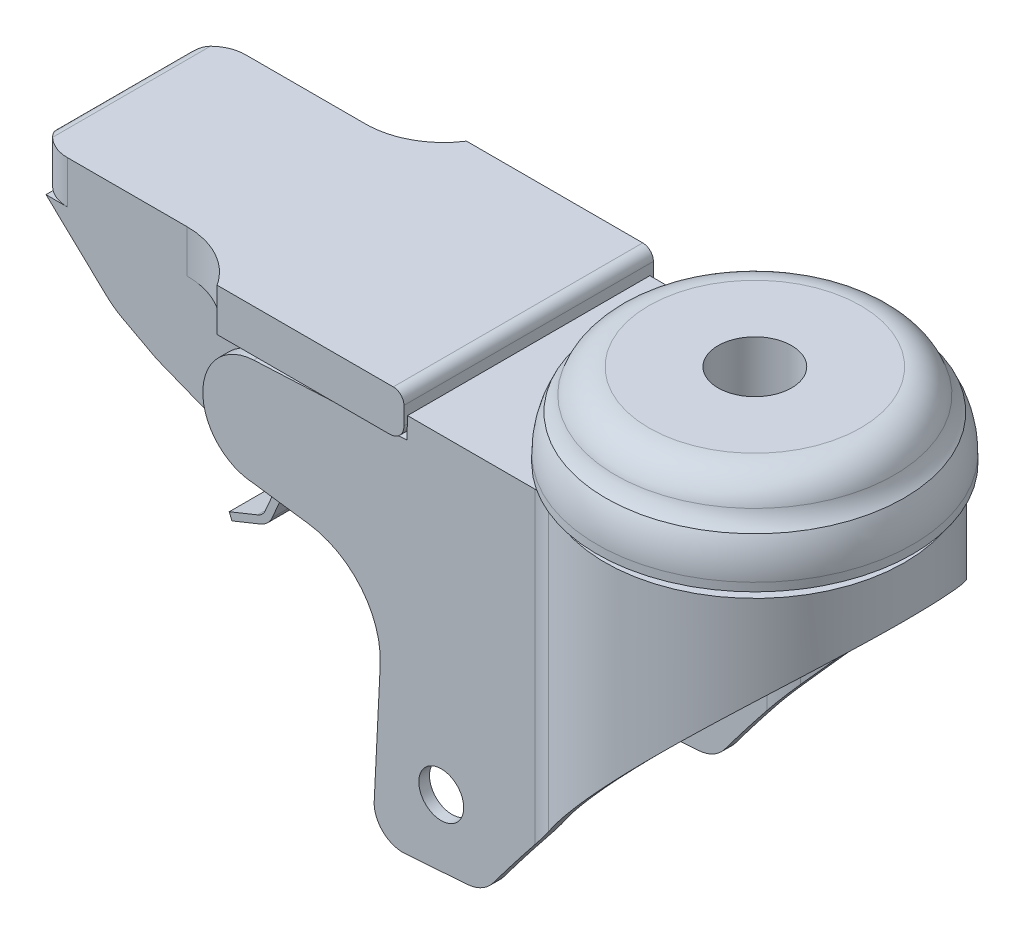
ISO-10303-21;
HEADER;
FILE_DESCRIPTION(('STEP AP214'),'2;1');
FILE_NAME('part.step','',(''),(''),'','','');
FILE_SCHEMA(('AUTOMOTIVE_DESIGN { 1 0 10303 214 1 1 1 1 }'));
ENDSEC;
DATA;
#1=APPLICATION_CONTEXT('core data for automotive mechanical design processes');
#2=APPLICATION_PROTOCOL_DEFINITION('international standard','automotive_design',2000,#1);
#3=PRODUCT_CONTEXT('',#1,'mechanical');
#4=PRODUCT('Part','Part','',(#3));
#5=PRODUCT_RELATED_PRODUCT_CATEGORY('part','',(#4));
#6=PRODUCT_DEFINITION_FORMATION('','',#4);
#7=PRODUCT_DEFINITION_CONTEXT('part definition',#1,'design');
#8=PRODUCT_DEFINITION('design','',#6,#7);
#9=PRODUCT_DEFINITION_SHAPE('','',#8);
#10=(LENGTH_UNIT() NAMED_UNIT(*) SI_UNIT(.MILLI.,.METRE.));
#11=(NAMED_UNIT(*) PLANE_ANGLE_UNIT() SI_UNIT($,.RADIAN.));
#12=(NAMED_UNIT(*) SI_UNIT($,.STERADIAN.) SOLID_ANGLE_UNIT());
#13=UNCERTAINTY_MEASURE_WITH_UNIT(LENGTH_MEASURE(1.E-05),#10,'distance_accuracy_value','');
#14=(GEOMETRIC_REPRESENTATION_CONTEXT(3) GLOBAL_UNCERTAINTY_ASSIGNED_CONTEXT((#13)) GLOBAL_UNIT_ASSIGNED_CONTEXT((#10,
#11,#12)) REPRESENTATION_CONTEXT('',''));
#15=CARTESIAN_POINT('',(0.,0.,0.));
#16=DIRECTION('',(0.,0.,1.));
#17=DIRECTION('',(1.,0.,0.));
#18=AXIS2_PLACEMENT_3D('',#15,#16,#17);
#19=CARTESIAN_POINT('',(-61.246318,-41.989232,-12.5));
#20=DIRECTION('',(-0.927280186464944,-0.374368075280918,0.));
#21=DIRECTION('',(0.374368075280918,-0.927280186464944,0.));
#22=AXIS2_PLACEMENT_3D('',#19,#20,#21);
#23=PLANE('',#22);
#24=DIRECTION('',(0.,0.,1.));
#25=VECTOR('',#24,1.);
#26=CARTESIAN_POINT('',(-61.2463180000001,-41.9892319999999,-12.5));
#27=LINE('',#26,#25);
#28=CARTESIAN_POINT('',(-61.246318,-41.989232,-12.5));
#29=VERTEX_POINT('',#28);
#30=CARTESIAN_POINT('',(-61.246318,-41.989232,12.5));
#31=VERTEX_POINT('',#30);
#32=EDGE_CURVE('E1614',#29,#31,#27,.T.);
#33=ORIENTED_EDGE('',*,*,#32,.F.);
#34=DIRECTION('',(0.374368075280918,-0.927280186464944,0.));
#35=VECTOR('',#34,1.);
#36=CARTESIAN_POINT('',(-61.246318,-41.989232,-12.5));
#37=LINE('',#36,#35);
#38=CARTESIAN_POINT('',(-60.87195,-42.916512,-12.5));
#39=VERTEX_POINT('',#38);
#40=EDGE_CURVE('E1608',#29,#39,#37,.T.);
#41=ORIENTED_EDGE('',*,*,#40,.T.);
#42=DIRECTION('',(0.,0.,1.));
#43=VECTOR('',#42,1.);
#44=CARTESIAN_POINT('',(-60.87195,-42.916512,-12.5));
#45=LINE('',#44,#43);
#46=CARTESIAN_POINT('',(-60.87195,-42.916512,12.5));
#47=VERTEX_POINT('',#46);
#48=EDGE_CURVE('E2286',#47,#39,#45,.F.);
#49=ORIENTED_EDGE('',*,*,#48,.F.);
#50=DIRECTION('',(0.374368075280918,-0.927280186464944,0.));
#51=VECTOR('',#50,1.);
#52=CARTESIAN_POINT('',(-61.246318,-41.989232,12.5));
#53=LINE('',#52,#51);
#54=EDGE_CURVE('E2302',#47,#31,#53,.F.);
#55=ORIENTED_EDGE('',*,*,#54,.T.);
#56=EDGE_LOOP('',(#33,#41,#49,#55));
#57=FACE_BOUND('',#56,.T.);
#58=ADVANCED_FACE('F16',(#57),#23,.T.);
#59=CARTESIAN_POINT('',(-58.01746916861,-38.52881123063,-12.5));
#60=DIRECTION('',(0.,0.,1.));
#61=DIRECTION('',(1.,0.,0.));
#62=AXIS2_PLACEMENT_3D('',#59,#60,#61);
#63=CYLINDRICAL_SURFACE('',#62,2.000000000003);
#64=CARTESIAN_POINT('',(-56.18015775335,-39.31892942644,12.5));
#65=CARTESIAN_POINT('',(-56.336516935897,-39.6825212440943,12.5));
#66=CARTESIAN_POINT('',(-56.6191950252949,-39.9587865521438,12.5));
#67=CARTESIAN_POINT('',(-56.9022362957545,-40.2354068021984,12.5));
#68=CARTESIAN_POINT('',(-57.2687322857,-40.38337130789,12.5));
#69=B_SPLINE_CURVE_WITH_KNOTS('',2,(#64,#65,#66,#67,#68),.UNSPECIFIED.,.F.,.F.,(3,2,3),(0.,0.5,
1.),.UNSPECIFIED.);
#70=CARTESIAN_POINT('',(-56.1801577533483,-39.3189294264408,12.5));
#71=VERTEX_POINT('',#70);
#72=CARTESIAN_POINT('',(-57.2687322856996,-40.3833713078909,12.5));
#73=VERTEX_POINT('',#72);
#74=EDGE_CURVE('E1607',#71,#73,#69,.T.);
#75=ORIENTED_EDGE('',*,*,#74,.F.);
#76=DIRECTION('',(0.,0.,1.));
#77=VECTOR('',#76,1.);
#78=CARTESIAN_POINT('',(-56.180157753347,-39.3189294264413,-12.5));
#79=LINE('',#78,#77);
#80=CARTESIAN_POINT('',(-56.1801577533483,-39.3189294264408,-12.5));
#81=VERTEX_POINT('',#80);
#82=EDGE_CURVE('E1602',#81,#71,#79,.T.);
#83=ORIENTED_EDGE('',*,*,#82,.F.);
#84=CARTESIAN_POINT('',(-57.2687322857,-40.38337130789,-12.5));
#85=CARTESIAN_POINT('',(-56.9017270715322,-40.2352012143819,-12.5));
#86=CARTESIAN_POINT('',(-56.6191950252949,-39.9587865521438,-12.5));
#87=CARTESIAN_POINT('',(-56.3362999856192,-39.6820167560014,-12.5));
#88=CARTESIAN_POINT('',(-56.18015775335,-39.31892942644,-12.5));
#89=B_SPLINE_CURVE_WITH_KNOTS('',2,(#84,#85,#86,#87,#88),.UNSPECIFIED.,.F.,.F.,(3,2,3),(0.,0.5,
1.),.UNSPECIFIED.);
#90=CARTESIAN_POINT('',(-57.2687322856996,-40.3833713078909,-12.5));
#91=VERTEX_POINT('',#90);
#92=EDGE_CURVE('E1597',#91,#81,#89,.T.);
#93=ORIENTED_EDGE('',*,*,#92,.F.);
#94=DIRECTION('',(0.,0.,1.));
#95=VECTOR('',#94,1.);
#96=CARTESIAN_POINT('',(-57.2687322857,-40.38337130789,-12.5));
#97=LINE('',#96,#95);
#98=EDGE_CURVE('E1599',#73,#91,#97,.F.);
#99=ORIENTED_EDGE('',*,*,#98,.F.);
#100=EDGE_LOOP('',(#75,#83,#93,#99));
#101=FACE_BOUND('',#100,.T.);
#102=ADVANCED_FACE('F1555',(#101),#63,.F.);
#103=CARTESIAN_POINT('',(-55.53167680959,-33.74330086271,-12.5));
#104=DIRECTION('',(0.,0.,1.));
#105=DIRECTION('',(1.,0.,0.));
#106=AXIS2_PLACEMENT_3D('',#103,#104,#105);
#107=CYLINDRICAL_SURFACE('',#106,1.);
#108=DIRECTION('',(0.,0.,1.));
#109=VECTOR('',#108,1.);
#110=CARTESIAN_POINT('',(-55.8999494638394,-34.6730186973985,-12.5));
#111=LINE('',#110,#109);
#112=CARTESIAN_POINT('',(-55.8999494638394,-34.6730186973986,-12.5));
#113=VERTEX_POINT('',#112);
#114=CARTESIAN_POINT('',(-55.8999494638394,-34.6730186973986,12.5));
#115=VERTEX_POINT('',#114);
#116=EDGE_CURVE('E1974',#113,#115,#111,.T.);
#117=ORIENTED_EDGE('',*,*,#116,.F.);
#118=CARTESIAN_POINT('',(-55.53167680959,-33.74330086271,-12.5));
#119=DIRECTION('',(0.,0.,1.));
#120=DIRECTION('',(-0.368272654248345,-0.929717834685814,0.));
#121=AXIS2_PLACEMENT_3D('',#118,#119,#120);
#122=CIRCLE('',#121,1.);
#123=CARTESIAN_POINT('',(-54.894283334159,-34.5138393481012,-12.5));
#124=VERTEX_POINT('',#123);
#125=EDGE_CURVE('E1793',#113,#124,#122,.T.);
#126=ORIENTED_EDGE('',*,*,#125,.T.);
#127=DIRECTION('',(0.,0.,1.));
#128=VECTOR('',#127,1.);
#129=CARTESIAN_POINT('',(-54.89428333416,-34.5138393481,-12.5));
#130=LINE('',#129,#128);
#131=CARTESIAN_POINT('',(-54.894283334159,-34.5138393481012,12.5));
#132=VERTEX_POINT('',#131);
#133=EDGE_CURVE('E1971',#132,#124,#130,.F.);
#134=ORIENTED_EDGE('',*,*,#133,.F.);
#135=CARTESIAN_POINT('',(-55.53167680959,-33.74330086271,12.5));
#136=DIRECTION('',(0.,0.,-1.));
#137=DIRECTION('',(0.637393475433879,-0.770538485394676,0.));
#138=AXIS2_PLACEMENT_3D('',#135,#136,#137);
#139=CIRCLE('',#138,1.);
#140=EDGE_CURVE('E1804',#132,#115,#139,.T.);
#141=ORIENTED_EDGE('',*,*,#140,.T.);
#142=EDGE_LOOP('',(#117,#126,#134,#141));
#143=FACE_BOUND('',#142,.T.);
#144=ADVANCED_FACE('F1545',(#143),#107,.T.);
#145=CARTESIAN_POINT('',(-67.24698565,-19.42236671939,-12.5));
#146=DIRECTION('',(0.,0.,1.));
#147=DIRECTION('',(1.,0.,0.));
#148=AXIS2_PLACEMENT_3D('',#145,#146,#147);
#149=CYLINDRICAL_SURFACE('',#148,10.00000000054);
#150=DIRECTION('',(0.,0.,1.));
#151=VECTOR('',#150,1.);
#152=CARTESIAN_POINT('',(-71.9528680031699,-28.2458961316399,-12.5));
#153=LINE('',#152,#151);
#154=CARTESIAN_POINT('',(-71.9528680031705,-28.2458961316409,-12.5));
#155=VERTEX_POINT('',#154);
#156=CARTESIAN_POINT('',(-71.9528680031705,-28.2458961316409,12.5));
#157=VERTEX_POINT('',#156);
#158=EDGE_CURVE('E2310',#155,#157,#153,.T.);
#159=ORIENTED_EDGE('',*,*,#158,.F.);
#160=CARTESIAN_POINT('',(-67.24698565,-19.42236671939,-12.5));
#161=DIRECTION('',(0.,0.,1.));
#162=DIRECTION('',(-0.470588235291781,-0.882352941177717,0.));
#163=AXIS2_PLACEMENT_3D('',#160,#161,#162);
#164=CIRCLE('',#163,10.00000000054);
#165=CARTESIAN_POINT('',(-70.9297121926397,-28.7195450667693,-12.5));
#166=VERTEX_POINT('',#165);
#167=EDGE_CURVE('E2132',#155,#166,#164,.T.);
#168=ORIENTED_EDGE('',*,*,#167,.T.);
#169=DIRECTION('',(0.,0.,1.));
#170=VECTOR('',#169,1.);
#171=CARTESIAN_POINT('',(-70.92971219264,-28.71954506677,-12.5));
#172=LINE('',#171,#170);
#173=CARTESIAN_POINT('',(-70.9297121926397,-28.7195450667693,12.5));
#174=VERTEX_POINT('',#173);
#175=EDGE_CURVE('E1976',#174,#166,#172,.F.);
#176=ORIENTED_EDGE('',*,*,#175,.F.);
#177=CARTESIAN_POINT('',(-67.24698565,-19.42236671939,12.5));
#178=DIRECTION('',(0.,0.,-1.));
#179=DIRECTION('',(-0.368272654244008,-0.929717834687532,0.));
#180=AXIS2_PLACEMENT_3D('',#177,#178,#179);
#181=CIRCLE('',#180,10.00000000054);
#182=EDGE_CURVE('E1946',#174,#157,#181,.T.);
#183=ORIENTED_EDGE('',*,*,#182,.T.);
#184=EDGE_LOOP('',(#159,#168,#176,#183));
#185=FACE_BOUND('',#184,.T.);
#186=ADVANCED_FACE('F1535',(#185),#149,.T.);
#187=CARTESIAN_POINT('',(0.,-1.840472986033,0.));
#188=DIRECTION('',(0.,-1.,0.));
#189=DIRECTION('',(-1.,0.,0.));
#190=AXIS2_PLACEMENT_3D('',#187,#188,#189);
#191=TOROIDAL_SURFACE('',#190,24.24803124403,4.941303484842);
#192=CARTESIAN_POINT('',(0.,-5.49977739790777,-4.56297326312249E-12));
#193=DIRECTION('',(0.,-1.,0.));
#194=DIRECTION('',(1.,0.,0.));
#195=AXIS2_PLACEMENT_3D('',#192,#193,#194);
#196=CIRCLE('',#195,20.927493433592);
#197=CARTESIAN_POINT('',(20.927493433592,-5.49977739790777,-4.56297326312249E-12));
#198=VERTEX_POINT('',#197);
#199=EDGE_CURVE('E1724',#198,#198,#196,.T.);
#200=ORIENTED_EDGE('',*,*,#199,.F.);
#201=EDGE_LOOP('',(#200));
#202=FACE_BOUND('',#201,.T.);
#203=CARTESIAN_POINT('',(0.,-3.39088823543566,0.));
#204=DIRECTION('',(0.,-1.,0.));
#205=DIRECTION('',(-1.,0.,0.));
#206=AXIS2_PLACEMENT_3D('',#203,#204,#205);
#207=CIRCLE('',#206,19.556262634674);
#208=CARTESIAN_POINT('',(-19.556262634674,-3.39088823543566,0.));
#209=VERTEX_POINT('',#208);
#210=EDGE_CURVE('E1766',#209,#209,#207,.F.);
#211=ORIENTED_EDGE('',*,*,#210,.F.);
#212=EDGE_LOOP('',(#211));
#213=FACE_BOUND('',#212,.T.);
#214=ADVANCED_FACE('F1525',(#202,#213),#191,.F.);
#215=CARTESIAN_POINT('',(-33.954662,-16.311606,-12.5));
#216=DIRECTION('',(0.,1.,0.));
#217=DIRECTION('',(0.,0.,1.));
#218=AXIS2_PLACEMENT_3D('',#215,#216,#217);
#219=PLANE('',#218);
#220=DIRECTION('',(0.,0.,1.));
#221=VECTOR('',#220,1.);
#222=CARTESIAN_POINT('',(-86.954662,-16.311606,-12.5));
#223=LINE('',#222,#221);
#224=CARTESIAN_POINT('',(-86.954662,-16.311606,-11.4999999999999));
#225=VERTEX_POINT('',#224);
#226=CARTESIAN_POINT('',(-86.954662,-16.311606,-12.5));
#227=VERTEX_POINT('',#226);
#228=EDGE_CURVE('E1731',#225,#227,#223,.F.);
#229=ORIENTED_EDGE('',*,*,#228,.F.);
#230=CARTESIAN_POINT('',(-83.954662,-16.311606,-7.500000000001));
#231=DIRECTION('',(0.,1.,0.));
#232=DIRECTION('',(0.,0.,-1.));
#233=AXIS2_PLACEMENT_3D('',#230,#231,#232);
#234=CIRCLE('',#233,4.999999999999);
#235=CARTESIAN_POINT('',(-83.954662,-16.311606,-12.5));
#236=VERTEX_POINT('',#235);
#237=EDGE_CURVE('E2138',#236,#225,#234,.T.);
#238=ORIENTED_EDGE('',*,*,#237,.F.);
#239=DIRECTION('',(1.,0.,0.));
#240=VECTOR('',#239,1.);
#241=CARTESIAN_POINT('',(-83.954662,-16.311606,-12.5));
#242=LINE('',#241,#240);
#243=EDGE_CURVE('E1651',#236,#227,#242,.F.);
#244=ORIENTED_EDGE('',*,*,#243,.T.);
#245=EDGE_LOOP('',(#229,#238,#244));
#246=FACE_BOUND('',#245,.T.);
#247=ADVANCED_FACE('F1515',(#246),#219,.T.);
#248=CARTESIAN_POINT('',(-88.954662,-11.811606,-17.5));
#249=DIRECTION('',(-1.,0.,0.));
#250=DIRECTION('',(0.,0.,1.));
#251=AXIS2_PLACEMENT_3D('',#248,#249,#250);
#252=PLANE('',#251);
#253=DIRECTION('',(0.,0.,1.));
#254=VECTOR('',#253,1.);
#255=CARTESIAN_POINT('',(-88.954662,-14.311606,-17.5));
#256=LINE('',#255,#254);
#257=CARTESIAN_POINT('',(-88.9546619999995,-14.311606,7.500000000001));
#258=VERTEX_POINT('',#257);
#259=CARTESIAN_POINT('',(-88.9546619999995,-14.311606,-7.500000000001));
#260=VERTEX_POINT('',#259);
#261=EDGE_CURVE('E2124',#258,#260,#256,.F.);
#262=ORIENTED_EDGE('',*,*,#261,.F.);
#263=DIRECTION('',(0.,1.,0.));
#264=VECTOR('',#263,1.);
#265=CARTESIAN_POINT('',(-88.954661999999,0.,7.500000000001));
#266=LINE('',#265,#264);
#267=CARTESIAN_POINT('',(-88.954661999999,-11.811606,7.500000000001));
#268=VERTEX_POINT('',#267);
#269=EDGE_CURVE('E2717',#268,#258,#266,.F.);
#270=ORIENTED_EDGE('',*,*,#269,.F.);
#271=DIRECTION('',(0.,0.,1.));
#272=VECTOR('',#271,1.);
#273=CARTESIAN_POINT('',(-88.954661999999,-11.81160593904,-17.5));
#274=LINE('',#273,#272);
#275=CARTESIAN_POINT('',(-88.954661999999,-11.81160593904,-7.500000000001));
#276=VERTEX_POINT('',#275);
#277=EDGE_CURVE('E2714',#276,#268,#274,.T.);
#278=ORIENTED_EDGE('',*,*,#277,.F.);
#279=DIRECTION('',(0.,1.,0.));
#280=VECTOR('',#279,1.);
#281=CARTESIAN_POINT('',(-88.954661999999,0.,-7.500000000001));
#282=LINE('',#281,#280);
#283=EDGE_CURVE('E2186',#260,#276,#282,.T.);
#284=ORIENTED_EDGE('',*,*,#283,.F.);
#285=EDGE_LOOP('',(#262,#270,#278,#284));
#286=FACE_BOUND('',#285,.T.);
#287=ADVANCED_FACE('F1505',(#286),#252,.T.);
#288=CARTESIAN_POINT('',(-86.954662,-14.311606,-17.5));
#289=DIRECTION('',(0.,0.,1.));
#290=DIRECTION('',(1.,0.,0.));
#291=AXIS2_PLACEMENT_3D('',#288,#289,#290);
#292=CYLINDRICAL_SURFACE('',#291,2.);
#293=CARTESIAN_POINT('',(-86.9546619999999,-16.311606,-11.4999999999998));
#294=CARTESIAN_POINT('',(-86.9938388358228,-16.3116057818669,-11.4706198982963));
#295=CARTESIAN_POINT('',(-87.0325756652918,-16.3104545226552,-11.4406656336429));
#296=CARTESIAN_POINT('',(-87.1099797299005,-16.3059494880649,-11.3789780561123));
#297=CARTESIAN_POINT('',(-87.1486238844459,-16.3025445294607,-11.3472194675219));
#298=CARTESIAN_POINT('',(-87.2257477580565,-16.2935343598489,-11.2818801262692));
#299=CARTESIAN_POINT('',(-87.2641994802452,-16.2878765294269,-11.2482736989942));
#300=CARTESIAN_POINT('',(-87.3408450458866,-16.2743616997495,-11.1791974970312));
#301=CARTESIAN_POINT('',(-87.3790062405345,-16.2664513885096,-11.1437019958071));
#302=CARTESIAN_POINT('',(-87.4549706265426,-16.2484320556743,-11.0708100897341));
#303=CARTESIAN_POINT('',(-87.4927366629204,-16.2382696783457,-11.0333882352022));
#304=CARTESIAN_POINT('',(-87.567806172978,-16.215746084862,-10.9566097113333));
#305=CARTESIAN_POINT('',(-87.6050682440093,-16.2033320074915,-10.9172281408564));
#306=CARTESIAN_POINT('',(-87.6790199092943,-16.1763042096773,-10.8365009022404));
#307=CARTESIAN_POINT('',(-87.7156641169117,-16.161638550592,-10.7951311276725));
#308=CARTESIAN_POINT('',(-87.7882662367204,-16.1301071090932,-10.7104016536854));
#309=CARTESIAN_POINT('',(-87.8241750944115,-16.1131906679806,-10.667018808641));
#310=CARTESIAN_POINT('',(-87.887846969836,-16.0808776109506,-10.5874200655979));
#311=CARTESIAN_POINT('',(-87.9159079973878,-16.0657600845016,-10.551328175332));
#312=CARTESIAN_POINT('',(-87.9716217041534,-16.0340316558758,-10.4776216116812));
#313=CARTESIAN_POINT('',(-87.9992387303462,-16.0173900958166,-10.4399931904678));
#314=CARTESIAN_POINT('',(-88.0539790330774,-15.9826131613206,-10.3631952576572));
#315=CARTESIAN_POINT('',(-88.0810652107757,-15.9644485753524,-10.3240125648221));
#316=CARTESIAN_POINT('',(-88.1346556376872,-15.9266239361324,-10.2440906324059));
#317=CARTESIAN_POINT('',(-88.1611214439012,-15.9069360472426,-10.2033388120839));
#318=CARTESIAN_POINT('',(-88.2133796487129,-15.866063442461,-10.1202669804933));
#319=CARTESIAN_POINT('',(-88.2391323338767,-15.8448522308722,-10.0779350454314));
#320=CARTESIAN_POINT('',(-88.2898698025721,-15.8009319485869,-9.99169518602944));
#321=CARTESIAN_POINT('',(-88.314813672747,-15.7781976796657,-9.94777604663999));
#322=CARTESIAN_POINT('',(-88.3638359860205,-15.7312288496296,-9.8583585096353));
#323=CARTESIAN_POINT('',(-88.3878723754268,-15.7069702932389,-9.81284967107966));
#324=CARTESIAN_POINT('',(-88.4349796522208,-15.6569562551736,-9.72025301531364));
#325=CARTESIAN_POINT('',(-88.4580074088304,-15.6311780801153,-9.673155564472));
#326=CARTESIAN_POINT('',(-88.5164179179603,-15.5622687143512,-9.54881379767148));
#327=CARTESIAN_POINT('',(-88.5504272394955,-15.5184522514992,-9.4713003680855));
#328=CARTESIAN_POINT('',(-88.6166064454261,-15.4256572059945,-9.30955308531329));
#329=CARTESIAN_POINT('',(-88.6484353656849,-15.3765404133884,-9.22525963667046));
#330=CARTESIAN_POINT('',(-88.7093529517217,-15.2731146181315,-9.04988365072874));
#331=CARTESIAN_POINT('',(-88.7380821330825,-15.2186856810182,-8.9587472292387));
#332=CARTESIAN_POINT('',(-88.7918368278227,-15.1046704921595,-8.7696574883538));
#333=CARTESIAN_POINT('',(-88.8164842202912,-15.044983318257,-8.67165727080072));
#334=CARTESIAN_POINT('',(-88.852592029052,-14.9438120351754,-8.50740463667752));
#335=CARTESIAN_POINT('',(-88.8657290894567,-14.9027576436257,-8.44124949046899));
#336=CARTESIAN_POINT('',(-88.8919895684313,-14.8107105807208,-8.29350155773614));
#337=CARTESIAN_POINT('',(-88.9044157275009,-14.7596026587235,-8.21185567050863));
#338=CARTESIAN_POINT('',(-88.9271369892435,-14.6474445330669,-8.032979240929));
#339=CARTESIAN_POINT('',(-88.9365995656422,-14.5863216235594,-7.93568831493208));
#340=CARTESIAN_POINT('',(-88.9508475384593,-14.4540770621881,-7.72559497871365));
#341=CARTESIAN_POINT('',(-88.9546616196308,-14.3828967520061,-7.61276279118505));
#342=CARTESIAN_POINT('',(-88.954661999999,-14.311606,-7.500000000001));
#343=B_SPLINE_CURVE_WITH_KNOTS('',3,(#293,#294,#295,#296,#297,#298,#299,#300,#301,#302,#303,
#304,#305,#306,#307,#308,#309,#310,#311,#312,#313,#314,#315,#316,#317,#318,#319,#320,#321,#322,
#323,#324,#325,#326,#327,#328,#329,#330,#331,#332,#333,#334,#335,#336,#337,#338,#339,#340,#341,
#342),.UNSPECIFIED.,.F.,.F.,(4,2,2,2,2,2,2,2,2,2,2,2,2,2,2,2,2,2,2,2,2,2,2,2,4),(0.,
0.146878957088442,0.297213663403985,0.451287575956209,0.609364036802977,0.771686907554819,
0.938481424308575,1.10995520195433,1.2862993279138,1.43072599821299,1.57935603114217,
1.73226462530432,1.88952084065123,2.05118816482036,2.21732502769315,2.38798526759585,
2.56321855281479,2.84903116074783,3.15675774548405,3.48652216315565,3.83842486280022,
4.07525825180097,4.36653090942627,4.71224956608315,5.11241567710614),.UNSPECIFIED.);
#344=EDGE_CURVE('E2119',#225,#260,#343,.T.);
#345=ORIENTED_EDGE('',*,*,#344,.F.);
#346=DIRECTION('',(0.,0.,1.));
#347=VECTOR('',#346,1.);
#348=CARTESIAN_POINT('',(-86.954662,-16.311606,-12.5));
#349=LINE('',#348,#347);
#350=CARTESIAN_POINT('',(-86.954662,-16.311606,11.4999999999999));
#351=VERTEX_POINT('',#350);
#352=EDGE_CURVE('E1725',#351,#225,#349,.F.);
#353=ORIENTED_EDGE('',*,*,#352,.F.);
#354=CARTESIAN_POINT('',(-88.954661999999,-14.311606,7.500000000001));
#355=CARTESIAN_POINT('',(-88.9546616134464,-14.3831419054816,7.61315087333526));
#356=CARTESIAN_POINT('',(-88.9508212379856,-14.4545662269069,7.72637188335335));
#357=CARTESIAN_POINT('',(-88.9364747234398,-14.5872620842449,7.93718926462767));
#358=CARTESIAN_POINT('',(-88.9269465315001,-14.6485928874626,8.03481571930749));
#359=CARTESIAN_POINT('',(-88.9040672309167,-14.7611303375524,8.21430818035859));
#360=CARTESIAN_POINT('',(-88.8915543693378,-14.8124104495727,8.29623519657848));
#361=CARTESIAN_POINT('',(-88.8651098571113,-14.9047647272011,8.44449183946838));
#362=CARTESIAN_POINT('',(-88.8518803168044,-14.9459553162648,8.51087515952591));
#363=CARTESIAN_POINT('',(-88.8154989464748,-15.0475071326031,8.67577653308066));
#364=CARTESIAN_POINT('',(-88.7906529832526,-15.1074326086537,8.77419591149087));
#365=CARTESIAN_POINT('',(-88.7364605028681,-15.22188402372,8.96408193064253));
#366=CARTESIAN_POINT('',(-88.7074959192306,-15.2765123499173,9.05559612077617));
#367=CARTESIAN_POINT('',(-88.6460761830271,-15.3802957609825,9.23168539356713));
#368=CARTESIAN_POINT('',(-88.6139841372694,-15.4295725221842,9.3163151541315));
#369=CARTESIAN_POINT('',(-88.5472560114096,-15.5226464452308,9.47869334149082));
#370=CARTESIAN_POINT('',(-88.5129643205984,-15.5665838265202,9.55650228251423));
#371=CARTESIAN_POINT('',(-88.454210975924,-15.6354928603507,9.68100286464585));
#372=CARTESIAN_POINT('',(-88.4311460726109,-15.6611649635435,9.72796980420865));
#373=CARTESIAN_POINT('',(-88.3839692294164,-15.7109712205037,9.82031373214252));
#374=CARTESIAN_POINT('',(-88.3599000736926,-15.7351280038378,9.86570032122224));
#375=CARTESIAN_POINT('',(-88.310816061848,-15.7818977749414,9.95488156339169));
#376=CARTESIAN_POINT('',(-88.2858429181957,-15.8045346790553,9.99868662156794));
#377=CARTESIAN_POINT('',(-88.2350498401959,-15.848264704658,10.0847064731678));
#378=CARTESIAN_POINT('',(-88.209270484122,-15.8693829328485,10.1269324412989));
#379=CARTESIAN_POINT('',(-88.1569610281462,-15.9100740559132,10.2098003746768));
#380=CARTESIAN_POINT('',(-88.1304703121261,-15.9296733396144,10.2504542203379));
#381=CARTESIAN_POINT('',(-88.0768313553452,-15.9673253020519,10.3301880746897));
#382=CARTESIAN_POINT('',(-88.0497212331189,-15.9854056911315,10.3692806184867));
#383=CARTESIAN_POINT('',(-87.994933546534,-16.0200186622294,10.4459059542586));
#384=CARTESIAN_POINT('',(-87.9672927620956,-16.036580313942,10.4834518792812));
#385=CARTESIAN_POINT('',(-87.9115313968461,-16.0681538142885,10.5570008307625));
#386=CARTESIAN_POINT('',(-87.8834461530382,-16.0831961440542,10.5930175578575));
#387=CARTESIAN_POINT('',(-87.8199032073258,-16.1152503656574,10.6722250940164));
#388=CARTESIAN_POINT('',(-87.7841575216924,-16.1319914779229,10.7152954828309));
#389=CARTESIAN_POINT('',(-87.71189293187,-16.1631960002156,10.799425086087));
#390=CARTESIAN_POINT('',(-87.675422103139,-16.1777092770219,10.8405070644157));
#391=CARTESIAN_POINT('',(-87.6018261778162,-16.204456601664,10.9206832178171));
#392=CARTESIAN_POINT('',(-87.5647455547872,-16.2167417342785,10.9598010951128));
#393=CARTESIAN_POINT('',(-87.4900456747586,-16.2390316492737,11.0360762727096));
#394=CARTESIAN_POINT('',(-87.452466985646,-16.2490883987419,11.0732580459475));
#395=CARTESIAN_POINT('',(-87.3768819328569,-16.266920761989,11.1456931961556));
#396=CARTESIAN_POINT('',(-87.3389119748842,-16.2747488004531,11.1809715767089));
#397=CARTESIAN_POINT('',(-87.2626515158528,-16.2881233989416,11.2496362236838));
#398=CARTESIAN_POINT('',(-87.2243930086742,-16.293722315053,11.2830477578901));
#399=CARTESIAN_POINT('',(-87.1476563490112,-16.3026389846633,11.3480191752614));
#400=CARTESIAN_POINT('',(-87.1092056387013,-16.3060083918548,11.3796042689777));
#401=CARTESIAN_POINT('',(-87.0321873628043,-16.3104666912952,11.4409658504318));
#402=CARTESIAN_POINT('',(-86.9936424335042,-16.3116058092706,11.4707671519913));
#403=CARTESIAN_POINT('',(-86.9546619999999,-16.311606,11.4999999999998));
#404=B_SPLINE_CURVE_WITH_KNOTS('',3,(#354,#355,#356,#357,#358,#359,#360,#361,#362,#363,#364,
#365,#366,#367,#368,#369,#370,#371,#372,#373,#374,#375,#376,#377,#378,#379,#380,#381,#382,#383,
#384,#385,#386,#387,#388,#389,#390,#391,#392,#393,#394,#395,#396,#397,#398,#399,#400,#401,#402,
#403),.UNSPECIFIED.,.F.,.F.,(4,2,2,2,2,2,2,2,2,2,2,2,2,2,2,2,2,2,2,2,2,2,2,2,4),(0.,
0.401542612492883,0.748456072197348,1.0407418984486,1.27840697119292,1.63184579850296,
1.96302793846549,2.27205608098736,2.5590568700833,2.7338784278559,2.90415701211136,
3.0699424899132,3.23128889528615,3.38825484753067,3.54090401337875,3.68930561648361,
3.83353499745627,4.00873851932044,4.1791380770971,4.34492250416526,4.5062968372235,
4.66348337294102,4.81672263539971,4.96627419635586,5.11241727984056),.UNSPECIFIED.);
#405=EDGE_CURVE('E2106',#258,#351,#404,.T.);
#406=ORIENTED_EDGE('',*,*,#405,.F.);
#407=ORIENTED_EDGE('',*,*,#261,.T.);
#408=EDGE_LOOP('',(#345,#353,#406,#407));
#409=FACE_BOUND('',#408,.T.);
#410=ADVANCED_FACE('F1495',(#409),#292,.T.);
#411=CARTESIAN_POINT('',(-36.954662,-17.12762007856,-12.5));
#412=DIRECTION('',(0.,0.,1.));
#413=DIRECTION('',(1.,0.,0.));
#414=AXIS2_PLACEMENT_3D('',#411,#412,#413);
#415=CYLINDRICAL_SURFACE('',#414,3.000000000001);
#416=DIRECTION('',(0.,0.,1.));
#417=VECTOR('',#416,1.);
#418=CARTESIAN_POINT('',(-35.0424815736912,-19.4392355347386,-12.5));
#419=LINE('',#418,#417);
#420=CARTESIAN_POINT('',(-35.0424815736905,-19.4392355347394,-12.5));
#421=VERTEX_POINT('',#420);
#422=CARTESIAN_POINT('',(-35.0424815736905,-19.4392355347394,12.5));
#423=VERTEX_POINT('',#422);
#424=EDGE_CURVE('E2131',#421,#423,#419,.T.);
#425=ORIENTED_EDGE('',*,*,#424,.F.);
#426=CARTESIAN_POINT('',(-36.954662,-17.12762007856,-12.5));
#427=DIRECTION('',(0.,0.,1.));
#428=DIRECTION('',(0.637393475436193,-0.770538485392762,0.));
#429=AXIS2_PLACEMENT_3D('',#426,#427,#428);
#430=CIRCLE('',#429,3.000000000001);
#431=CARTESIAN_POINT('',(-33.9546619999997,-17.12762007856,-12.5));
#432=VERTEX_POINT('',#431);
#433=EDGE_CURVE('E2261',#421,#432,#430,.T.);
#434=ORIENTED_EDGE('',*,*,#433,.T.);
#435=DIRECTION('',(0.,0.,-1.));
#436=VECTOR('',#435,1.);
#437=CARTESIAN_POINT('',(-33.954662,-17.12762007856,-12.5));
#438=LINE('',#437,#436);
#439=CARTESIAN_POINT('',(-33.9546619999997,-17.12762007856,12.5));
#440=VERTEX_POINT('',#439);
#441=EDGE_CURVE('E1769',#440,#432,#438,.T.);
#442=ORIENTED_EDGE('',*,*,#441,.F.);
#443=CARTESIAN_POINT('',(-36.954662,-17.12762007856,12.5));
#444=DIRECTION('',(0.,0.,-1.));
#445=DIRECTION('',(1.,0.,0.));
#446=AXIS2_PLACEMENT_3D('',#443,#444,#445);
#447=CIRCLE('',#446,3.000000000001);
#448=EDGE_CURVE('E1848',#440,#423,#447,.T.);
#449=ORIENTED_EDGE('',*,*,#448,.T.);
#450=EDGE_LOOP('',(#425,#434,#442,#449));
#451=FACE_BOUND('',#450,.T.);
#452=ADVANCED_FACE('F1485',(#451),#415,.T.);
#453=CARTESIAN_POINT('',(-51.79249324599,-33.29493301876,-12.5));
#454=DIRECTION('',(0.63739347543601,-0.770538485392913,0.));
#455=DIRECTION('',(0.770538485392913,0.63739347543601,0.));
#456=AXIS2_PLACEMENT_3D('',#453,#454,#455);
#457=PLANE('',#456);
#458=DIRECTION('',(0.,0.,1.));
#459=VECTOR('',#458,1.);
#460=CARTESIAN_POINT('',(-51.7924932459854,-33.2949330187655,-12.5));
#461=LINE('',#460,#459);
#462=CARTESIAN_POINT('',(-51.7924932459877,-33.2949330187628,12.5));
#463=VERTEX_POINT('',#462);
#464=CARTESIAN_POINT('',(-51.7924932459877,-33.2949330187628,-12.5));
#465=VERTEX_POINT('',#464);
#466=EDGE_CURVE('E2039',#463,#465,#461,.F.);
#467=ORIENTED_EDGE('',*,*,#466,.T.);
#468=DIRECTION('',(0.770538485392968,0.637393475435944,0.));
#469=VECTOR('',#468,1.);
#470=CARTESIAN_POINT('',(-51.79249324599,-33.29493301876,-12.5));
#471=LINE('',#470,#469);
#472=EDGE_CURVE('E2274',#465,#421,#471,.T.);
#473=ORIENTED_EDGE('',*,*,#472,.T.);
#474=ORIENTED_EDGE('',*,*,#424,.T.);
#475=DIRECTION('',(-0.770538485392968,-0.637393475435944,0.));
#476=VECTOR('',#475,1.);
#477=CARTESIAN_POINT('',(-35.04248157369,-19.43923553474,12.5));
#478=LINE('',#477,#476);
#479=EDGE_CURVE('E1846',#423,#463,#478,.T.);
#480=ORIENTED_EDGE('',*,*,#479,.T.);
#481=EDGE_LOOP('',(#467,#473,#474,#480));
#482=FACE_BOUND('',#481,.T.);
#483=ADVANCED_FACE('F1475',(#482),#457,.T.);
#484=CARTESIAN_POINT('',(-48.22308978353,-37.60994853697,-12.5));
#485=DIRECTION('',(0.,0.,1.));
#486=DIRECTION('',(1.,0.,0.));
#487=AXIS2_PLACEMENT_3D('',#484,#485,#486);
#488=CYLINDRICAL_SURFACE('',#487,5.600000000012);
#489=CARTESIAN_POINT('',(-48.22308978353,-37.60994853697,12.5));
#490=DIRECTION('',(0.,0.,1.));
#491=DIRECTION('',(-0.637393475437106,0.770538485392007,0.));
#492=AXIS2_PLACEMENT_3D('',#489,#490,#491);
#493=CIRCLE('',#492,5.600000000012);
#494=CARTESIAN_POINT('',(-53.3675617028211,-35.3976174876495,12.5));
#495=VERTEX_POINT('',#494);
#496=EDGE_CURVE('E1843',#463,#495,#493,.T.);
#497=ORIENTED_EDGE('',*,*,#496,.T.);
#498=DIRECTION('',(0.,0.,1.));
#499=VECTOR('',#498,1.);
#500=CARTESIAN_POINT('',(-53.3675617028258,-35.3976174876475,-12.5));
#501=LINE('',#500,#499);
#502=CARTESIAN_POINT('',(-53.3675617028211,-35.3976174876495,-12.5));
#503=VERTEX_POINT('',#502);
#504=EDGE_CURVE('E2034',#503,#495,#501,.T.);
#505=ORIENTED_EDGE('',*,*,#504,.F.);
#506=CARTESIAN_POINT('',(-48.22308978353,-37.60994853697,-12.5));
#507=DIRECTION('',(0.,0.,-1.));
#508=DIRECTION('',(-0.918655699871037,0.395059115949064,0.));
#509=AXIS2_PLACEMENT_3D('',#506,#507,#508);
#510=CIRCLE('',#509,5.600000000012);
#511=EDGE_CURVE('E2066',#503,#465,#510,.T.);
#512=ORIENTED_EDGE('',*,*,#511,.T.);
#513=ORIENTED_EDGE('',*,*,#466,.F.);
#514=EDGE_LOOP('',(#497,#505,#512,#513));
#515=FACE_BOUND('',#514,.T.);
#516=ADVANCED_FACE('F1465',(#515),#488,.F.);
#517=CARTESIAN_POINT('',(-55.2158495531,-39.69555696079,-12.5));
#518=DIRECTION('',(0.918655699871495,-0.395059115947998,0.));
#519=DIRECTION('',(0.395059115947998,0.918655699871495,0.));
#520=AXIS2_PLACEMENT_3D('',#517,#518,#519);
#521=PLANE('',#520);
#522=DIRECTION('',(0.,0.,1.));
#523=VECTOR('',#522,1.);
#524=CARTESIAN_POINT('',(-55.2158495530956,-39.6955569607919,-12.5));
#525=LINE('',#524,#523);
#526=CARTESIAN_POINT('',(-55.2158495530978,-39.6955569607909,-12.5));
#527=VERTEX_POINT('',#526);
#528=CARTESIAN_POINT('',(-55.2158495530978,-39.6955569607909,12.5));
#529=VERTEX_POINT('',#528);
#530=EDGE_CURVE('E2025',#527,#529,#525,.T.);
#531=ORIENTED_EDGE('',*,*,#530,.F.);
#532=DIRECTION('',(0.395059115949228,0.918655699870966,0.));
#533=VECTOR('',#532,1.);
#534=CARTESIAN_POINT('',(-55.2158495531,-39.69555696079,-12.5));
#535=LINE('',#534,#533);
#536=EDGE_CURVE('E2279',#527,#503,#535,.T.);
#537=ORIENTED_EDGE('',*,*,#536,.T.);
#538=ORIENTED_EDGE('',*,*,#504,.T.);
#539=DIRECTION('',(-0.395059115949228,-0.918655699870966,0.));
#540=VECTOR('',#539,1.);
#541=CARTESIAN_POINT('',(-53.36756170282,-35.39761748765,12.5));
#542=LINE('',#541,#540);
#543=EDGE_CURVE('E1841',#495,#529,#542,.T.);
#544=ORIENTED_EDGE('',*,*,#543,.T.);
#545=EDGE_LOOP('',(#531,#537,#538,#544));
#546=FACE_BOUND('',#545,.T.);
#547=ADVANCED_FACE('F1455',(#546),#521,.T.);
#548=CARTESIAN_POINT('',(-57.97181665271,-38.51037961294,-12.5));
#549=DIRECTION('',(0.,0.,1.));
#550=DIRECTION('',(1.,0.,0.));
#551=AXIS2_PLACEMENT_3D('',#548,#549,#550);
#552=CYLINDRICAL_SURFACE('',#551,3.000000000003);
#553=DIRECTION('',(0.,0.,1.));
#554=VECTOR('',#553,1.);
#555=CARTESIAN_POINT('',(-56.8487111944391,-41.2922196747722,-12.5));
#556=LINE('',#555,#554);
#557=CARTESIAN_POINT('',(-56.8487111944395,-41.2922196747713,-12.5));
#558=VERTEX_POINT('',#557);
#559=CARTESIAN_POINT('',(-56.8487111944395,-41.2922196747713,12.5));
#560=VERTEX_POINT('',#559);
#561=EDGE_CURVE('E2033',#558,#560,#556,.T.);
#562=ORIENTED_EDGE('',*,*,#561,.F.);
#563=CARTESIAN_POINT('',(-57.97181665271,-38.51037961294,-12.5));
#564=DIRECTION('',(0.,0.,1.));
#565=DIRECTION('',(0.374368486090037,-0.927280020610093,0.));
#566=AXIS2_PLACEMENT_3D('',#563,#564,#565);
#567=CIRCLE('',#566,3.000000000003);
#568=EDGE_CURVE('E1621',#558,#527,#567,.T.);
#569=ORIENTED_EDGE('',*,*,#568,.T.);
#570=ORIENTED_EDGE('',*,*,#530,.T.);
#571=CARTESIAN_POINT('',(-57.97181665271,-38.51037961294,12.5));
#572=DIRECTION('',(0.,0.,-1.));
#573=DIRECTION('',(0.918655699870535,-0.39505911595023,0.));
#574=AXIS2_PLACEMENT_3D('',#571,#572,#573);
#575=CIRCLE('',#574,3.000000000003);
#576=EDGE_CURVE('E1838',#529,#560,#575,.T.);
#577=ORIENTED_EDGE('',*,*,#576,.T.);
#578=EDGE_LOOP('',(#562,#569,#570,#577));
#579=FACE_BOUND('',#578,.T.);
#580=ADVANCED_FACE('F1445',(#579),#552,.T.);
#581=CARTESIAN_POINT('',(-60.87195,-42.916512,-12.5));
#582=DIRECTION('',(0.374368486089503,-0.927280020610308,0.));
#583=DIRECTION('',(0.927280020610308,0.374368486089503,0.));
#584=AXIS2_PLACEMENT_3D('',#581,#582,#583);
#585=PLANE('',#584);
#586=ORIENTED_EDGE('',*,*,#48,.T.);
#587=DIRECTION('',(0.927280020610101,0.374368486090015,0.));
#588=VECTOR('',#587,1.);
#589=CARTESIAN_POINT('',(-60.87195,-42.916512,-12.5));
#590=LINE('',#589,#588);
#591=EDGE_CURVE('E1617',#39,#558,#590,.T.);
#592=ORIENTED_EDGE('',*,*,#591,.T.);
#593=ORIENTED_EDGE('',*,*,#561,.T.);
#594=DIRECTION('',(-0.927280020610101,-0.374368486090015,0.));
#595=VECTOR('',#594,1.);
#596=CARTESIAN_POINT('',(-56.84871119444,-41.29221967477,12.5));
#597=LINE('',#596,#595);
#598=EDGE_CURVE('E1826',#560,#47,#597,.T.);
#599=ORIENTED_EDGE('',*,*,#598,.T.);
#600=EDGE_LOOP('',(#586,#592,#593,#599));
#601=FACE_BOUND('',#600,.T.);
#602=ADVANCED_FACE('F1435',(#601),#585,.T.);
#603=CARTESIAN_POINT('',(-57.2687322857,-40.38337130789,-12.5));
#604=DIRECTION('',(-0.374368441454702,0.927280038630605,0.));
#605=DIRECTION('',(-0.927280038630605,-0.374368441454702,0.));
#606=AXIS2_PLACEMENT_3D('',#603,#604,#605);
#607=PLANE('',#606);
#608=ORIENTED_EDGE('',*,*,#98,.T.);
#609=DIRECTION('',(-0.927280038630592,-0.374368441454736,0.));
#610=VECTOR('',#609,1.);
#611=CARTESIAN_POINT('',(-57.2687322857,-40.38337130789,-12.5));
#612=LINE('',#611,#610);
#613=EDGE_CURVE('E1611',#91,#29,#612,.T.);
#614=ORIENTED_EDGE('',*,*,#613,.T.);
#615=ORIENTED_EDGE('',*,*,#32,.T.);
#616=DIRECTION('',(0.927280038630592,0.374368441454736,0.));
#617=VECTOR('',#616,1.);
#618=CARTESIAN_POINT('',(-61.246318,-41.989232,12.5));
#619=LINE('',#618,#617);
#620=EDGE_CURVE('E1613',#31,#73,#619,.T.);
#621=ORIENTED_EDGE('',*,*,#620,.T.);
#622=EDGE_LOOP('',(#608,#614,#615,#621));
#623=FACE_BOUND('',#622,.T.);
#624=ADVANCED_FACE('F1425',(#623),#607,.T.);
#625=CARTESIAN_POINT('',(-54.274402,-34.887356,-12.5));
#626=DIRECTION('',(-0.918655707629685,0.395059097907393,0.));
#627=DIRECTION('',(-0.395059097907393,-0.918655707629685,0.));
#628=AXIS2_PLACEMENT_3D('',#625,#626,#627);
#629=PLANE('',#628);
#630=DIRECTION('',(0.,0.,1.));
#631=VECTOR('',#630,1.);
#632=CARTESIAN_POINT('',(-54.2744020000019,-34.8873559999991,-12.5));
#633=LINE('',#632,#631);
#634=CARTESIAN_POINT('',(-54.274402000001,-34.8873559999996,-12.5));
#635=VERTEX_POINT('',#634);
#636=CARTESIAN_POINT('',(-54.274402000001,-34.8873559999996,12.5));
#637=VERTEX_POINT('',#636);
#638=EDGE_CURVE('E1817',#635,#637,#633,.T.);
#639=ORIENTED_EDGE('',*,*,#638,.F.);
#640=DIRECTION('',(-0.395059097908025,-0.918655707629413,0.));
#641=VECTOR('',#640,1.);
#642=CARTESIAN_POINT('',(-54.274402,-34.887356,-12.5));
#643=LINE('',#642,#641);
#644=EDGE_CURVE('E1618',#635,#81,#643,.T.);
#645=ORIENTED_EDGE('',*,*,#644,.T.);
#646=ORIENTED_EDGE('',*,*,#82,.T.);
#647=DIRECTION('',(0.395059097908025,0.918655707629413,0.));
#648=VECTOR('',#647,1.);
#649=CARTESIAN_POINT('',(-56.18015775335,-39.31892942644,12.5));
#650=LINE('',#649,#648);
#651=EDGE_CURVE('E1815',#71,#637,#650,.T.);
#652=ORIENTED_EDGE('',*,*,#651,.T.);
#653=EDGE_LOOP('',(#639,#645,#646,#652));
#654=FACE_BOUND('',#653,.T.);
#655=ADVANCED_FACE('F1415',(#654),#629,.T.);
#656=CARTESIAN_POINT('',(-48.25005430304,-37.58313653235,-12.5));
#657=DIRECTION('',(0.,0.,1.));
#658=DIRECTION('',(1.,0.,0.));
#659=AXIS2_PLACEMENT_3D('',#656,#657,#658);
#660=CYLINDRICAL_SURFACE('',#659,6.59999983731);
#661=DIRECTION('',(0.,0.,1.));
#662=VECTOR('',#661,1.);
#663=CARTESIAN_POINT('',(-52.4568510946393,-32.4975826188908,-12.5));
#664=LINE('',#663,#662);
#665=CARTESIAN_POINT('',(-52.4568510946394,-32.4975826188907,-12.5));
#666=VERTEX_POINT('',#665);
#667=CARTESIAN_POINT('',(-52.4568510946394,-32.4975826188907,12.5));
#668=VERTEX_POINT('',#667);
#669=EDGE_CURVE('E1973',#666,#668,#664,.T.);
#670=ORIENTED_EDGE('',*,*,#669,.F.);
#671=CARTESIAN_POINT('',(-48.25005430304,-37.58313653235,-12.5));
#672=DIRECTION('',(0.,0.,1.));
#673=DIRECTION('',(-0.63739346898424,0.770538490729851,0.));
#674=AXIS2_PLACEMENT_3D('',#671,#672,#673);
#675=CIRCLE('',#674,6.59999983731);
#676=EDGE_CURVE('E1623',#666,#635,#675,.T.);
#677=ORIENTED_EDGE('',*,*,#676,.T.);
#678=ORIENTED_EDGE('',*,*,#638,.T.);
#679=CARTESIAN_POINT('',(-48.25005430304,-37.58313653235,12.5));
#680=DIRECTION('',(0.,0.,-1.));
#681=DIRECTION('',(-0.912779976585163,0.408451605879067,0.));
#682=AXIS2_PLACEMENT_3D('',#679,#680,#681);
#683=CIRCLE('',#682,6.59999983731);
#684=EDGE_CURVE('E1822',#637,#668,#683,.T.);
#685=ORIENTED_EDGE('',*,*,#684,.T.);
#686=EDGE_LOOP('',(#670,#677,#678,#685));
#687=FACE_BOUND('',#686,.T.);
#688=ADVANCED_FACE('F1405',(#687),#660,.T.);
#689=CARTESIAN_POINT('',(-54.89428333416,-34.5138393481,-12.5));
#690=DIRECTION('',(0.63739347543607,-0.770538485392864,0.));
#691=DIRECTION('',(0.770538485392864,0.63739347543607,0.));
#692=AXIS2_PLACEMENT_3D('',#689,#690,#691);
#693=PLANE('',#692);
#694=ORIENTED_EDGE('',*,*,#133,.T.);
#695=DIRECTION('',(0.770538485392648,0.63739347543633,0.));
#696=VECTOR('',#695,1.);
#697=CARTESIAN_POINT('',(-54.89428333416,-34.5138393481,-12.5));
#698=LINE('',#697,#696);
#699=EDGE_CURVE('E1632',#124,#666,#698,.T.);
#700=ORIENTED_EDGE('',*,*,#699,.T.);
#701=ORIENTED_EDGE('',*,*,#669,.T.);
#702=DIRECTION('',(-0.770538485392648,-0.63739347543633,0.));
#703=VECTOR('',#702,1.);
#704=CARTESIAN_POINT('',(-52.45685109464,-32.49758261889,12.5));
#705=LINE('',#704,#703);
#706=EDGE_CURVE('E1825',#668,#132,#705,.T.);
#707=ORIENTED_EDGE('',*,*,#706,.T.);
#708=EDGE_LOOP('',(#694,#700,#701,#707));
#709=FACE_BOUND('',#708,.T.);
#710=ADVANCED_FACE('F1395',(#709),#693,.T.);
#711=CARTESIAN_POINT('',(-70.92971219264,-28.71954506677,-12.5));
#712=DIRECTION('',(-0.368272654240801,-0.929717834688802,0.));
#713=DIRECTION('',(0.929717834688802,-0.368272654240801,0.));
#714=AXIS2_PLACEMENT_3D('',#711,#712,#713);
#715=PLANE('',#714);
#716=ORIENTED_EDGE('',*,*,#175,.T.);
#717=DIRECTION('',(0.929717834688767,-0.368272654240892,0.));
#718=VECTOR('',#717,1.);
#719=CARTESIAN_POINT('',(-70.92971219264,-28.71954506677,-12.5));
#720=LINE('',#719,#718);
#721=EDGE_CURVE('E1635',#166,#113,#720,.T.);
#722=ORIENTED_EDGE('',*,*,#721,.T.);
#723=ORIENTED_EDGE('',*,*,#116,.T.);
#724=DIRECTION('',(-0.929717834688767,0.368272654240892,0.));
#725=VECTOR('',#724,1.);
#726=CARTESIAN_POINT('',(-55.89994946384,-34.6730186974,12.5));
#727=LINE('',#726,#725);
#728=EDGE_CURVE('E1958',#115,#174,#727,.T.);
#729=ORIENTED_EDGE('',*,*,#728,.T.);
#730=EDGE_LOOP('',(#716,#722,#723,#729));
#731=FACE_BOUND('',#730,.T.);
#732=ADVANCED_FACE('F1385',(#731),#715,.T.);
#733=CARTESIAN_POINT('',(-76.26329267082,-25.94700297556,-12.5));
#734=DIRECTION('',(-0.470588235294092,-0.882352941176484,0.));
#735=DIRECTION('',(0.882352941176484,-0.470588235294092,0.));
#736=AXIS2_PLACEMENT_3D('',#733,#734,#735);
#737=PLANE('',#736);
#738=DIRECTION('',(0.,0.,1.));
#739=VECTOR('',#738,1.);
#740=CARTESIAN_POINT('',(-76.2632926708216,-25.9470029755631,-12.5));
#741=LINE('',#740,#739);
#742=CARTESIAN_POINT('',(-76.2632926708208,-25.9470029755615,-12.5));
#743=VERTEX_POINT('',#742);
#744=CARTESIAN_POINT('',(-76.2632926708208,-25.9470029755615,12.5));
#745=VERTEX_POINT('',#744);
#746=EDGE_CURVE('E1741',#743,#745,#741,.T.);
#747=ORIENTED_EDGE('',*,*,#746,.F.);
#748=DIRECTION('',(0.882352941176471,-0.470588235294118,0.));
#749=VECTOR('',#748,1.);
#750=CARTESIAN_POINT('',(-76.26329267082,-25.94700297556,-12.5));
#751=LINE('',#750,#749);
#752=EDGE_CURVE('E1640',#743,#155,#751,.T.);
#753=ORIENTED_EDGE('',*,*,#752,.T.);
#754=ORIENTED_EDGE('',*,*,#158,.T.);
#755=DIRECTION('',(-0.882352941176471,0.470588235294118,0.));
#756=VECTOR('',#755,1.);
#757=CARTESIAN_POINT('',(-71.95286800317,-28.24589613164,12.5));
#758=LINE('',#757,#756);
#759=EDGE_CURVE('E1956',#157,#745,#758,.T.);
#760=ORIENTED_EDGE('',*,*,#759,.T.);
#761=EDGE_LOOP('',(#747,#753,#754,#760));
#762=FACE_BOUND('',#761,.T.);
#763=ADVANCED_FACE('F1375',(#762),#737,.T.);
#764=CARTESIAN_POINT('',(-71.55741031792,-17.12347356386,-12.5));
#765=DIRECTION('',(0.,0.,1.));
#766=DIRECTION('',(1.,0.,0.));
#767=AXIS2_PLACEMENT_3D('',#764,#765,#766);
#768=CYLINDRICAL_SURFACE('',#767,9.999999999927);
#769=DIRECTION('',(0.,0.,1.));
#770=VECTOR('',#769,1.);
#771=CARTESIAN_POINT('',(-78.4348567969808,-24.3830004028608,-12.5));
#772=LINE('',#771,#770);
#773=CARTESIAN_POINT('',(-78.4348567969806,-24.3830004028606,-12.5));
#774=VERTEX_POINT('',#773);
#775=CARTESIAN_POINT('',(-78.4348567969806,-24.3830004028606,12.5));
#776=VERTEX_POINT('',#775);
#777=EDGE_CURVE('E1728',#774,#776,#772,.T.);
#778=ORIENTED_EDGE('',*,*,#777,.F.);
#779=CARTESIAN_POINT('',(-71.55741031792,-17.12347356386,-12.5));
#780=DIRECTION('',(0.,0.,1.));
#781=DIRECTION('',(-0.687744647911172,-0.725952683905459,0.));
#782=AXIS2_PLACEMENT_3D('',#779,#780,#781);
#783=CIRCLE('',#782,9.999999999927);
#784=EDGE_CURVE('E1645',#774,#743,#783,.T.);
#785=ORIENTED_EDGE('',*,*,#784,.T.);
#786=ORIENTED_EDGE('',*,*,#746,.T.);
#787=CARTESIAN_POINT('',(-71.55741031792,-17.12347356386,12.5));
#788=DIRECTION('',(0.,0.,-1.));
#789=DIRECTION('',(-0.470588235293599,-0.882352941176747,0.));
#790=AXIS2_PLACEMENT_3D('',#787,#788,#789);
#791=CIRCLE('',#790,9.999999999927);
#792=EDGE_CURVE('E1737',#745,#776,#791,.T.);
#793=ORIENTED_EDGE('',*,*,#792,.T.);
#794=EDGE_LOOP('',(#778,#785,#786,#793));
#795=FACE_BOUND('',#794,.T.);
#796=ADVANCED_FACE('F1365',(#795),#768,.T.);
#797=CARTESIAN_POINT('',(-86.954662,-16.311606,-12.5));
#798=DIRECTION('',(-0.687744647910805,-0.725952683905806,0.));
#799=DIRECTION('',(0.725952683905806,-0.687744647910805,0.));
#800=AXIS2_PLACEMENT_3D('',#797,#798,#799);
#801=PLANE('',#800);
#802=DIRECTION('',(0.,0.,1.));
#803=VECTOR('',#802,1.);
#804=CARTESIAN_POINT('',(-86.954662,-16.311606,-12.5));
#805=LINE('',#804,#803);
#806=CARTESIAN_POINT('',(-86.954662,-16.311606,12.5));
#807=VERTEX_POINT('',#806);
#808=EDGE_CURVE('E1717',#351,#807,#805,.T.);
#809=ORIENTED_EDGE('',*,*,#808,.F.);
#810=ORIENTED_EDGE('',*,*,#352,.T.);
#811=ORIENTED_EDGE('',*,*,#228,.T.);
#812=DIRECTION('',(0.725952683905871,-0.687744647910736,0.));
#813=VECTOR('',#812,1.);
#814=CARTESIAN_POINT('',(-86.954662,-16.311606,-12.5));
#815=LINE('',#814,#813);
#816=EDGE_CURVE('E1648',#227,#774,#815,.T.);
#817=ORIENTED_EDGE('',*,*,#816,.T.);
#818=ORIENTED_EDGE('',*,*,#777,.T.);
#819=DIRECTION('',(-0.725952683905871,0.687744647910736,0.));
#820=VECTOR('',#819,1.);
#821=CARTESIAN_POINT('',(-78.43485679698,-24.38300040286,12.5));
#822=LINE('',#821,#820);
#823=EDGE_CURVE('E1705',#776,#807,#822,.T.);
#824=ORIENTED_EDGE('',*,*,#823,.T.);
#825=EDGE_LOOP('',(#809,#810,#811,#817,#818,#824));
#826=FACE_BOUND('',#825,.T.);
#827=ADVANCED_FACE('F1355',(#826),#801,.T.);
#828=CARTESIAN_POINT('',(-33.954662,-16.311606,-12.5));
#829=DIRECTION('',(0.,1.,0.));
#830=DIRECTION('',(0.,0.,1.));
#831=AXIS2_PLACEMENT_3D('',#828,#829,#830);
#832=PLANE('',#831);
#833=DIRECTION('',(-1.,0.,0.));
#834=VECTOR('',#833,1.);
#835=CARTESIAN_POINT('',(-67.174206,-16.311606,12.5));
#836=LINE('',#835,#834);
#837=CARTESIAN_POINT('',(-83.954662,-16.311606,12.5));
#838=VERTEX_POINT('',#837);
#839=EDGE_CURVE('E1703',#807,#838,#836,.F.);
#840=ORIENTED_EDGE('',*,*,#839,.T.);
#841=CARTESIAN_POINT('',(-83.954662,-16.311606,7.500000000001));
#842=DIRECTION('',(0.,1.,0.));
#843=DIRECTION('',(-0.600000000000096,0.,0.799999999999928));
#844=AXIS2_PLACEMENT_3D('',#841,#842,#843);
#845=CIRCLE('',#844,4.999999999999);
#846=EDGE_CURVE('E1712',#351,#838,#845,.T.);
#847=ORIENTED_EDGE('',*,*,#846,.F.);
#848=ORIENTED_EDGE('',*,*,#808,.T.);
#849=EDGE_LOOP('',(#840,#847,#848));
#850=FACE_BOUND('',#849,.T.);
#851=ADVANCED_FACE('F1346',(#850),#832,.T.);
#852=CARTESIAN_POINT('',(0.,-10.5402215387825,-5.20124308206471E-12));
#853=DIRECTION('',(0.,-1.,0.));
#854=DIRECTION('',(0.,0.,-1.));
#855=AXIS2_PLACEMENT_3D('',#852,#853,#854);
#856=DEGENERATE_TOROIDAL_SURFACE('',#855,11.050408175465,11.0888633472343,.T.);
#857=CARTESIAN_POINT('',(0.,-10.5402215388,0.));
#858=DIRECTION('',(0.,-1.,0.));
#859=DIRECTION('',(0.,0.,-1.));
#860=AXIS2_PLACEMENT_3D('',#857,#858,#859);
#861=CIRCLE('',#860,22.1392715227);
#862=CARTESIAN_POINT('',(0.,-10.5402215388,-22.1392715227));
#863=VERTEX_POINT('',#862);
#864=EDGE_CURVE('E1693',#863,#863,#861,.T.);
#865=ORIENTED_EDGE('',*,*,#864,.F.);
#866=EDGE_LOOP('',(#865));
#867=FACE_BOUND('',#866,.T.);
#868=ORIENTED_EDGE('',*,*,#199,.T.);
#869=EDGE_LOOP('',(#868));
#870=FACE_BOUND('',#869,.T.);
#871=ADVANCED_FACE('F18',(#867,#870),#856,.T.);
#872=CARTESIAN_POINT('',(0.,-4.941303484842,0.));
#873=DIRECTION('',(0.,-1.,0.));
#874=DIRECTION('',(-1.,0.,0.));
#875=AXIS2_PLACEMENT_3D('',#872,#873,#874);
#876=TOROIDAL_SURFACE('',#875,14.86449402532,4.941303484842);
#877=ORIENTED_EDGE('',*,*,#210,.T.);
#878=EDGE_LOOP('',(#877));
#879=FACE_BOUND('',#878,.T.);
#880=CARTESIAN_POINT('',(0.,0.,0.));
#881=DIRECTION('',(0.,-1.,0.));
#882=DIRECTION('',(-1.,0.,0.));
#883=AXIS2_PLACEMENT_3D('',#880,#881,#882);
#884=CIRCLE('',#883,14.86449402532);
#885=CARTESIAN_POINT('',(-14.86449402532,0.,0.));
#886=VERTEX_POINT('',#885);
#887=CARTESIAN_POINT('',(14.86449402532,0.,0.));
#888=VERTEX_POINT('',#887);
#889=EDGE_CURVE('E2825',#886,#888,#884,.T.);
#890=ORIENTED_EDGE('',*,*,#889,.T.);
#891=CARTESIAN_POINT('',(0.,0.,0.));
#892=DIRECTION('',(0.,-1.,0.));
#893=DIRECTION('',(1.,0.,0.));
#894=AXIS2_PLACEMENT_3D('',#891,#892,#893);
#895=CIRCLE('',#894,14.86449402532);
#896=EDGE_CURVE('E1701',#888,#886,#895,.T.);
#897=ORIENTED_EDGE('',*,*,#896,.T.);
#898=EDGE_LOOP('',(#890,#897));
#899=FACE_BOUND('',#898,.T.);
#900=ADVANCED_FACE('F1327',(#879,#899),#876,.T.);
#901=CARTESIAN_POINT('',(-33.954662,-17.12762007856,-12.5));
#902=DIRECTION('',(1.,0.,0.));
#903=DIRECTION('',(0.,0.,-1.));
#904=AXIS2_PLACEMENT_3D('',#901,#902,#903);
#905=PLANE('',#904);
#906=DIRECTION('',(0.,1.,0.));
#907=VECTOR('',#906,1.);
#908=CARTESIAN_POINT('',(-33.954662,0.,-12.5));
#909=LINE('',#908,#907);
#910=CARTESIAN_POINT('',(-33.954662,-16.311606,-12.5));
#911=VERTEX_POINT('',#910);
#912=EDGE_CURVE('E2265',#432,#911,#909,.T.);
#913=ORIENTED_EDGE('',*,*,#912,.T.);
#914=DIRECTION('',(0.,0.,-1.));
#915=VECTOR('',#914,1.);
#916=CARTESIAN_POINT('',(-33.954662,-16.311606,-17.5));
#917=LINE('',#916,#915);
#918=CARTESIAN_POINT('',(-33.954662,-16.311606,12.5));
#919=VERTEX_POINT('',#918);
#920=EDGE_CURVE('E2818',#919,#911,#917,.T.);
#921=ORIENTED_EDGE('',*,*,#920,.F.);
#922=DIRECTION('',(0.,1.,0.));
#923=VECTOR('',#922,1.);
#924=CARTESIAN_POINT('',(-33.954662,0.,12.5));
#925=LINE('',#924,#923);
#926=EDGE_CURVE('E1851',#919,#440,#925,.F.);
#927=ORIENTED_EDGE('',*,*,#926,.T.);
#928=ORIENTED_EDGE('',*,*,#441,.T.);
#929=EDGE_LOOP('',(#913,#921,#927,#928));
#930=FACE_BOUND('',#929,.T.);
#931=ADVANCED_FACE('F1317',(#930),#905,.T.);
#932=CARTESIAN_POINT('',(-83.954662,0.,-12.5));
#933=DIRECTION('',(0.,0.,1.));
#934=DIRECTION('',(1.,0.,0.));
#935=AXIS2_PLACEMENT_3D('',#932,#933,#934);
#936=PLANE('',#935);
#937=DIRECTION('',(0.,1.,0.));
#938=VECTOR('',#937,1.);
#939=CARTESIAN_POINT('',(-67.174206,0.,-12.5));
#940=LINE('',#939,#938);
#941=CARTESIAN_POINT('',(-67.174206,-10.311606,-12.5));
#942=VERTEX_POINT('',#941);
#943=CARTESIAN_POINT('',(-67.174206,-16.311606,-12.5));
#944=VERTEX_POINT('',#943);
#945=EDGE_CURVE('E1661',#942,#944,#940,.F.);
#946=ORIENTED_EDGE('',*,*,#945,.T.);
#947=DIRECTION('',(1.,0.,0.));
#948=VECTOR('',#947,1.);
#949=CARTESIAN_POINT('',(-86.954662,-16.311606,-12.5));
#950=LINE('',#949,#948);
#951=EDGE_CURVE('E2335',#911,#944,#950,.F.);
#952=ORIENTED_EDGE('',*,*,#951,.F.);
#953=ORIENTED_EDGE('',*,*,#912,.F.);
#954=ORIENTED_EDGE('',*,*,#433,.F.);
#955=ORIENTED_EDGE('',*,*,#472,.F.);
#956=ORIENTED_EDGE('',*,*,#511,.F.);
#957=ORIENTED_EDGE('',*,*,#536,.F.);
#958=ORIENTED_EDGE('',*,*,#568,.F.);
#959=ORIENTED_EDGE('',*,*,#591,.F.);
#960=ORIENTED_EDGE('',*,*,#40,.F.);
#961=ORIENTED_EDGE('',*,*,#613,.F.);
#962=ORIENTED_EDGE('',*,*,#92,.T.);
#963=ORIENTED_EDGE('',*,*,#644,.F.);
#964=ORIENTED_EDGE('',*,*,#676,.F.);
#965=ORIENTED_EDGE('',*,*,#699,.F.);
#966=ORIENTED_EDGE('',*,*,#125,.F.);
#967=ORIENTED_EDGE('',*,*,#721,.F.);
#968=ORIENTED_EDGE('',*,*,#167,.F.);
#969=ORIENTED_EDGE('',*,*,#752,.F.);
#970=ORIENTED_EDGE('',*,*,#784,.F.);
#971=ORIENTED_EDGE('',*,*,#816,.F.);
#972=ORIENTED_EDGE('',*,*,#243,.F.);
#973=DIRECTION('',(0.,1.,0.));
#974=VECTOR('',#973,1.);
#975=CARTESIAN_POINT('',(-83.954662,0.,-12.5));
#976=LINE('',#975,#974);
#977=CARTESIAN_POINT('',(-83.954662,-10.311606,-12.5));
#978=VERTEX_POINT('',#977);
#979=EDGE_CURVE('E2179',#978,#236,#976,.F.);
#980=ORIENTED_EDGE('',*,*,#979,.F.);
#981=DIRECTION('',(1.,0.,0.));
#982=VECTOR('',#981,1.);
#983=CARTESIAN_POINT('',(-33.23204632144,-10.311606,-12.5));
#984=LINE('',#983,#982);
#985=EDGE_CURVE('E2323',#942,#978,#984,.F.);
#986=ORIENTED_EDGE('',*,*,#985,.F.);
#987=EDGE_LOOP('',(#946,#952,#953,#954,#955,#956,#957,#958,#959,#960,#961,#962,#963,#964,#965,
#966,#967,#968,#969,#970,#971,#972,#980,#986));
#988=FACE_BOUND('',#987,.T.);
#989=ADVANCED_FACE('F1307',(#988),#936,.F.);
#990=CARTESIAN_POINT('',(-83.954662,0.,-7.500000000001));
#991=DIRECTION('',(0.,1.,0.));
#992=DIRECTION('',(0.,0.,1.));
#993=AXIS2_PLACEMENT_3D('',#990,#991,#992);
#994=CYLINDRICAL_SURFACE('',#993,4.999999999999);
#995=ORIENTED_EDGE('',*,*,#979,.T.);
#996=ORIENTED_EDGE('',*,*,#237,.T.);
#997=ORIENTED_EDGE('',*,*,#344,.T.);
#998=ORIENTED_EDGE('',*,*,#283,.T.);
#999=CARTESIAN_POINT('',(-87.454662,-10.311606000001,-11.07071421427));
#1000=CARTESIAN_POINT('',(-87.4841609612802,-10.3116073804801,-11.0417995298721));
#1001=CARTESIAN_POINT('',(-87.5132908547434,-10.3124761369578,-11.0125162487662));
#1002=CARTESIAN_POINT('',(-87.5715824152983,-10.3158764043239,-10.9524419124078));
#1003=CARTESIAN_POINT('',(-87.6007216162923,-10.3184543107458,-10.921631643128));
#1004=CARTESIAN_POINT('',(-87.6589305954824,-10.3252827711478,-10.8585043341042));
#1005=CARTESIAN_POINT('',(-87.6879754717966,-10.329578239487,-10.8261692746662));
#1006=CARTESIAN_POINT('',(-87.7458958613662,-10.3398479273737,-10.7599906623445));
#1007=CARTESIAN_POINT('',(-87.7747442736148,-10.3458654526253,-10.726130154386));
#1008=CARTESIAN_POINT('',(-87.8321696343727,-10.3595787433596,-10.6568997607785));
#1009=CARTESIAN_POINT('',(-87.8607174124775,-10.3673160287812,-10.6215139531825));
#1010=CARTESIAN_POINT('',(-87.9174386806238,-10.3844622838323,-10.5492318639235));
#1011=CARTESIAN_POINT('',(-87.9455810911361,-10.3939108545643,-10.5123206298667));
#1012=CARTESIAN_POINT('',(-88.0013881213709,-10.4144666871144,-10.4369869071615));
#1013=CARTESIAN_POINT('',(-88.029019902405,-10.4256115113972,-10.3985503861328));
#1014=CARTESIAN_POINT('',(-88.0837021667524,-10.4495405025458,-10.3201645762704));
#1015=CARTESIAN_POINT('',(-88.1107182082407,-10.4623600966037,-10.2802020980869));
#1016=CARTESIAN_POINT('',(-88.1581946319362,-10.4866133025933,-10.2077274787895));
#1017=CARTESIAN_POINT('',(-88.1788979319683,-10.4978223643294,-10.1752986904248));
#1018=CARTESIAN_POINT('',(-88.2200314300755,-10.5213396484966,-10.1092057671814));
#1019=CARTESIAN_POINT('',(-88.2404354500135,-10.5336705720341,-10.0755334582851));
#1020=CARTESIAN_POINT('',(-88.3020015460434,-10.5728763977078,-9.97119678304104));
#1021=CARTESIAN_POINT('',(-88.3416316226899,-10.6009973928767,-9.90008864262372));
#1022=CARTESIAN_POINT('',(-88.419067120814,-10.6616175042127,-9.7529568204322));
#1023=CARTESIAN_POINT('',(-88.4566475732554,-10.6942733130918,-9.67688014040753));
#1024=CARTESIAN_POINT('',(-88.529394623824,-10.7639333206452,-9.51979735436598));
#1025=CARTESIAN_POINT('',(-88.5643265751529,-10.8010764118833,-9.43874425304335));
#1026=CARTESIAN_POINT('',(-88.624180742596,-10.871394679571,-9.28912039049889));
#1027=CARTESIAN_POINT('',(-88.6498064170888,-10.9042296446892,-9.22066872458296));
#1028=CARTESIAN_POINT('',(-88.699676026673,-10.9738071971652,-9.07813219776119));
#1029=CARTESIAN_POINT('',(-88.7236694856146,-11.0106576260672,-9.00401229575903));
#1030=CARTESIAN_POINT('',(-88.7695894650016,-11.0883202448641,-8.85013479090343));
#1031=CARTESIAN_POINT('',(-88.7912519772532,-11.1292288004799,-8.77034727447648));
#1032=CARTESIAN_POINT('',(-88.8317787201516,-11.2149973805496,-8.60513917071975));
#1033=CARTESIAN_POINT('',(-88.8503651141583,-11.2599403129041,-8.51969330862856));
#1034=CARTESIAN_POINT('',(-88.8776081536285,-11.3359149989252,-8.3763526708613));
#1035=CARTESIAN_POINT('',(-88.8875261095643,-11.3667019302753,-8.31856351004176));
#1036=CARTESIAN_POINT('',(-88.9073468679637,-11.435741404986,-8.18963817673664));
#1037=CARTESIAN_POINT('',(-88.9167272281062,-11.4740907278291,-8.11847279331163));
#1038=CARTESIAN_POINT('',(-88.9338784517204,-11.5584307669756,-7.96279517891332));
#1039=CARTESIAN_POINT('',(-88.9410245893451,-11.6045149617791,-7.87826462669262));
#1040=CARTESIAN_POINT('',(-88.9517835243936,-11.7042505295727,-7.69584233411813));
#1041=CARTESIAN_POINT('',(-88.9546657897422,-11.7579544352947,-7.59793568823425));
#1042=CARTESIAN_POINT('',(-88.954661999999,-11.81160593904,-7.500000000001));
#1043=B_SPLINE_CURVE_WITH_KNOTS('',3,(#999,#1000,#1001,#1002,#1003,#1004,#1005,#1006,#1007,
#1008,#1009,#1010,#1011,#1012,#1013,#1014,#1015,#1016,#1017,#1018,#1019,#1020,#1021,#1022,#1023,
#1024,#1025,#1026,#1027,#1028,#1029,#1030,#1031,#1032,#1033,#1034,#1035,#1036,#1037,#1038,#1039,
#1040,#1041,#1042),.UNSPECIFIED.,.F.,.F.,(4,2,2,2,2,2,2,2,2,2,2,2,2,2,2,2,2,2,2,2,2,4),(0.,
0.12389993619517,0.25130895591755,0.382293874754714,0.516916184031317,0.655232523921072,
0.797295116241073,0.943152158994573,1.0928481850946,1.21305111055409,1.33680842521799,
1.5950230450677,1.86763609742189,2.1547465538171,2.39505353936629,2.65350745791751,
2.93013660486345,3.22496397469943,3.42361040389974,3.66769735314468,3.95722450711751,
4.29219000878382),.UNSPECIFIED.);
#1044=CARTESIAN_POINT('',(-87.4546620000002,-10.3116060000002,-11.0707142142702));
#1045=VERTEX_POINT('',#1044);
#1046=EDGE_CURVE('E2327',#1045,#276,#1043,.T.);
#1047=ORIENTED_EDGE('',*,*,#1046,.F.);
#1048=CARTESIAN_POINT('',(-83.954662,-10.311606,-12.5));
#1049=CARTESIAN_POINT('',(-84.4359054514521,-10.311606,-12.5));
#1050=CARTESIAN_POINT('',(-84.9088288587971,-10.311606,-12.4081122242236));
#1051=CARTESIAN_POINT('',(-85.3900889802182,-10.311606,-12.3146046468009));
#1052=CARTESIAN_POINT('',(-85.8449568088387,-10.311606,-12.1289075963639));
#1053=CARTESIAN_POINT('',(-86.2988501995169,-10.311606,-11.9436083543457));
#1054=CARTESIAN_POINT('',(-86.7089291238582,-10.311606,-11.673010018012));
#1055=CARTESIAN_POINT('',(-87.1106079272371,-10.311606,-11.4079546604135));
#1056=CARTESIAN_POINT('',(-87.454662,-10.311606,-11.07071421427));
#1057=B_SPLINE_CURVE_WITH_KNOTS('',2,(#1048,#1049,#1050,#1051,#1052,#1053,#1054,#1055,#1056),
.UNSPECIFIED.,.F.,.F.,(3,2,2,2,3),(0.,0.25,0.5,0.75,1.),.UNSPECIFIED.);
#1058=EDGE_CURVE('E2325',#978,#1045,#1057,.T.);
#1059=ORIENTED_EDGE('',*,*,#1058,.F.);
#1060=EDGE_LOOP('',(#995,#996,#997,#998,#1047,#1059));
#1061=FACE_BOUND('',#1060,.T.);
#1062=ADVANCED_FACE('F1297',(#1061),#994,.T.);
#1063=CARTESIAN_POINT('',(-87.454662,-11.811606,-17.5));
#1064=DIRECTION('',(0.,0.,1.));
#1065=DIRECTION('',(1.,0.,0.));
#1066=AXIS2_PLACEMENT_3D('',#1063,#1064,#1065);
#1067=CYLINDRICAL_SURFACE('',#1066,1.499999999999);
#1068=ORIENTED_EDGE('',*,*,#277,.T.);
#1069=CARTESIAN_POINT('',(-87.4546620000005,-10.311606,11.0707142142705));
#1070=CARTESIAN_POINT('',(-87.4840990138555,-10.3116070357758,11.041861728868));
#1071=CARTESIAN_POINT('',(-87.5131739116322,-10.3124744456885,11.0126474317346));
#1072=CARTESIAN_POINT('',(-87.5712816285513,-10.3158636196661,10.95280218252));
#1073=CARTESIAN_POINT('',(-87.6002944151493,-10.3184270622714,10.9221541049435));
#1074=CARTESIAN_POINT('',(-87.6582051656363,-10.3252065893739,10.8594105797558));
#1075=CARTESIAN_POINT('',(-87.6870798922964,-10.3294645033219,10.8272982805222));
#1076=CARTESIAN_POINT('',(-87.744642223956,-10.3396332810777,10.761596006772));
#1077=CARTESIAN_POINT('',(-87.7733036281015,-10.3455857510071,10.7279895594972));
#1078=CARTESIAN_POINT('',(-87.8303623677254,-10.3591439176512,10.6592714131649));
#1079=CARTESIAN_POINT('',(-87.8587306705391,-10.3667906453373,10.6241437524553));
#1080=CARTESIAN_POINT('',(-87.9151230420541,-10.3837379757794,10.5523580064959));
#1081=CARTESIAN_POINT('',(-87.9431154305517,-10.3930787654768,10.5156845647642));
#1082=CARTESIAN_POINT('',(-87.9986720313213,-10.4134153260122,10.4407852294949));
#1083=CARTESIAN_POINT('',(-88.026202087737,-10.4244502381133,10.4025446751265));
#1084=CARTESIAN_POINT('',(-88.0807471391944,-10.4481753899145,10.3244914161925));
#1085=CARTESIAN_POINT('',(-88.1077256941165,-10.4609035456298,10.2846647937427));
#1086=CARTESIAN_POINT('',(-88.1552600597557,-10.4850637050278,10.2122816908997));
#1087=CARTESIAN_POINT('',(-88.17605107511,-10.4962722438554,10.1798044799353));
#1088=CARTESIAN_POINT('',(-88.2173290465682,-10.519781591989,10.1136625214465));
#1089=CARTESIAN_POINT('',(-88.2377910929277,-10.5321042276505,10.0799900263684));
#1090=CARTESIAN_POINT('',(-88.299466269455,-10.5712401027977,9.97575677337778));
#1091=CARTESIAN_POINT('',(-88.3391485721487,-10.5992912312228,9.90474707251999));
#1092=CARTESIAN_POINT('',(-88.4166376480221,-10.6596894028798,9.7578837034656));
#1093=CARTESIAN_POINT('',(-88.4542245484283,-10.6921872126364,9.68197685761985));
#1094=CARTESIAN_POINT('',(-88.5269845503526,-10.7614915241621,9.52526930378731));
#1095=CARTESIAN_POINT('',(-88.561925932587,-10.7984348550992,9.44442156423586));
#1096=CARTESIAN_POINT('',(-88.6220495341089,-10.8687526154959,9.29469954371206));
#1097=CARTESIAN_POINT('',(-88.6479033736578,-10.9017814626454,9.22593037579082));
#1098=CARTESIAN_POINT('',(-88.6981710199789,-10.971708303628,9.0828112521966));
#1099=CARTESIAN_POINT('',(-88.7223361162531,-11.0087116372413,9.00842539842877));
#1100=CARTESIAN_POINT('',(-88.7685513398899,-11.0866071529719,8.85403353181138));
#1101=CARTESIAN_POINT('',(-88.7903387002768,-11.1275910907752,8.77399540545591));
#1102=CARTESIAN_POINT('',(-88.8310804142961,-11.2134208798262,8.60828014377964));
#1103=CARTESIAN_POINT('',(-88.8497580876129,-11.2583444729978,8.52257504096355));
#1104=CARTESIAN_POINT('',(-88.8771659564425,-11.3346200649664,8.37888066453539));
#1105=CARTESIAN_POINT('',(-88.8871554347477,-11.3656319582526,8.3209467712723));
#1106=CARTESIAN_POINT('',(-88.9071074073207,-11.4351274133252,8.19172066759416));
#1107=CARTESIAN_POINT('',(-88.9165440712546,-11.4737018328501,8.12039549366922));
#1108=CARTESIAN_POINT('',(-88.9337875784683,-11.5583262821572,7.96429089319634));
#1109=CARTESIAN_POINT('',(-88.9409661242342,-11.6044340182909,7.87947318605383));
#1110=CARTESIAN_POINT('',(-88.9517695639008,-11.7041694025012,7.69643335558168));
#1111=CARTESIAN_POINT('',(-88.9546616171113,-11.7578435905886,7.59819280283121));
#1112=CARTESIAN_POINT('',(-88.954661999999,-11.811606,7.500000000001));
#1113=B_SPLINE_CURVE_WITH_KNOTS('',3,(#1069,#1070,#1071,#1072,#1073,#1074,#1075,#1076,#1077,
#1078,#1079,#1080,#1081,#1082,#1083,#1084,#1085,#1086,#1087,#1088,#1089,#1090,#1091,#1092,#1093,
#1094,#1095,#1096,#1097,#1098,#1099,#1100,#1101,#1102,#1103,#1104,#1105,#1106,#1107,#1108,#1109,
#1110,#1111,#1112),.UNSPECIFIED.,.F.,.F.,(4,2,2,2,2,2,2,2,2,2,2,2,2,2,2,2,2,2,2,2,2,4),(0.,
0.123636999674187,0.250431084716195,0.380571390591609,0.514232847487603,0.651576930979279,
0.792752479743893,0.937896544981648,1.08713524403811,1.20759105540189,1.33142749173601,
1.58940264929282,1.86142871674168,2.14779577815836,2.38937183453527,2.64885076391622,
2.92631856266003,3.22184542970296,3.42121614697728,3.66606013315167,3.95638219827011,
4.29218347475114),.UNSPECIFIED.);
#1114=CARTESIAN_POINT('',(-87.4546620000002,-10.3116060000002,11.0707142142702));
#1115=VERTEX_POINT('',#1114);
#1116=EDGE_CURVE('E2711',#1115,#268,#1113,.T.);
#1117=ORIENTED_EDGE('',*,*,#1116,.F.);
#1118=DIRECTION('',(0.,0.,1.));
#1119=VECTOR('',#1118,1.);
#1120=CARTESIAN_POINT('',(-87.454662,-10.311606,-17.5));
#1121=LINE('',#1120,#1119);
#1122=EDGE_CURVE('E2331',#1045,#1115,#1121,.T.);
#1123=ORIENTED_EDGE('',*,*,#1122,.F.);
#1124=ORIENTED_EDGE('',*,*,#1046,.T.);
#1125=EDGE_LOOP('',(#1068,#1117,#1123,#1124));
#1126=FACE_BOUND('',#1125,.T.);
#1127=ADVANCED_FACE('F1287',(#1126),#1067,.T.);
#1128=CARTESIAN_POINT('',(-83.954662,0.,7.500000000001));
#1129=DIRECTION('',(0.,1.,0.));
#1130=DIRECTION('',(0.,0.,1.));
#1131=AXIS2_PLACEMENT_3D('',#1128,#1129,#1130);
#1132=CYLINDRICAL_SURFACE('',#1131,4.999999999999);
#1133=ORIENTED_EDGE('',*,*,#405,.T.);
#1134=ORIENTED_EDGE('',*,*,#846,.T.);
#1135=DIRECTION('',(0.,1.,0.));
#1136=VECTOR('',#1135,1.);
#1137=CARTESIAN_POINT('',(-83.954662,0.,12.5));
#1138=LINE('',#1137,#1136);
#1139=CARTESIAN_POINT('',(-83.954662,-10.311606,12.5));
#1140=VERTEX_POINT('',#1139);
#1141=EDGE_CURVE('E1702',#838,#1140,#1138,.T.);
#1142=ORIENTED_EDGE('',*,*,#1141,.T.);
#1143=CARTESIAN_POINT('',(-87.454662,-10.311606,11.07071421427));
#1144=CARTESIAN_POINT('',(-87.1109854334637,-10.311606,11.4075846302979));
#1145=CARTESIAN_POINT('',(-86.7089291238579,-10.311606,11.673010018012));
#1146=CARTESIAN_POINT('',(-86.2997853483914,-10.311606,11.9431143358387));
#1147=CARTESIAN_POINT('',(-85.8449568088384,-10.311606,12.1289075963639));
#1148=CARTESIAN_POINT('',(-85.3911026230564,-10.311606,12.3143028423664));
#1149=CARTESIAN_POINT('',(-84.9088288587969,-10.311606,12.4081122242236));
#1150=CARTESIAN_POINT('',(-84.4364340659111,-10.311606,12.5));
#1151=CARTESIAN_POINT('',(-83.954662,-10.311606,12.5));
#1152=B_SPLINE_CURVE_WITH_KNOTS('',2,(#1143,#1144,#1145,#1146,#1147,#1148,#1149,#1150,#1151),
.UNSPECIFIED.,.F.,.F.,(3,2,2,2,3),(0.,0.25,0.5,0.75,1.),.UNSPECIFIED.);
#1153=EDGE_CURVE('E2687',#1115,#1140,#1152,.T.);
#1154=ORIENTED_EDGE('',*,*,#1153,.F.);
#1155=ORIENTED_EDGE('',*,*,#1116,.T.);
#1156=ORIENTED_EDGE('',*,*,#269,.T.);
#1157=EDGE_LOOP('',(#1133,#1134,#1142,#1154,#1155,#1156));
#1158=FACE_BOUND('',#1157,.T.);
#1159=ADVANCED_FACE('F1277',(#1158),#1132,.T.);
#1160=CARTESIAN_POINT('',(-67.174206,0.,12.5));
#1161=DIRECTION('',(0.,0.,-1.));
#1162=DIRECTION('',(-1.,0.,0.));
#1163=AXIS2_PLACEMENT_3D('',#1160,#1161,#1162);
#1164=PLANE('',#1163);
#1165=ORIENTED_EDGE('',*,*,#1141,.F.);
#1166=ORIENTED_EDGE('',*,*,#839,.F.);
#1167=ORIENTED_EDGE('',*,*,#823,.F.);
#1168=ORIENTED_EDGE('',*,*,#792,.F.);
#1169=ORIENTED_EDGE('',*,*,#759,.F.);
#1170=ORIENTED_EDGE('',*,*,#182,.F.);
#1171=ORIENTED_EDGE('',*,*,#728,.F.);
#1172=ORIENTED_EDGE('',*,*,#140,.F.);
#1173=ORIENTED_EDGE('',*,*,#706,.F.);
#1174=ORIENTED_EDGE('',*,*,#684,.F.);
#1175=ORIENTED_EDGE('',*,*,#651,.F.);
#1176=ORIENTED_EDGE('',*,*,#74,.T.);
#1177=ORIENTED_EDGE('',*,*,#620,.F.);
#1178=ORIENTED_EDGE('',*,*,#54,.F.);
#1179=ORIENTED_EDGE('',*,*,#598,.F.);
#1180=ORIENTED_EDGE('',*,*,#576,.F.);
#1181=ORIENTED_EDGE('',*,*,#543,.F.);
#1182=ORIENTED_EDGE('',*,*,#496,.F.);
#1183=ORIENTED_EDGE('',*,*,#479,.F.);
#1184=ORIENTED_EDGE('',*,*,#448,.F.);
#1185=ORIENTED_EDGE('',*,*,#926,.F.);
#1186=DIRECTION('',(1.,0.,0.));
#1187=VECTOR('',#1186,1.);
#1188=CARTESIAN_POINT('',(-86.954662,-16.311606,12.5));
#1189=LINE('',#1188,#1187);
#1190=CARTESIAN_POINT('',(-67.17420587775,-16.311606,12.5));
#1191=VERTEX_POINT('',#1190);
#1192=EDGE_CURVE('E2821',#1191,#919,#1189,.T.);
#1193=ORIENTED_EDGE('',*,*,#1192,.F.);
#1194=DIRECTION('',(0.,1.,0.));
#1195=VECTOR('',#1194,1.);
#1196=CARTESIAN_POINT('',(-67.17420587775,0.,12.5));
#1197=LINE('',#1196,#1195);
#1198=CARTESIAN_POINT('',(-67.174205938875,-10.311606,12.5));
#1199=VERTEX_POINT('',#1198);
#1200=EDGE_CURVE('E1883',#1191,#1199,#1197,.T.);
#1201=ORIENTED_EDGE('',*,*,#1200,.T.);
#1202=DIRECTION('',(1.,0.,0.));
#1203=VECTOR('',#1202,1.);
#1204=CARTESIAN_POINT('',(-33.23204632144,-10.311606,12.5));
#1205=LINE('',#1204,#1203);
#1206=EDGE_CURVE('E2701',#1140,#1199,#1205,.T.);
#1207=ORIENTED_EDGE('',*,*,#1206,.F.);
#1208=EDGE_LOOP('',(#1165,#1166,#1167,#1168,#1169,#1170,#1171,#1172,#1173,#1174,#1175,#1176,
#1177,#1178,#1179,#1180,#1181,#1182,#1183,#1184,#1185,#1193,#1201,#1207));
#1209=FACE_BOUND('',#1208,.T.);
#1210=ADVANCED_FACE('F1266',(#1209),#1164,.F.);
#1211=CARTESIAN_POINT('',(0.,0.6704246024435,0.));
#1212=DIRECTION('',(0.,-1.,0.));
#1213=DIRECTION('',(0.,0.,-1.));
#1214=AXIS2_PLACEMENT_3D('',#1211,#1212,#1213);
#1215=CYLINDRICAL_SURFACE('',#1214,22.1392715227);
#1216=CARTESIAN_POINT('',(22.1392715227,-11.70273581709,0.));
#1217=CARTESIAN_POINT('',(22.1392715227,-11.70273581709,2.03095325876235));
#1218=CARTESIAN_POINT('',(21.7696645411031,-11.70273581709,4.02852942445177));
#1219=CARTESIAN_POINT('',(21.3778603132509,-11.70273581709,6.14607272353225));
#1220=CARTESIAN_POINT('',(20.5848356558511,-11.70273581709,8.1493487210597));
#1221=CARTESIAN_POINT('',(19.7589033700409,-11.70273581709,10.2357533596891));
#1222=CARTESIAN_POINT('',(18.5304708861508,-11.70273581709,12.1148253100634));
#1223=CARTESIAN_POINT('',(17.2762789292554,-11.70273581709,14.0333002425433));
#1224=CARTESIAN_POINT('',(15.6548290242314,-11.70273581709,15.6548290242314));
#1225=CARTESIAN_POINT('',(14.0341365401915,-11.70273581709,17.2756003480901));
#1226=CARTESIAN_POINT('',(12.1148253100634,-11.70273581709,18.5304708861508));
#1227=CARTESIAN_POINT('',(10.2366904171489,-11.70273581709,19.7584198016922));
#1228=CARTESIAN_POINT('',(8.14934872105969,-11.70273581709,20.5848356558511));
#1229=CARTESIAN_POINT('',(6.14708162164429,-11.70273581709,21.3775689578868));
#1230=CARTESIAN_POINT('',(4.02852942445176,-11.70273581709,21.7696645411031));
#1231=CARTESIAN_POINT('',(2.03174953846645,-11.70273581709,22.1392228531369));
#1232=CARTESIAN_POINT('',(0.,-11.70273581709,22.1392715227));
#1233=CARTESIAN_POINT('',(-2.03069035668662,-11.70273581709,22.1393201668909));
#1234=CARTESIAN_POINT('',(-4.02852942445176,-11.70273581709,21.7696645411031));
#1235=CARTESIAN_POINT('',(-6.14607272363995,-11.70273581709,21.3778603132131));
#1236=CARTESIAN_POINT('',(-8.1493487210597,-11.70273581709,20.5848356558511));
#1237=CARTESIAN_POINT('',(-10.235753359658,-11.70273581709,19.7589033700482));
#1238=CARTESIAN_POINT('',(-12.1148253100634,-11.70273581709,18.5304708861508));
#1239=CARTESIAN_POINT('',(-14.0333002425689,-11.70273581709,17.276278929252));
#1240=CARTESIAN_POINT('',(-15.6548290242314,-11.70273581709,15.6548290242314));
#1241=CARTESIAN_POINT('',(-17.2756003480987,-11.70273581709,14.0341365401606));
#1242=CARTESIAN_POINT('',(-18.5304708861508,-11.70273581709,12.1148253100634));
#1243=CARTESIAN_POINT('',(-19.7584198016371,-11.70273581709,10.2366904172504));
#1244=CARTESIAN_POINT('',(-20.5848356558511,-11.70273581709,8.1493487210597));
#1245=CARTESIAN_POINT('',(-21.3775689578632,-11.70273581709,6.14708162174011));
#1246=CARTESIAN_POINT('',(-21.7696645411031,-11.70273581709,4.02852942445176));
#1247=CARTESIAN_POINT('',(-22.1392715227,-11.70273581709,2.03148656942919));
#1248=CARTESIAN_POINT('',(-22.1392715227,-11.70273581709,0.));
#1249=B_SPLINE_CURVE_WITH_KNOTS('',2,(#1216,#1217,#1218,#1219,#1220,#1221,#1222,#1223,#1224,
#1225,#1226,#1227,#1228,#1229,#1230,#1231,#1232,#1233,#1234,#1235,#1236,#1237,#1238,#1239,#1240,
#1241,#1242,#1243,#1244,#1245,#1246,#1247,#1248),.UNSPECIFIED.,.F.,.F.,(3,2,2,2,2,2,2,2,2,2,2,2,
2,2,2,2,3),(0.,0.0625,0.125,0.1875,0.25,0.3125,0.375,0.4375,0.5,0.5625,0.625,0.6875,0.75,0.8125,
0.875,0.9375,1.),.UNSPECIFIED.);
#1250=CARTESIAN_POINT('',(22.1392715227,-11.70273581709,0.));
#1251=VERTEX_POINT('',#1250);
#1252=CARTESIAN_POINT('',(-22.1392715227,-11.70273581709,0.));
#1253=VERTEX_POINT('',#1252);
#1254=EDGE_CURVE('E2770',#1251,#1253,#1249,.T.);
#1255=ORIENTED_EDGE('',*,*,#1254,.F.);
#1256=CARTESIAN_POINT('',(-22.1392715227,-11.70273581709,0.));
#1257=CARTESIAN_POINT('',(-22.1392715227,-11.70273581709,-2.0309532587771));
#1258=CARTESIAN_POINT('',(-21.7696645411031,-11.70273581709,-4.02852942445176));
#1259=CARTESIAN_POINT('',(-21.37786031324,-11.70273581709,-6.14607272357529));
#1260=CARTESIAN_POINT('',(-20.5848356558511,-11.70273581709,-8.1493487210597));
#1261=CARTESIAN_POINT('',(-19.7589033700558,-11.70273581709,-10.2357533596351));
#1262=CARTESIAN_POINT('',(-18.5304708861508,-11.70273581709,-12.1148253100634));
#1263=CARTESIAN_POINT('',(-17.2762789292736,-11.70273581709,-14.0333002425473));
#1264=CARTESIAN_POINT('',(-15.6548290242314,-11.70273581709,-15.6548290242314));
#1265=CARTESIAN_POINT('',(-14.0341365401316,-11.70273581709,-17.2756003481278));
#1266=CARTESIAN_POINT('',(-12.1148253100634,-11.70273581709,-18.5304708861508));
#1267=CARTESIAN_POINT('',(-10.2366904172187,-11.70273581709,-19.758419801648));
#1268=CARTESIAN_POINT('',(-8.1493487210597,-11.70273581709,-20.5848356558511));
#1269=CARTESIAN_POINT('',(-6.14708162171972,-11.70273581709,-21.3775689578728));
#1270=CARTESIAN_POINT('',(-4.02852942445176,-11.70273581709,-21.7696645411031));
#1271=CARTESIAN_POINT('',(-2.03174953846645,-11.70273581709,-22.1392228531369));
#1272=CARTESIAN_POINT('',(0.,-11.70273581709,-22.1392715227));
#1273=CARTESIAN_POINT('',(2.03069035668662,-11.70273581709,-22.1393201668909));
#1274=CARTESIAN_POINT('',(4.02852942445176,-11.70273581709,-21.7696645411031));
#1275=CARTESIAN_POINT('',(6.14607272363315,-11.70273581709,-21.3778603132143));
#1276=CARTESIAN_POINT('',(8.14934872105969,-11.70273581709,-20.5848356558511));
#1277=CARTESIAN_POINT('',(10.2357533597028,-11.70273581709,-19.7589033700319));
#1278=CARTESIAN_POINT('',(12.1148253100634,-11.70273581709,-18.5304708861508));
#1279=CARTESIAN_POINT('',(14.0333002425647,-11.70273581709,-17.2762789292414));
#1280=CARTESIAN_POINT('',(15.6548290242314,-11.70273581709,-15.6548290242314));
#1281=CARTESIAN_POINT('',(17.2756003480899,-11.70273581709,-14.0341365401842));
#1282=CARTESIAN_POINT('',(18.5304708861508,-11.70273581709,-12.1148253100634));
#1283=CARTESIAN_POINT('',(19.7584198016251,-11.70273581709,-10.2366904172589));
#1284=CARTESIAN_POINT('',(20.5848356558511,-11.70273581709,-8.1493487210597));
#1285=CARTESIAN_POINT('',(21.3775689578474,-11.70273581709,-6.14708162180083));
#1286=CARTESIAN_POINT('',(21.7696645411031,-11.70273581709,-4.02852942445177));
#1287=CARTESIAN_POINT('',(22.1392715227,-11.70273581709,-2.03148656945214));
#1288=CARTESIAN_POINT('',(22.1392715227,-11.70273581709,0.));
#1289=B_SPLINE_CURVE_WITH_KNOTS('',2,(#1256,#1257,#1258,#1259,#1260,#1261,#1262,#1263,#1264,
#1265,#1266,#1267,#1268,#1269,#1270,#1271,#1272,#1273,#1274,#1275,#1276,#1277,#1278,#1279,#1280,
#1281,#1282,#1283,#1284,#1285,#1286,#1287,#1288),.UNSPECIFIED.,.F.,.F.,(3,2,2,2,2,2,2,2,2,2,2,2,
2,2,2,2,3),(0.,0.0625,0.125,0.1875,0.25,0.3125,0.375,0.4375,0.5,0.5625,0.625,0.6875,0.75,0.8125,
0.875,0.9375,1.),.UNSPECIFIED.);
#1290=EDGE_CURVE('E2772',#1253,#1251,#1289,.T.);
#1291=ORIENTED_EDGE('',*,*,#1290,.F.);
#1292=EDGE_LOOP('',(#1255,#1291));
#1293=FACE_BOUND('',#1292,.T.);
#1294=ORIENTED_EDGE('',*,*,#864,.T.);
#1295=EDGE_LOOP('',(#1294));
#1296=FACE_BOUND('',#1295,.T.);
#1297=ADVANCED_FACE('F1253',(#1293,#1296),#1215,.T.);
#1298=CARTESIAN_POINT('',(0.,0.,0.));
#1299=DIRECTION('',(0.,-1.,0.));
#1300=DIRECTION('',(0.,0.,-1.));
#1301=AXIS2_PLACEMENT_3D('',#1298,#1299,#1300);
#1302=PLANE('',#1301);
#1303=CARTESIAN_POINT('',(-5.15,0.,0.));
#1304=CARTESIAN_POINT('',(-5.15,0.,-0.47276547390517));
#1305=CARTESIAN_POINT('',(-5.06402264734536,0.,-0.937109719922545));
#1306=CARTESIAN_POINT('',(-4.97270218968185,0.,-1.43031086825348));
#1307=CARTESIAN_POINT('',(-4.78840975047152,0.,-1.89568775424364));
#1308=CARTESIAN_POINT('',(-4.59598470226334,0.,-2.38160117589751));
#1309=CARTESIAN_POINT('',(-4.31052688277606,0.,-2.81813022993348));
#1310=CARTESIAN_POINT('',(-4.01836060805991,0.,-3.2649180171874));
#1311=CARTESIAN_POINT('',(-3.64159992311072,0.,-3.64159992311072));
#1312=CARTESIAN_POINT('',(-3.26408171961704,0.,-4.01903918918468));
#1313=CARTESIAN_POINT('',(-2.81813022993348,0.,-4.31052688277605));
#1314=CARTESIAN_POINT('',(-2.38066411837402,0.,-4.59646827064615));
#1315=CARTESIAN_POINT('',(-1.89568775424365,0.,-4.78840975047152));
#1316=CARTESIAN_POINT('',(-1.4293019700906,0.,-4.97299354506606));
#1317=CARTESIAN_POINT('',(-0.937109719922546,0.,-5.06402264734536));
#1318=CARTESIAN_POINT('',(-0.471969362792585,0.,-5.15004860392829));
#1319=CARTESIAN_POINT('',(0.,0.,-5.15));
#1320=CARTESIAN_POINT('',(0.47302856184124,0.,-5.14995128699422));
#1321=CARTESIAN_POINT('',(0.937109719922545,0.,-5.06402264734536));
#1322=CARTESIAN_POINT('',(1.43031086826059,0.,-4.9727021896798));
#1323=CARTESIAN_POINT('',(1.89568775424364,0.,-4.78840975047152));
#1324=CARTESIAN_POINT('',(2.38160117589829,0.,-4.59598470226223));
#1325=CARTESIAN_POINT('',(2.81813022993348,0.,-4.31052688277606));
#1326=CARTESIAN_POINT('',(3.26491801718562,0.,-4.01836060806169));
#1327=CARTESIAN_POINT('',(3.64159992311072,0.,-3.64159992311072));
#1328=CARTESIAN_POINT('',(4.01903918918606,0.,-3.26408171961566));
#1329=CARTESIAN_POINT('',(4.31052688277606,0.,-2.81813022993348));
#1330=CARTESIAN_POINT('',(4.59646827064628,0.,-2.38066411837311));
#1331=CARTESIAN_POINT('',(4.78840975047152,0.,-1.89568775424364));
#1332=CARTESIAN_POINT('',(5.15,0.,-0.982061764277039));
#1333=CARTESIAN_POINT('',(5.15,0.,0.));
#1334=B_SPLINE_CURVE_WITH_KNOTS('',2,(#1303,#1304,#1305,#1306,#1307,#1308,#1309,#1310,#1311,
#1312,#1313,#1314,#1315,#1316,#1317,#1318,#1319,#1320,#1321,#1322,#1323,#1324,#1325,#1326,#1327,
#1328,#1329,#1330,#1331,#1332,#1333),.UNSPECIFIED.,.F.,.F.,(3,2,2,2,2,2,2,2,2,2,2,2,2,2,2,3),
(0.,0.0625,0.125,0.1875,0.25,0.3125,0.375,0.4375,0.5,0.5625,0.625,0.6875,0.75,0.8125,0.875,1.),.UNSPECIFIED.);
#1335=CARTESIAN_POINT('',(-5.15,0.,0.));
#1336=VERTEX_POINT('',#1335);
#1337=CARTESIAN_POINT('',(5.15,0.,0.));
#1338=VERTEX_POINT('',#1337);
#1339=EDGE_CURVE('E2776',#1336,#1338,#1334,.T.);
#1340=ORIENTED_EDGE('',*,*,#1339,.T.);
#1341=CARTESIAN_POINT('',(5.15,0.,0.));
#1342=CARTESIAN_POINT('',(5.15,0.,0.472765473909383));
#1343=CARTESIAN_POINT('',(5.06402264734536,0.,0.937109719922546));
#1344=CARTESIAN_POINT('',(4.97270218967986,0.,1.43031086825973));
#1345=CARTESIAN_POINT('',(4.78840975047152,0.,1.89568775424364));
#1346=CARTESIAN_POINT('',(4.59598470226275,0.,2.3816011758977));
#1347=CARTESIAN_POINT('',(4.31052688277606,0.,2.81813022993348));
#1348=CARTESIAN_POINT('',(4.01836060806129,0.,3.26491801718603));
#1349=CARTESIAN_POINT('',(3.64159992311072,0.,3.64159992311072));
#1350=CARTESIAN_POINT('',(3.26408171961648,0.,4.01903918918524));
#1351=CARTESIAN_POINT('',(2.81813022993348,0.,4.31052688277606));
#1352=CARTESIAN_POINT('',(2.38066411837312,0.,4.59646827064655));
#1353=CARTESIAN_POINT('',(1.89568775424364,0.,4.78840975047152));
#1354=CARTESIAN_POINT('',(1.42930197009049,0.,4.97299354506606));
#1355=CARTESIAN_POINT('',(0.937109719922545,0.,5.06402264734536));
#1356=CARTESIAN_POINT('',(0.471969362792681,0.,5.15004860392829));
#1357=CARTESIAN_POINT('',(0.,0.,5.15));
#1358=CARTESIAN_POINT('',(-0.473028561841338,0.,5.14995128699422));
#1359=CARTESIAN_POINT('',(-0.937109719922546,0.,5.06402264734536));
#1360=CARTESIAN_POINT('',(-1.43031086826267,0.,4.9727021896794));
#1361=CARTESIAN_POINT('',(-1.89568775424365,0.,4.78840975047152));
#1362=CARTESIAN_POINT('',(-2.38160117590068,0.,4.59598470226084));
#1363=CARTESIAN_POINT('',(-2.81813022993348,0.,4.31052688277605));
#1364=CARTESIAN_POINT('',(-3.26491801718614,0.,4.01836060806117));
#1365=CARTESIAN_POINT('',(-3.64159992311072,0.,3.64159992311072));
#1366=CARTESIAN_POINT('',(-4.01903918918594,0.,3.26408171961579));
#1367=CARTESIAN_POINT('',(-4.31052688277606,0.,2.81813022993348));
#1368=CARTESIAN_POINT('',(-4.59646827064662,0.,2.38066411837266));
#1369=CARTESIAN_POINT('',(-4.78840975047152,0.,1.89568775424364));
#1370=CARTESIAN_POINT('',(-5.15,0.,0.982061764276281));
#1371=CARTESIAN_POINT('',(-5.15,0.,0.));
#1372=B_SPLINE_CURVE_WITH_KNOTS('',2,(#1341,#1342,#1343,#1344,#1345,#1346,#1347,#1348,#1349,
#1350,#1351,#1352,#1353,#1354,#1355,#1356,#1357,#1358,#1359,#1360,#1361,#1362,#1363,#1364,#1365,
#1366,#1367,#1368,#1369,#1370,#1371),.UNSPECIFIED.,.F.,.F.,(3,2,2,2,2,2,2,2,2,2,2,2,2,2,2,3),
(0.,0.0625,0.125,0.1875,0.25,0.3125,0.375,0.4375,0.5,0.5625,0.625,0.6875,0.75,0.8125,0.875,1.),.UNSPECIFIED.);
#1373=EDGE_CURVE('E2778',#1338,#1336,#1372,.T.);
#1374=ORIENTED_EDGE('',*,*,#1373,.T.);
#1375=EDGE_LOOP('',(#1340,#1374));
#1376=FACE_BOUND('',#1375,.T.);
#1377=ORIENTED_EDGE('',*,*,#896,.F.);
#1378=ORIENTED_EDGE('',*,*,#889,.F.);
#1379=EDGE_LOOP('',(#1377,#1378));
#1380=FACE_BOUND('',#1379,.T.);
#1381=ADVANCED_FACE('F1242',(#1376,#1380),#1302,.F.);
#1382=CARTESIAN_POINT('',(-67.174206,0.,-23.5));
#1383=DIRECTION('',(0.,1.,0.));
#1384=DIRECTION('',(0.,0.,1.));
#1385=AXIS2_PLACEMENT_3D('',#1382,#1383,#1384);
#1386=CYLINDRICAL_SURFACE('',#1385,11.);
#1387=CARTESIAN_POINT('',(-57.95466154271,-10.311606,-17.5));
#1388=CARTESIAN_POINT('',(-58.6919153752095,-10.311606,-16.3671425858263));
#1389=CARTESIAN_POINT('',(-59.6818687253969,-10.311606,-15.4461262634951));
#1390=CARTESIAN_POINT('',(-60.7031204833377,-10.311606,-14.4959910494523));
#1391=CARTESIAN_POINT('',(-61.9301617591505,-10.311606,-13.8304601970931));
#1392=CARTESIAN_POINT('',(-63.1563056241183,-10.311606,-13.165416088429));
#1393=CARTESIAN_POINT('',(-64.5106584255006,-10.311606,-12.8273473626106));
#1394=CARTESIAN_POINT('',(-65.8220598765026,-10.311606,-12.5));
#1395=CARTESIAN_POINT('',(-67.174206,-10.311606,-12.5));
#1396=B_SPLINE_CURVE_WITH_KNOTS('',2,(#1387,#1388,#1389,#1390,#1391,#1392,#1393,#1394,#1395),
.UNSPECIFIED.,.F.,.F.,(3,2,2,2,3),(0.,0.25,0.5,0.75,1.),.UNSPECIFIED.);
#1397=CARTESIAN_POINT('',(-57.9546615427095,-10.311606,-17.4999999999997));
#1398=VERTEX_POINT('',#1397);
#1399=EDGE_CURVE('E1656',#1398,#942,#1396,.T.);
#1400=ORIENTED_EDGE('',*,*,#1399,.F.);
#1401=DIRECTION('',(0.,1.,0.));
#1402=VECTOR('',#1401,1.);
#1403=CARTESIAN_POINT('',(-57.95466154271,0.,-17.5));
#1404=LINE('',#1403,#1402);
#1405=CARTESIAN_POINT('',(-57.9546615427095,-16.311606,-17.4999999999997));
#1406=VERTEX_POINT('',#1405);
#1407=EDGE_CURVE('E2373',#1398,#1406,#1404,.F.);
#1408=ORIENTED_EDGE('',*,*,#1407,.T.);
#1409=CARTESIAN_POINT('',(-67.174206,-16.311606,-12.5));
#1410=CARTESIAN_POINT('',(-65.822573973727,-16.311606,-12.5));
#1411=CARTESIAN_POINT('',(-64.5106584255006,-16.311606,-12.8273473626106));
#1412=CARTESIAN_POINT('',(-63.1572652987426,-16.311606,-13.1650441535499));
#1413=CARTESIAN_POINT('',(-61.9301617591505,-16.311606,-13.8304601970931));
#1414=CARTESIAN_POINT('',(-60.7039556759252,-16.311606,-14.4953895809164));
#1415=CARTESIAN_POINT('',(-59.6818687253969,-16.311606,-15.4461262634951));
#1416=CARTESIAN_POINT('',(-58.6921957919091,-16.311606,-16.3667117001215));
#1417=CARTESIAN_POINT('',(-57.95466154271,-16.311606,-17.5));
#1418=B_SPLINE_CURVE_WITH_KNOTS('',2,(#1409,#1410,#1411,#1412,#1413,#1414,#1415,#1416,#1417),
.UNSPECIFIED.,.F.,.F.,(3,2,2,2,3),(0.,0.25,0.5,0.75,1.),.UNSPECIFIED.);
#1419=EDGE_CURVE('E2798',#944,#1406,#1418,.T.);
#1420=ORIENTED_EDGE('',*,*,#1419,.F.);
#1421=ORIENTED_EDGE('',*,*,#945,.F.);
#1422=EDGE_LOOP('',(#1400,#1408,#1420,#1421));
#1423=FACE_BOUND('',#1422,.T.);
#1424=ADVANCED_FACE('F1232',(#1423),#1386,.F.);
#1425=CARTESIAN_POINT('',(-86.954662,-16.311606,-17.5));
#1426=DIRECTION('',(0.,-1.,0.));
#1427=DIRECTION('',(0.,0.,-1.));
#1428=AXIS2_PLACEMENT_3D('',#1425,#1426,#1427);
#1429=PLANE('',#1428);
#1430=ORIENTED_EDGE('',*,*,#920,.T.);
#1431=ORIENTED_EDGE('',*,*,#951,.T.);
#1432=ORIENTED_EDGE('',*,*,#1419,.T.);
#1433=DIRECTION('',(1.,0.,0.));
#1434=VECTOR('',#1433,1.);
#1435=CARTESIAN_POINT('',(0.,-16.311606,-17.5));
#1436=LINE('',#1435,#1434);
#1437=CARTESIAN_POINT('',(-33.73204632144,-16.311606,-17.5));
#1438=VERTEX_POINT('',#1437);
#1439=EDGE_CURVE('E2380',#1406,#1438,#1436,.T.);
#1440=ORIENTED_EDGE('',*,*,#1439,.T.);
#1441=DIRECTION('',(0.,0.,1.));
#1442=VECTOR('',#1441,1.);
#1443=CARTESIAN_POINT('',(-33.73204632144,-16.311606,-17.5));
#1444=LINE('',#1443,#1442);
#1445=CARTESIAN_POINT('',(-33.73204632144,-16.311606,17.5));
#1446=VERTEX_POINT('',#1445);
#1447=EDGE_CURVE('E2401',#1446,#1438,#1444,.F.);
#1448=ORIENTED_EDGE('',*,*,#1447,.F.);
#1449=DIRECTION('',(1.,0.,0.));
#1450=VECTOR('',#1449,1.);
#1451=CARTESIAN_POINT('',(0.,-16.311606,17.5));
#1452=LINE('',#1451,#1450);
#1453=CARTESIAN_POINT('',(-57.9546615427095,-16.311606,17.4999999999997));
#1454=VERTEX_POINT('',#1453);
#1455=EDGE_CURVE('E2531',#1454,#1446,#1452,.T.);
#1456=ORIENTED_EDGE('',*,*,#1455,.F.);
#1457=CARTESIAN_POINT('',(-57.95466154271,-16.311606,17.5));
#1458=CARTESIAN_POINT('',(-58.6919153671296,-16.311606,16.3671425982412));
#1459=CARTESIAN_POINT('',(-59.6818687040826,-16.311606,15.4461262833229));
#1460=CARTESIAN_POINT('',(-60.7031204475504,-16.311606,14.4959910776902));
#1461=CARTESIAN_POINT('',(-61.9301617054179,-16.311606,13.8304602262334));
#1462=CARTESIAN_POINT('',(-63.156305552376,-16.311606,13.1654161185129));
#1463=CARTESIAN_POINT('',(-64.5106583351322,-16.311606,12.8273473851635));
#1464=CARTESIAN_POINT('',(-65.8220597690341,-16.311606,12.5000000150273));
#1465=CARTESIAN_POINT('',(-67.17420587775,-16.311606,12.5));
#1466=B_SPLINE_CURVE_WITH_KNOTS('',2,(#1457,#1458,#1459,#1460,#1461,#1462,#1463,#1464,#1465),
.UNSPECIFIED.,.F.,.F.,(3,2,2,2,3),(0.,0.25,0.5,0.75,1.),.UNSPECIFIED.);
#1467=EDGE_CURVE('E1861',#1454,#1191,#1466,.T.);
#1468=ORIENTED_EDGE('',*,*,#1467,.T.);
#1469=ORIENTED_EDGE('',*,*,#1192,.T.);
#1470=EDGE_LOOP('',(#1430,#1431,#1432,#1440,#1448,#1456,#1468,#1469));
#1471=FACE_BOUND('',#1470,.T.);
#1472=ADVANCED_FACE('F1222',(#1471),#1429,.T.);
#1473=CARTESIAN_POINT('',(-33.23204632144,-10.311606,-17.5));
#1474=DIRECTION('',(0.,1.,0.));
#1475=DIRECTION('',(0.,0.,1.));
#1476=AXIS2_PLACEMENT_3D('',#1473,#1474,#1475);
#1477=PLANE('',#1476);
#1478=ORIENTED_EDGE('',*,*,#1206,.T.);
#1479=CARTESIAN_POINT('',(-67.174206,-10.311606,12.5));
#1480=CARTESIAN_POINT('',(-65.8225739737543,-10.311606,12.5));
#1481=CARTESIAN_POINT('',(-64.5106584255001,-10.311606,12.8273473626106));
#1482=CARTESIAN_POINT('',(-63.1572652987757,-10.311606,13.1650441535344));
#1483=CARTESIAN_POINT('',(-61.9301617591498,-10.311606,13.8304601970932));
#1484=CARTESIAN_POINT('',(-60.7039556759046,-10.311606,14.4953895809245));
#1485=CARTESIAN_POINT('',(-59.6818687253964,-10.311606,15.4461262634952));
#1486=CARTESIAN_POINT('',(-58.6921957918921,-10.311606,16.3667117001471));
#1487=CARTESIAN_POINT('',(-57.95466154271,-10.311606,17.5));
#1488=B_SPLINE_CURVE_WITH_KNOTS('',2,(#1479,#1480,#1481,#1482,#1483,#1484,#1485,#1486,#1487),
.UNSPECIFIED.,.F.,.F.,(3,2,2,2,3),(0.,0.25,0.5,0.75,1.),.UNSPECIFIED.);
#1489=CARTESIAN_POINT('',(-57.9546615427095,-10.311606,17.4999999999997));
#1490=VERTEX_POINT('',#1489);
#1491=EDGE_CURVE('E1890',#1199,#1490,#1488,.T.);
#1492=ORIENTED_EDGE('',*,*,#1491,.T.);
#1493=DIRECTION('',(1.,0.,0.));
#1494=VECTOR('',#1493,1.);
#1495=CARTESIAN_POINT('',(0.,-10.311606,17.5));
#1496=LINE('',#1495,#1494);
#1497=CARTESIAN_POINT('',(-33.23204632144,-10.3116060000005,17.5));
#1498=VERTEX_POINT('',#1497);
#1499=EDGE_CURVE('E2345',#1498,#1490,#1496,.F.);
#1500=ORIENTED_EDGE('',*,*,#1499,.F.);
#1501=DIRECTION('',(0.,0.,1.));
#1502=VECTOR('',#1501,1.);
#1503=CARTESIAN_POINT('',(-33.23204632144,-10.311606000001,-17.5));
#1504=LINE('',#1503,#1502);
#1505=CARTESIAN_POINT('',(-33.23204632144,-10.3116060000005,-17.5));
#1506=VERTEX_POINT('',#1505);
#1507=EDGE_CURVE('E2356',#1506,#1498,#1504,.T.);
#1508=ORIENTED_EDGE('',*,*,#1507,.F.);
#1509=DIRECTION('',(1.,0.,0.));
#1510=VECTOR('',#1509,1.);
#1511=CARTESIAN_POINT('',(0.,-10.311606,-17.5));
#1512=LINE('',#1511,#1510);
#1513=EDGE_CURVE('E2564',#1506,#1398,#1512,.F.);
#1514=ORIENTED_EDGE('',*,*,#1513,.T.);
#1515=ORIENTED_EDGE('',*,*,#1399,.T.);
#1516=ORIENTED_EDGE('',*,*,#985,.T.);
#1517=ORIENTED_EDGE('',*,*,#1058,.T.);
#1518=ORIENTED_EDGE('',*,*,#1122,.T.);
#1519=ORIENTED_EDGE('',*,*,#1153,.T.);
#1520=EDGE_LOOP('',(#1478,#1492,#1500,#1508,#1514,#1515,#1516,#1517,#1518,#1519));
#1521=FACE_BOUND('',#1520,.T.);
#1522=ADVANCED_FACE('F1212',(#1521),#1477,.T.);
#1523=CARTESIAN_POINT('',(-67.174206,0.,23.5));
#1524=DIRECTION('',(0.,1.,0.));
#1525=DIRECTION('',(0.,0.,1.));
#1526=AXIS2_PLACEMENT_3D('',#1523,#1524,#1525);
#1527=CYLINDRICAL_SURFACE('',#1526,11.);
#1528=ORIENTED_EDGE('',*,*,#1491,.F.);
#1529=ORIENTED_EDGE('',*,*,#1200,.F.);
#1530=ORIENTED_EDGE('',*,*,#1467,.F.);
#1531=DIRECTION('',(0.,1.,0.));
#1532=VECTOR('',#1531,1.);
#1533=CARTESIAN_POINT('',(-57.95466154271,0.,17.5));
#1534=LINE('',#1533,#1532);
#1535=EDGE_CURVE('E2342',#1490,#1454,#1534,.F.);
#1536=ORIENTED_EDGE('',*,*,#1535,.F.);
#1537=EDGE_LOOP('',(#1528,#1529,#1530,#1536));
#1538=FACE_BOUND('',#1537,.T.);
#1539=ADVANCED_FACE('F1202',(#1538),#1527,.F.);
#1540=CARTESIAN_POINT('',(0.,-11.70273581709,0.));
#1541=DIRECTION('',(0.,-1.,0.));
#1542=DIRECTION('',(0.,0.,-1.));
#1543=AXIS2_PLACEMENT_3D('',#1540,#1541,#1542);
#1544=PLANE('',#1543);
#1545=CARTESIAN_POINT('',(0.,-11.7027358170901,0.));
#1546=DIRECTION('',(0.,-1.,0.));
#1547=DIRECTION('',(-1.,0.,0.));
#1548=AXIS2_PLACEMENT_3D('',#1545,#1546,#1547);
#1549=CIRCLE('',#1548,19.4525688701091);
#1550=CARTESIAN_POINT('',(-19.4525688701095,-11.7027358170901,0.));
#1551=VERTEX_POINT('',#1550);
#1552=CARTESIAN_POINT('',(19.4525688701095,-11.7027358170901,0.));
#1553=VERTEX_POINT('',#1552);
#1554=EDGE_CURVE('E2653',#1551,#1553,#1549,.T.);
#1555=ORIENTED_EDGE('',*,*,#1554,.F.);
#1556=CARTESIAN_POINT('',(0.,-11.7027358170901,0.));
#1557=DIRECTION('',(0.,-1.,0.));
#1558=DIRECTION('',(1.,0.,0.));
#1559=AXIS2_PLACEMENT_3D('',#1556,#1557,#1558);
#1560=CIRCLE('',#1559,19.4525688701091);
#1561=EDGE_CURVE('E2344',#1553,#1551,#1560,.T.);
#1562=ORIENTED_EDGE('',*,*,#1561,.F.);
#1563=EDGE_LOOP('',(#1555,#1562));
#1564=FACE_BOUND('',#1563,.T.);
#1565=ORIENTED_EDGE('',*,*,#1254,.T.);
#1566=ORIENTED_EDGE('',*,*,#1290,.T.);
#1567=EDGE_LOOP('',(#1565,#1566));
#1568=FACE_BOUND('',#1567,.T.);
#1569=ADVANCED_FACE('F1193',(#1564,#1568),#1544,.T.);
#1570=CARTESIAN_POINT('',(0.,0.6704246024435,0.));
#1571=DIRECTION('',(0.,-1.,0.));
#1572=DIRECTION('',(0.,0.,-1.));
#1573=AXIS2_PLACEMENT_3D('',#1570,#1571,#1572);
#1574=CYLINDRICAL_SURFACE('',#1573,5.15);
#1575=CARTESIAN_POINT('',(-5.15,-13.40849204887,0.));
#1576=CARTESIAN_POINT('',(-5.15,-13.40849204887,0.982061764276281));
#1577=CARTESIAN_POINT('',(-4.78840975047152,-13.40849204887,1.89568775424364));
#1578=CARTESIAN_POINT('',(-4.59646827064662,-13.40849204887,2.38066411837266));
#1579=CARTESIAN_POINT('',(-4.31052688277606,-13.40849204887,2.81813022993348));
#1580=CARTESIAN_POINT('',(-4.01903918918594,-13.40849204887,3.26408171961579));
#1581=CARTESIAN_POINT('',(-3.64159992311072,-13.40849204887,3.64159992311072));
#1582=CARTESIAN_POINT('',(-3.26491801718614,-13.40849204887,4.01836060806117));
#1583=CARTESIAN_POINT('',(-2.81813022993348,-13.40849204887,4.31052688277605));
#1584=CARTESIAN_POINT('',(-2.38160117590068,-13.40849204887,4.59598470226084));
#1585=CARTESIAN_POINT('',(-1.89568775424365,-13.40849204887,4.78840975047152));
#1586=CARTESIAN_POINT('',(-1.43031086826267,-13.40849204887,4.9727021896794));
#1587=CARTESIAN_POINT('',(-0.937109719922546,-13.40849204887,5.06402264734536));
#1588=CARTESIAN_POINT('',(-0.473028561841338,-13.40849204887,5.14995128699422));
#1589=CARTESIAN_POINT('',(0.,-13.40849204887,5.15));
#1590=CARTESIAN_POINT('',(0.471969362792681,-13.40849204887,5.15004860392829));
#1591=CARTESIAN_POINT('',(0.937109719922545,-13.40849204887,5.06402264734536));
#1592=CARTESIAN_POINT('',(1.42930197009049,-13.40849204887,4.97299354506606));
#1593=CARTESIAN_POINT('',(1.89568775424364,-13.40849204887,4.78840975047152));
#1594=CARTESIAN_POINT('',(2.38066411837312,-13.40849204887,4.59646827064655));
#1595=CARTESIAN_POINT('',(2.81813022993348,-13.40849204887,4.31052688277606));
#1596=CARTESIAN_POINT('',(3.26408171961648,-13.40849204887,4.01903918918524));
#1597=CARTESIAN_POINT('',(3.64159992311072,-13.40849204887,3.64159992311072));
#1598=CARTESIAN_POINT('',(4.01836060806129,-13.40849204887,3.26491801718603));
#1599=CARTESIAN_POINT('',(4.31052688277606,-13.40849204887,2.81813022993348));
#1600=CARTESIAN_POINT('',(4.59598470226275,-13.40849204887,2.3816011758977));
#1601=CARTESIAN_POINT('',(4.78840975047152,-13.40849204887,1.89568775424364));
#1602=CARTESIAN_POINT('',(4.97270218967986,-13.40849204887,1.43031086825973));
#1603=CARTESIAN_POINT('',(5.06402264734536,-13.40849204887,0.937109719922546));
#1604=CARTESIAN_POINT('',(5.15,-13.40849204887,0.472765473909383));
#1605=CARTESIAN_POINT('',(5.15,-13.40849204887,0.));
#1606=B_SPLINE_CURVE_WITH_KNOTS('',2,(#1575,#1576,#1577,#1578,#1579,#1580,#1581,#1582,#1583,
#1584,#1585,#1586,#1587,#1588,#1589,#1590,#1591,#1592,#1593,#1594,#1595,#1596,#1597,#1598,#1599,
#1600,#1601,#1602,#1603,#1604,#1605),.UNSPECIFIED.,.F.,.F.,(3,2,2,2,2,2,2,2,2,2,2,2,2,2,2,3),
(0.,0.125,0.1875,0.25,0.3125,0.375,0.4375,0.5,0.5625,0.625,0.6875,0.75,0.8125,0.875,0.9375,1.),.UNSPECIFIED.);
#1607=CARTESIAN_POINT('',(-5.15,-13.40849204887,0.));
#1608=VERTEX_POINT('',#1607);
#1609=CARTESIAN_POINT('',(5.15,-13.40849204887,0.));
#1610=VERTEX_POINT('',#1609);
#1611=EDGE_CURVE('E661',#1608,#1610,#1606,.T.);
#1612=ORIENTED_EDGE('',*,*,#1611,.F.);
#1613=CARTESIAN_POINT('',(5.15,-13.40849204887,0.));
#1614=CARTESIAN_POINT('',(5.15,-13.40849204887,-0.982061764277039));
#1615=CARTESIAN_POINT('',(4.78840975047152,-13.40849204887,-1.89568775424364));
#1616=CARTESIAN_POINT('',(4.59646827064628,-13.40849204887,-2.38066411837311));
#1617=CARTESIAN_POINT('',(4.31052688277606,-13.40849204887,-2.81813022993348));
#1618=CARTESIAN_POINT('',(4.01903918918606,-13.40849204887,-3.26408171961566));
#1619=CARTESIAN_POINT('',(3.64159992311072,-13.40849204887,-3.64159992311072));
#1620=CARTESIAN_POINT('',(3.26491801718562,-13.40849204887,-4.01836060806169));
#1621=CARTESIAN_POINT('',(2.81813022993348,-13.40849204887,-4.31052688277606));
#1622=CARTESIAN_POINT('',(2.38160117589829,-13.40849204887,-4.59598470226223));
#1623=CARTESIAN_POINT('',(1.89568775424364,-13.40849204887,-4.78840975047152));
#1624=CARTESIAN_POINT('',(1.43031086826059,-13.40849204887,-4.9727021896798));
#1625=CARTESIAN_POINT('',(0.937109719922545,-13.40849204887,-5.06402264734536));
#1626=CARTESIAN_POINT('',(0.47302856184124,-13.40849204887,-5.14995128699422));
#1627=CARTESIAN_POINT('',(0.,-13.40849204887,-5.15));
#1628=CARTESIAN_POINT('',(-0.471969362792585,-13.40849204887,-5.15004860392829));
#1629=CARTESIAN_POINT('',(-0.937109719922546,-13.40849204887,-5.06402264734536));
#1630=CARTESIAN_POINT('',(-1.4293019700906,-13.40849204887,-4.97299354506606));
#1631=CARTESIAN_POINT('',(-1.89568775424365,-13.40849204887,-4.78840975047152));
#1632=CARTESIAN_POINT('',(-2.38066411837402,-13.40849204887,-4.59646827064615));
#1633=CARTESIAN_POINT('',(-2.81813022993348,-13.40849204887,-4.31052688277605));
#1634=CARTESIAN_POINT('',(-3.26408171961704,-13.40849204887,-4.01903918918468));
#1635=CARTESIAN_POINT('',(-3.64159992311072,-13.40849204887,-3.64159992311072));
#1636=CARTESIAN_POINT('',(-4.01836060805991,-13.40849204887,-3.2649180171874));
#1637=CARTESIAN_POINT('',(-4.31052688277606,-13.40849204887,-2.81813022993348));
#1638=CARTESIAN_POINT('',(-4.59598470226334,-13.40849204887,-2.38160117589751));
#1639=CARTESIAN_POINT('',(-4.78840975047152,-13.40849204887,-1.89568775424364));
#1640=CARTESIAN_POINT('',(-4.97270218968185,-13.40849204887,-1.43031086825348));
#1641=CARTESIAN_POINT('',(-5.06402264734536,-13.40849204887,-0.937109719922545));
#1642=CARTESIAN_POINT('',(-5.15,-13.40849204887,-0.47276547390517));
#1643=CARTESIAN_POINT('',(-5.15,-13.40849204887,0.));
#1644=B_SPLINE_CURVE_WITH_KNOTS('',2,(#1613,#1614,#1615,#1616,#1617,#1618,#1619,#1620,#1621,
#1622,#1623,#1624,#1625,#1626,#1627,#1628,#1629,#1630,#1631,#1632,#1633,#1634,#1635,#1636,#1637,
#1638,#1639,#1640,#1641,#1642,#1643),.UNSPECIFIED.,.F.,.F.,(3,2,2,2,2,2,2,2,2,2,2,2,2,2,2,3),
(0.,0.125,0.1875,0.25,0.3125,0.375,0.4375,0.5,0.5625,0.625,0.6875,0.75,0.8125,0.875,0.9375,1.),.UNSPECIFIED.);
#1645=EDGE_CURVE('E2630',#1610,#1608,#1644,.T.);
#1646=ORIENTED_EDGE('',*,*,#1645,.F.);
#1647=EDGE_LOOP('',(#1612,#1646));
#1648=FACE_BOUND('',#1647,.T.);
#1649=ORIENTED_EDGE('',*,*,#1373,.F.);
#1650=ORIENTED_EDGE('',*,*,#1339,.F.);
#1651=EDGE_LOOP('',(#1649,#1650));
#1652=FACE_BOUND('',#1651,.T.);
#1653=ADVANCED_FACE('F1184',(#1648,#1652),#1574,.F.);
#1654=CARTESIAN_POINT('',(-33.73204632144,-14.311606,-17.5));
#1655=DIRECTION('',(0.,0.,1.));
#1656=DIRECTION('',(1.,0.,0.));
#1657=AXIS2_PLACEMENT_3D('',#1654,#1655,#1656);
#1658=CYLINDRICAL_SURFACE('',#1657,2.);
#1659=CARTESIAN_POINT('',(-31.7937629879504,-14.8046148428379,15.5));
#1660=CARTESIAN_POINT('',(-31.7937656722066,-14.8046253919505,15.5468637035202));
#1661=CARTESIAN_POINT('',(-31.7937865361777,-14.8047074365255,15.5937272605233));
#1662=CARTESIAN_POINT('',(-31.7938616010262,-14.8050024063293,15.6978787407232));
#1663=CARTESIAN_POINT('',(-31.7939221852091,-14.8052403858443,15.7551665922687));
#1664=CARTESIAN_POINT('',(-31.7940754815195,-14.8058419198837,15.8801666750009));
#1665=CARTESIAN_POINT('',(-31.7941720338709,-14.806220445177,15.9478788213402));
#1666=CARTESIAN_POINT('',(-31.7944042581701,-14.8071294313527,16.0937273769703));
#1667=CARTESIAN_POINT('',(-31.7945436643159,-14.807674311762,16.1718636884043));
#1668=CARTESIAN_POINT('',(-31.7948229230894,-14.808763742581,16.3281132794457));
#1669=CARTESIAN_POINT('',(-31.7949627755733,-14.8093082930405,16.406226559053));
#1670=CARTESIAN_POINT('',(-31.7951963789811,-14.8102165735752,16.5520444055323));
#1671=CARTESIAN_POINT('',(-31.7952937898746,-14.8105947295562,16.6197488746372));
#1672=CARTESIAN_POINT('',(-31.7954487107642,-14.8111956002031,16.744748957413));
#1673=CARTESIAN_POINT('',(-31.7955100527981,-14.8114332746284,16.8020444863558));
#1674=CARTESIAN_POINT('',(-31.795586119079,-14.8117278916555,16.9062266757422));
#1675=CARTESIAN_POINT('',(-31.7956072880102,-14.8118098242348,16.9531132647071));
#1676=CARTESIAN_POINT('',(-31.795610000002,-14.8118203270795,17.));
#1677=B_SPLINE_CURVE_WITH_KNOTS('',3,(#1659,#1660,#1661,#1662,#1663,#1664,#1665,#1666,#1667,
#1668,#1669,#1670,#1671,#1672,#1673,#1674,#1675,#1676),.UNSPECIFIED.,.F.,.F.,(4,2,2,2,2,2,2,2,
4),(0.,0.140590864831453,0.31245583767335,0.515595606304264,0.750010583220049,0.984356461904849,
1.18747319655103,1.35936120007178,1.5000211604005),.UNSPECIFIED.);
#1678=CARTESIAN_POINT('',(-31.7945596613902,-14.802451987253,15.5));
#1679=VERTEX_POINT('',#1678);
#1680=CARTESIAN_POINT('',(-31.7956100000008,-14.8118203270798,17.));
#1681=VERTEX_POINT('',#1680);
#1682=EDGE_CURVE('E643',#1679,#1681,#1677,.T.);
#1683=ORIENTED_EDGE('',*,*,#1682,.T.);
#1684=CARTESIAN_POINT('',(-33.73204632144,-14.311606,17.));
#1685=DIRECTION('',(0.,0.,1.));
#1686=DIRECTION('',(0.96821816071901,-0.250107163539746,0.));
#1687=AXIS2_PLACEMENT_3D('',#1684,#1685,#1686);
#1688=CIRCLE('',#1687,2.);
#1689=CARTESIAN_POINT('',(-31.73204632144,-14.311606,17.));
#1690=VERTEX_POINT('',#1689);
#1691=EDGE_CURVE('E2942',#1681,#1690,#1688,.T.);
#1692=ORIENTED_EDGE('',*,*,#1691,.T.);
#1693=DIRECTION('',(0.,0.,1.));
#1694=VECTOR('',#1693,1.);
#1695=CARTESIAN_POINT('',(-31.73204632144,-14.311606,-17.5));
#1696=LINE('',#1695,#1694);
#1697=CARTESIAN_POINT('',(-31.73204632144,-14.311606,17.5));
#1698=VERTEX_POINT('',#1697);
#1699=EDGE_CURVE('E2782',#1690,#1698,#1696,.T.);
#1700=ORIENTED_EDGE('',*,*,#1699,.T.);
#1701=CARTESIAN_POINT('',(-33.73204632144,-16.311606,17.5));
#1702=CARTESIAN_POINT('',(-33.3508269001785,-16.311606,17.5));
#1703=CARTESIAN_POINT('',(-32.9958569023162,-16.1711826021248,17.5));
#1704=CARTESIAN_POINT('',(-32.6111775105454,-16.0190063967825,17.5));
#1705=CARTESIAN_POINT('',(-32.3178327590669,-15.725819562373,17.5));
#1706=CARTESIAN_POINT('',(-32.0252333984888,-15.4333777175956,17.5));
#1707=CARTESIAN_POINT('',(-31.8724697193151,-15.0477954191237,17.5));
#1708=CARTESIAN_POINT('',(-31.73204632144,-14.6933605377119,17.5));
#1709=CARTESIAN_POINT('',(-31.73204632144,-14.311606,17.5));
#1710=B_SPLINE_CURVE_WITH_KNOTS('',2,(#1701,#1702,#1703,#1704,#1705,#1706,#1707,#1708,#1709),
.UNSPECIFIED.,.F.,.F.,(3,2,2,2,3),(0.,0.25,0.5,0.75,1.),.UNSPECIFIED.);
#1711=EDGE_CURVE('E2508',#1446,#1698,#1710,.T.);
#1712=ORIENTED_EDGE('',*,*,#1711,.F.);
#1713=ORIENTED_EDGE('',*,*,#1447,.T.);
#1714=CARTESIAN_POINT('',(-33.73204632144,-14.311606,-17.5));
#1715=DIRECTION('',(0.,0.,1.));
#1716=DIRECTION('',(0.,-1.,0.));
#1717=AXIS2_PLACEMENT_3D('',#1714,#1715,#1716);
#1718=CIRCLE('',#1717,2.);
#1719=CARTESIAN_POINT('',(-31.73204632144,-14.311606,-17.5));
#1720=VERTEX_POINT('',#1719);
#1721=EDGE_CURVE('E2389',#1438,#1720,#1718,.T.);
#1722=ORIENTED_EDGE('',*,*,#1721,.T.);
#1723=DIRECTION('',(0.,0.,1.));
#1724=VECTOR('',#1723,1.);
#1725=CARTESIAN_POINT('',(-31.73204632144,-14.311606,-17.5));
#1726=LINE('',#1725,#1724);
#1727=CARTESIAN_POINT('',(-31.73204632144,-14.311606,-17.));
#1728=VERTEX_POINT('',#1727);
#1729=EDGE_CURVE('E2394',#1720,#1728,#1726,.T.);
#1730=ORIENTED_EDGE('',*,*,#1729,.T.);
#1731=CARTESIAN_POINT('',(-33.73204632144,-14.311606,-17.));
#1732=DIRECTION('',(0.,0.,-1.));
#1733=DIRECTION('',(1.,0.,0.));
#1734=AXIS2_PLACEMENT_3D('',#1731,#1732,#1733);
#1735=CIRCLE('',#1734,2.);
#1736=CARTESIAN_POINT('',(-31.7956100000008,-14.8118203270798,-17.));
#1737=VERTEX_POINT('',#1736);
#1738=EDGE_CURVE('E568',#1728,#1737,#1735,.T.);
#1739=ORIENTED_EDGE('',*,*,#1738,.T.);
#1740=CARTESIAN_POINT('',(-31.795610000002,-14.8118203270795,-17.));
#1741=CARTESIAN_POINT('',(-31.7956072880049,-14.8118098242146,-16.9531132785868));
#1742=CARTESIAN_POINT('',(-31.7955861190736,-14.8117278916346,-16.9062267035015));
#1743=CARTESIAN_POINT('',(-31.7955100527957,-14.8114332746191,-16.8020445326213));
#1744=CARTESIAN_POINT('',(-31.7954487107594,-14.8111956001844,-16.7447490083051));
#1745=CARTESIAN_POINT('',(-31.7952937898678,-14.8105947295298,-16.6197489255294));
#1746=CARTESIAN_POINT('',(-31.7951963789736,-14.8102165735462,-16.552044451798));
#1747=CARTESIAN_POINT('',(-31.7949627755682,-14.8093082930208,-16.4062265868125));
#1748=CARTESIAN_POINT('',(-31.7948229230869,-14.8087637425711,-16.3281132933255));
#1749=CARTESIAN_POINT('',(-31.7945436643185,-14.8076743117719,-16.1718636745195));
#1750=CARTESIAN_POINT('',(-31.7944042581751,-14.8071294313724,-16.0937273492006));
#1751=CARTESIAN_POINT('',(-31.7941720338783,-14.8062204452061,-15.9478787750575));
#1752=CARTESIAN_POINT('',(-31.7940754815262,-14.8058419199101,-15.88016662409));
#1753=CARTESIAN_POINT('',(-31.7939221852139,-14.8052403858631,-15.7551665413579));
#1754=CARTESIAN_POINT('',(-31.7938616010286,-14.8050024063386,-15.6978786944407));
#1755=CARTESIAN_POINT('',(-31.7937865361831,-14.8047074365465,-15.5937272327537));
#1756=CARTESIAN_POINT('',(-31.7937656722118,-14.8046253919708,-15.5468636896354));
#1757=CARTESIAN_POINT('',(-31.7937629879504,-14.8046148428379,-15.5));
#1758=B_SPLINE_CURVE_WITH_KNOTS('',3,(#1740,#1741,#1742,#1743,#1744,#1745,#1746,#1747,#1748,
#1749,#1750,#1751,#1752,#1753,#1754,#1755,#1756,#1757),.UNSPECIFIED.,.F.,.F.,(4,2,2,2,2,2,2,2,
4),(0.,0.140659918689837,0.312547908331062,0.515664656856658,0.750010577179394,0.98442559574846,
1.1875653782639,1.35943033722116,1.50002116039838),.UNSPECIFIED.);
#1759=CARTESIAN_POINT('',(-31.7945596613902,-14.802451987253,-15.5));
#1760=VERTEX_POINT('',#1759);
#1761=EDGE_CURVE('E2577',#1737,#1760,#1758,.T.);
#1762=ORIENTED_EDGE('',*,*,#1761,.T.);
#1763=DIRECTION('',(0.,0.,1.));
#1764=VECTOR('',#1763,1.);
#1765=CARTESIAN_POINT('',(-31.7925950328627,-14.8,-15.5));
#1766=LINE('',#1765,#1764);
#1767=EDGE_CURVE('E642',#1760,#1679,#1766,.T.);
#1768=ORIENTED_EDGE('',*,*,#1767,.T.);
#1769=EDGE_LOOP('',(#1683,#1692,#1700,#1712,#1713,#1722,#1730,#1739,#1762,#1768));
#1770=FACE_BOUND('',#1769,.T.);
#1771=ADVANCED_FACE('F720',(#1770),#1658,.T.);
#1772=CARTESIAN_POINT('',(0.,-13.3,0.));
#1773=DIRECTION('',(0.,1.,0.));
#1774=DIRECTION('',(0.,0.,1.));
#1775=AXIS2_PLACEMENT_3D('',#1772,#1773,#1774);
#1776=CYLINDRICAL_SURFACE('',#1775,19.5);
#1777=CARTESIAN_POINT('',(0.,-14.8,0.));
#1778=DIRECTION('',(0.,1.,0.));
#1779=DIRECTION('',(0.,0.,1.));
#1780=AXIS2_PLACEMENT_3D('',#1777,#1778,#1779);
#1781=CIRCLE('',#1780,19.5);
#1782=CARTESIAN_POINT('',(-11.0499201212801,-14.8,16.0670241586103));
#1783=VERTEX_POINT('',#1782);
#1784=CARTESIAN_POINT('',(-11.0499201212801,-14.8,-16.0670241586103));
#1785=VERTEX_POINT('',#1784);
#1786=EDGE_CURVE('E2404',#1783,#1785,#1781,.F.);
#1787=ORIENTED_EDGE('',*,*,#1786,.T.);
#1788=CARTESIAN_POINT('',(-11.0507815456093,-13.40849204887,-16.0666546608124));
#1789=CARTESIAN_POINT('',(-11.0507456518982,-13.4664715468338,-16.066670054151));
#1790=CARTESIAN_POINT('',(-11.050709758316,-13.5244510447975,-16.0666854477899));
#1791=CARTESIAN_POINT('',(-11.0506379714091,-13.640410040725,-16.0667162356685));
#1792=CARTESIAN_POINT('',(-11.0506020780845,-13.6983895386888,-16.0667316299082));
#1793=CARTESIAN_POINT('',(-11.050530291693,-13.8143485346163,-16.0667624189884));
#1794=CARTESIAN_POINT('',(-11.0504943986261,-13.87232803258,-16.0667778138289));
#1795=CARTESIAN_POINT('',(-11.05042261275,-13.9882870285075,-16.0668086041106));
#1796=CARTESIAN_POINT('',(-11.0503867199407,-14.0462665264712,-16.0668239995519));
#1797=CARTESIAN_POINT('',(-11.05031493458,-14.1622255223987,-16.0668547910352));
#1798=CARTESIAN_POINT('',(-11.0502790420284,-14.2202050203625,-16.0668701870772));
#1799=CARTESIAN_POINT('',(-11.050207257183,-14.33616401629,-16.066900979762));
#1800=CARTESIAN_POINT('',(-11.0501713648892,-14.3941435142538,-16.0669163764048));
#1801=CARTESIAN_POINT('',(-11.0500995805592,-14.5101025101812,-16.0669471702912));
#1802=CARTESIAN_POINT('',(-11.0500636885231,-14.568082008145,-16.0669625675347));
#1803=CARTESIAN_POINT('',(-11.0499919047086,-14.6840410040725,-16.0669933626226));
#1804=CARTESIAN_POINT('',(-11.0499560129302,-14.7420205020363,-16.0670087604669));
#1805=CARTESIAN_POINT('',(-11.0499201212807,-14.8,-16.0670241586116));
#1806=B_SPLINE_CURVE_WITH_KNOTS('',3,(#1788,#1789,#1790,#1791,#1792,#1793,#1794,#1795,#1796,
#1797,#1798,#1799,#1800,#1801,#1802,#1803,#1804,#1805),.UNSPECIFIED.,.F.,.F.,(4,2,2,2,2,2,2,2,
4),(0.,0.173938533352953,0.347877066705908,0.521815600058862,0.695754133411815,0.86969266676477,
1.04363120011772,1.21756973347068,1.39150826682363),.UNSPECIFIED.);
#1807=CARTESIAN_POINT('',(-11.0507446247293,-13.40849204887,-16.0665685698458));
#1808=VERTEX_POINT('',#1807);
#1809=EDGE_CURVE('E746',#1808,#1785,#1806,.T.);
#1810=ORIENTED_EDGE('',*,*,#1809,.F.);
#1811=CARTESIAN_POINT('',(-11.05070770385,-13.40849204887,16.06648247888));
#1812=CARTESIAN_POINT('',(-12.9753573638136,-13.40849204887,14.7426867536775));
#1813=CARTESIAN_POINT('',(-14.5332135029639,-13.40849204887,13.00137320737));
#1814=CARTESIAN_POINT('',(-16.1380450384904,-13.40849204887,11.2075523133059));
#1815=CARTESIAN_POINT('',(-17.2588933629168,-13.40849204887,9.07637592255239));
#1816=CARTESIAN_POINT('',(-18.3792645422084,-13.40849204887,6.94610677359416));
#1817=CARTESIAN_POINT('',(-18.9481348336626,-13.40849204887,4.60632025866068));
#1818=CARTESIAN_POINT('',(-19.4999363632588,-13.40849204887,2.33673825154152));
#1819=CARTESIAN_POINT('',(-19.5,-13.40849204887,6.10622663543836E-13));
#1820=CARTESIAN_POINT('',(-19.500063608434,-13.40849204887,-2.33569881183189));
#1821=CARTESIAN_POINT('',(-18.9481348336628,-13.40849204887,-4.60632025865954));
#1822=CARTESIAN_POINT('',(-18.3796287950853,-13.40849204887,-6.94514016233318));
#1823=CARTESIAN_POINT('',(-17.258893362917,-13.40849204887,-9.0763759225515));
#1824=CARTESIAN_POINT('',(-16.1386350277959,-13.40849204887,-11.2067044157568));
#1825=CARTESIAN_POINT('',(-14.5332135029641,-13.40849204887,-13.0013732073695));
#1826=CARTESIAN_POINT('',(-12.9757825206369,-13.40849204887,-14.7423943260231));
#1827=CARTESIAN_POINT('',(-11.05070770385,-13.40849204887,-16.06648247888));
#1828=B_SPLINE_CURVE_WITH_KNOTS('',2,(#1811,#1812,#1813,#1814,#1815,#1816,#1817,#1818,#1819,
#1820,#1821,#1822,#1823,#1824,#1825,#1826,#1827),.UNSPECIFIED.,.F.,.F.,(3,2,2,2,2,2,2,2,3),(0.,
0.125,0.25,0.375,0.5,0.625,0.75,0.875,1.),.UNSPECIFIED.);
#1829=CARTESIAN_POINT('',(-11.0507446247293,-13.40849204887,16.0665685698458));
#1830=VERTEX_POINT('',#1829);
#1831=EDGE_CURVE('E701',#1830,#1808,#1828,.T.);
#1832=ORIENTED_EDGE('',*,*,#1831,.F.);
#1833=CARTESIAN_POINT('',(-11.0499201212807,-14.8,16.0670241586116));
#1834=CARTESIAN_POINT('',(-11.0499560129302,-14.7420205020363,16.0670087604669));
#1835=CARTESIAN_POINT('',(-11.0499919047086,-14.6840410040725,16.0669933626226));
#1836=CARTESIAN_POINT('',(-11.0500636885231,-14.568082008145,16.0669625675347));
#1837=CARTESIAN_POINT('',(-11.0500995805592,-14.5101025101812,16.0669471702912));
#1838=CARTESIAN_POINT('',(-11.0501713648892,-14.3941435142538,16.0669163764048));
#1839=CARTESIAN_POINT('',(-11.050207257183,-14.33616401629,16.066900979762));
#1840=CARTESIAN_POINT('',(-11.0502790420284,-14.2202050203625,16.0668701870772));
#1841=CARTESIAN_POINT('',(-11.05031493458,-14.1622255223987,16.0668547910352));
#1842=CARTESIAN_POINT('',(-11.0503867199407,-14.0462665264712,16.0668239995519));
#1843=CARTESIAN_POINT('',(-11.05042261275,-13.9882870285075,16.0668086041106));
#1844=CARTESIAN_POINT('',(-11.0504943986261,-13.87232803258,16.0667778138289));
#1845=CARTESIAN_POINT('',(-11.050530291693,-13.8143485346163,16.0667624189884));
#1846=CARTESIAN_POINT('',(-11.0506020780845,-13.6983895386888,16.0667316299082));
#1847=CARTESIAN_POINT('',(-11.0506379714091,-13.640410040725,16.0667162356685));
#1848=CARTESIAN_POINT('',(-11.050709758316,-13.5244510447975,16.0666854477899));
#1849=CARTESIAN_POINT('',(-11.0507456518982,-13.4664715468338,16.066670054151));
#1850=CARTESIAN_POINT('',(-11.0507815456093,-13.40849204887,16.0666546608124));
#1851=B_SPLINE_CURVE_WITH_KNOTS('',3,(#1833,#1834,#1835,#1836,#1837,#1838,#1839,#1840,#1841,
#1842,#1843,#1844,#1845,#1846,#1847,#1848,#1849,#1850),.UNSPECIFIED.,.F.,.F.,(4,2,2,2,2,2,2,2,
4),(0.,0.173938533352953,0.347877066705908,0.521815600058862,0.695754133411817,0.86969266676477,
1.04363120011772,1.21756973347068,1.39150826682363),.UNSPECIFIED.);
#1852=EDGE_CURVE('E2381',#1783,#1830,#1851,.T.);
#1853=ORIENTED_EDGE('',*,*,#1852,.F.);
#1854=EDGE_LOOP('',(#1787,#1810,#1832,#1853));
#1855=FACE_BOUND('',#1854,.T.);
#1856=ADVANCED_FACE('F709',(#1855),#1776,.F.);
#1857=CARTESIAN_POINT('',(0.,0.,-17.5));
#1858=DIRECTION('',(0.,0.,1.));
#1859=DIRECTION('',(1.,0.,0.));
#1860=AXIS2_PLACEMENT_3D('',#1857,#1858,#1859);
#1861=PLANE('',#1860);
#1862=CARTESIAN_POINT('',(-33.23204632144,-11.811606,-17.5));
#1863=DIRECTION('',(0.,0.,1.));
#1864=DIRECTION('',(1.,0.,0.));
#1865=AXIS2_PLACEMENT_3D('',#1862,#1863,#1864);
#1866=CIRCLE('',#1865,1.499999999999);
#1867=CARTESIAN_POINT('',(-31.7320463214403,-11.811606,-17.5));
#1868=VERTEX_POINT('',#1867);
#1869=EDGE_CURVE('E2533',#1868,#1506,#1866,.T.);
#1870=ORIENTED_EDGE('',*,*,#1869,.F.);
#1871=DIRECTION('',(0.,1.,0.));
#1872=VECTOR('',#1871,1.);
#1873=CARTESIAN_POINT('',(-31.73204632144,-14.311606,-17.5));
#1874=LINE('',#1873,#1872);
#1875=EDGE_CURVE('E2409',#1720,#1868,#1874,.T.);
#1876=ORIENTED_EDGE('',*,*,#1875,.F.);
#1877=ORIENTED_EDGE('',*,*,#1721,.F.);
#1878=ORIENTED_EDGE('',*,*,#1439,.F.);
#1879=ORIENTED_EDGE('',*,*,#1407,.F.);
#1880=ORIENTED_EDGE('',*,*,#1513,.F.);
#1881=EDGE_LOOP('',(#1870,#1876,#1877,#1878,#1879,#1880));
#1882=FACE_BOUND('',#1881,.T.);
#1883=ADVANCED_FACE('F719',(#1882),#1861,.F.);
#1884=CARTESIAN_POINT('',(-33.23204632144,-11.811606,-17.5));
#1885=DIRECTION('',(0.,0.,1.));
#1886=DIRECTION('',(1.,0.,0.));
#1887=AXIS2_PLACEMENT_3D('',#1884,#1885,#1886);
#1888=CYLINDRICAL_SURFACE('',#1887,1.499999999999);
#1889=DIRECTION('',(0.,0.,-1.));
#1890=VECTOR('',#1889,1.);
#1891=CARTESIAN_POINT('',(-31.73204632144,-11.811606,-17.5));
#1892=LINE('',#1891,#1890);
#1893=CARTESIAN_POINT('',(-31.7320463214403,-11.811606,17.5));
#1894=VERTEX_POINT('',#1893);
#1895=EDGE_CURVE('E2536',#1868,#1894,#1892,.F.);
#1896=ORIENTED_EDGE('',*,*,#1895,.F.);
#1897=ORIENTED_EDGE('',*,*,#1869,.T.);
#1898=ORIENTED_EDGE('',*,*,#1507,.T.);
#1899=CARTESIAN_POINT('',(-31.73204632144,-11.811606,17.5));
#1900=CARTESIAN_POINT('',(-31.73204632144,-11.5257584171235,17.5));
#1901=CARTESIAN_POINT('',(-31.8373638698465,-11.2594639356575,17.5));
#1902=CARTESIAN_POINT('',(-31.9514226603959,-10.9710673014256,17.5));
#1903=CARTESIAN_POINT('',(-32.1713861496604,-10.7509458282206,17.5));
#1904=CARTESIAN_POINT('',(-32.3906047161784,-10.5315698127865,17.5));
#1905=CARTESIAN_POINT('',(-32.6799042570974,-10.4169235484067,17.5));
#1906=CARTESIAN_POINT('',(-32.9456636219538,-10.311606,17.5));
#1907=CARTESIAN_POINT('',(-33.23204632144,-10.311606,17.5));
#1908=B_SPLINE_CURVE_WITH_KNOTS('',2,(#1899,#1900,#1901,#1902,#1903,#1904,#1905,#1906,#1907),
.UNSPECIFIED.,.F.,.F.,(3,2,2,2,3),(0.,0.25,0.5,0.75,1.),.UNSPECIFIED.);
#1909=EDGE_CURVE('E2351',#1894,#1498,#1908,.T.);
#1910=ORIENTED_EDGE('',*,*,#1909,.F.);
#1911=EDGE_LOOP('',(#1896,#1897,#1898,#1910));
#1912=FACE_BOUND('',#1911,.T.);
#1913=ADVANCED_FACE('F1152',(#1912),#1888,.T.);
#1914=CARTESIAN_POINT('',(0.,0.,17.5));
#1915=DIRECTION('',(0.,0.,1.));
#1916=DIRECTION('',(1.,0.,0.));
#1917=AXIS2_PLACEMENT_3D('',#1914,#1915,#1916);
#1918=PLANE('',#1917);
#1919=ORIENTED_EDGE('',*,*,#1499,.T.);
#1920=ORIENTED_EDGE('',*,*,#1535,.T.);
#1921=ORIENTED_EDGE('',*,*,#1455,.T.);
#1922=ORIENTED_EDGE('',*,*,#1711,.T.);
#1923=DIRECTION('',(0.,1.,0.));
#1924=VECTOR('',#1923,1.);
#1925=CARTESIAN_POINT('',(-31.73204632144,-14.311606,17.5));
#1926=LINE('',#1925,#1924);
#1927=EDGE_CURVE('E2539',#1894,#1698,#1926,.F.);
#1928=ORIENTED_EDGE('',*,*,#1927,.F.);
#1929=ORIENTED_EDGE('',*,*,#1909,.T.);
#1930=EDGE_LOOP('',(#1919,#1920,#1921,#1922,#1928,#1929));
#1931=FACE_BOUND('',#1930,.T.);
#1932=ADVANCED_FACE('F1142',(#1931),#1918,.T.);
#1933=CARTESIAN_POINT('',(0.,-12.32061955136,0.));
#1934=DIRECTION('',(0.,-1.,0.));
#1935=DIRECTION('',(-1.,0.,0.));
#1936=AXIS2_PLACEMENT_3D('',#1933,#1934,#1935);
#1937=TOROIDAL_SURFACE('',#1936,15.50021816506,4.000357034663);
#1938=CARTESIAN_POINT('',(0.,-12.32061955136,0.));
#1939=DIRECTION('',(0.,-1.,0.));
#1940=DIRECTION('',(0.,0.,-1.));
#1941=AXIS2_PLACEMENT_3D('',#1938,#1939,#1940);
#1942=CIRCLE('',#1941,19.50057519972);
#1943=CARTESIAN_POINT('',(0.,-12.32061955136,-19.50057519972));
#1944=VERTEX_POINT('',#1943);
#1945=EDGE_CURVE('E634',#1944,#1944,#1942,.T.);
#1946=ORIENTED_EDGE('',*,*,#1945,.F.);
#1947=EDGE_LOOP('',(#1946));
#1948=FACE_BOUND('',#1947,.T.);
#1949=ORIENTED_EDGE('',*,*,#1554,.T.);
#1950=ORIENTED_EDGE('',*,*,#1561,.T.);
#1951=EDGE_LOOP('',(#1949,#1950));
#1952=FACE_BOUND('',#1951,.T.);
#1953=ADVANCED_FACE('F1132',(#1948,#1952),#1937,.T.);
#1954=CARTESIAN_POINT('',(-31.79561,-16.308492,-40.));
#1955=DIRECTION('',(1.,0.,0.));
#1956=DIRECTION('',(0.,0.,-1.));
#1957=AXIS2_PLACEMENT_3D('',#1954,#1955,#1956);
#1958=PLANE('',#1957);
#1959=DIRECTION('',(0.,0.,1.));
#1960=VECTOR('',#1959,1.);
#1961=CARTESIAN_POINT('',(-31.7956099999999,-16.3084920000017,-40.));
#1962=LINE('',#1961,#1960);
#1963=CARTESIAN_POINT('',(-31.79561,-16.3084920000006,-17.));
#1964=VERTEX_POINT('',#1963);
#1965=CARTESIAN_POINT('',(-31.79561,-16.3084920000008,-15.5));
#1966=VERTEX_POINT('',#1965);
#1967=EDGE_CURVE('E2649',#1964,#1966,#1962,.T.);
#1968=ORIENTED_EDGE('',*,*,#1967,.T.);
#1969=DIRECTION('',(0.,-1.,0.));
#1970=VECTOR('',#1969,1.);
#1971=CARTESIAN_POINT('',(-31.79561,-16.308492,-15.5));
#1972=LINE('',#1971,#1970);
#1973=EDGE_CURVE('E563',#1760,#1966,#1972,.T.);
#1974=ORIENTED_EDGE('',*,*,#1973,.F.);
#1975=ORIENTED_EDGE('',*,*,#1761,.F.);
#1976=DIRECTION('',(0.,1.,0.));
#1977=VECTOR('',#1976,1.);
#1978=CARTESIAN_POINT('',(-31.79561,-13.3,-17.));
#1979=LINE('',#1978,#1977);
#1980=EDGE_CURVE('E574',#1964,#1737,#1979,.T.);
#1981=ORIENTED_EDGE('',*,*,#1980,.F.);
#1982=EDGE_LOOP('',(#1968,#1974,#1975,#1981));
#1983=FACE_BOUND('',#1982,.T.);
#1984=ADVANCED_FACE('F1122',(#1983),#1958,.F.);
#1985=CARTESIAN_POINT('',(-53.31622702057,-17.34717995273,-40.));
#1986=DIRECTION('',(0.0482086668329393,-0.998837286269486,0.));
#1987=DIRECTION('',(0.998837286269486,0.0482086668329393,0.));
#1988=AXIS2_PLACEMENT_3D('',#1985,#1986,#1987);
#1989=PLANE('',#1988);
#1990=DIRECTION('',(-0.998837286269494,-0.0482086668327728,0.));
#1991=VECTOR('',#1990,1.);
#1992=CARTESIAN_POINT('',(-31.79561,-16.308492,-15.5));
#1993=LINE('',#1992,#1991);
#1994=CARTESIAN_POINT('',(-53.3162267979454,-17.3471799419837,-15.5));
#1995=VERTEX_POINT('',#1994);
#1996=EDGE_CURVE('E560',#1966,#1995,#1993,.T.);
#1997=ORIENTED_EDGE('',*,*,#1996,.F.);
#1998=ORIENTED_EDGE('',*,*,#1967,.F.);
#1999=DIRECTION('',(0.998837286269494,0.0482086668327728,0.));
#2000=VECTOR('',#1999,1.);
#2001=CARTESIAN_POINT('',(-53.31622679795,-17.34717994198,-17.));
#2002=LINE('',#2001,#2000);
#2003=CARTESIAN_POINT('',(-53.3162267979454,-17.3471799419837,-17.));
#2004=VERTEX_POINT('',#2003);
#2005=EDGE_CURVE('E2453',#2004,#1964,#2002,.T.);
#2006=ORIENTED_EDGE('',*,*,#2005,.F.);
#2007=DIRECTION('',(0.,0.,1.));
#2008=VECTOR('',#2007,1.);
#2009=CARTESIAN_POINT('',(-53.3162267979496,-17.3471799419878,-40.));
#2010=LINE('',#2009,#2008);
#2011=EDGE_CURVE('E2647',#1995,#2004,#2010,.F.);
#2012=ORIENTED_EDGE('',*,*,#2011,.F.);
#2013=EDGE_LOOP('',(#1997,#1998,#2006,#2012));
#2014=FACE_BOUND('',#2013,.T.);
#2015=ADVANCED_FACE('F1112',(#2014),#1989,.F.);
#2016=CARTESIAN_POINT('',(-52.95466178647,-24.83845980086,-40.));
#2017=DIRECTION('',(0.,0.,1.));
#2018=DIRECTION('',(1.,0.,0.));
#2019=AXIS2_PLACEMENT_3D('',#2016,#2017,#2018);
#2020=CYLINDRICAL_SURFACE('',#2019,7.500000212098);
#2021=ORIENTED_EDGE('',*,*,#2011,.T.);
#2022=CARTESIAN_POINT('',(-52.95466178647,-24.83845980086,-17.));
#2023=DIRECTION('',(0.,0.,1.));
#2024=DIRECTION('',(1.,0.,0.));
#2025=AXIS2_PLACEMENT_3D('',#2022,#2023,#2024);
#2026=CIRCLE('',#2025,7.500000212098);
#2027=CARTESIAN_POINT('',(-53.4232819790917,-32.3238053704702,-17.));
#2028=VERTEX_POINT('',#2027);
#2029=EDGE_CURVE('E2450',#2028,#2004,#2026,.F.);
#2030=ORIENTED_EDGE('',*,*,#2029,.F.);
#2031=DIRECTION('',(0.,0.,1.));
#2032=VECTOR('',#2031,1.);
#2033=CARTESIAN_POINT('',(-53.4232819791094,-32.3238053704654,-40.));
#2034=LINE('',#2033,#2032);
#2035=CARTESIAN_POINT('',(-53.4232819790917,-32.3238053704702,-15.5));
#2036=VERTEX_POINT('',#2035);
#2037=EDGE_CURVE('E2645',#2028,#2036,#2034,.T.);
#2038=ORIENTED_EDGE('',*,*,#2037,.T.);
#2039=CARTESIAN_POINT('',(-52.95466178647,-24.83845980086,-15.5));
#2040=DIRECTION('',(0.,0.,1.));
#2041=DIRECTION('',(1.,0.,0.));
#2042=AXIS2_PLACEMENT_3D('',#2039,#2040,#2041);
#2043=CIRCLE('',#2042,7.500000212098);
#2044=EDGE_CURVE('E559',#1995,#2036,#2043,.T.);
#2045=ORIENTED_EDGE('',*,*,#2044,.F.);
#2046=EDGE_LOOP('',(#2021,#2030,#2038,#2045));
#2047=FACE_BOUND('',#2046,.T.);
#2048=ADVANCED_FACE('F1102',(#2047),#2020,.T.);
#2049=CARTESIAN_POINT('',(-45.61875425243,-33.39116057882,-40.));
#2050=DIRECTION('',(0.135499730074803,0.990777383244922,0.));
#2051=DIRECTION('',(-0.990777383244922,0.135499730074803,0.));
#2052=AXIS2_PLACEMENT_3D('',#2049,#2050,#2051);
#2053=PLANE('',#2052);
#2054=DIRECTION('',(0.990777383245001,-0.135499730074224,0.));
#2055=VECTOR('',#2054,1.);
#2056=CARTESIAN_POINT('',(-53.42328197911,-32.32380537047,-15.5));
#2057=LINE('',#2056,#2055);
#2058=CARTESIAN_POINT('',(-45.6187542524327,-33.3911605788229,-15.5));
#2059=VERTEX_POINT('',#2058);
#2060=EDGE_CURVE('E556',#2036,#2059,#2057,.T.);
#2061=ORIENTED_EDGE('',*,*,#2060,.F.);
#2062=ORIENTED_EDGE('',*,*,#2037,.F.);
#2063=DIRECTION('',(-0.990777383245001,0.135499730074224,0.));
#2064=VECTOR('',#2063,1.);
#2065=CARTESIAN_POINT('',(-45.61875425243,-33.39116057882,-17.));
#2066=LINE('',#2065,#2064);
#2067=CARTESIAN_POINT('',(-45.6187542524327,-33.3911605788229,-17.));
#2068=VERTEX_POINT('',#2067);
#2069=EDGE_CURVE('E2454',#2068,#2028,#2066,.T.);
#2070=ORIENTED_EDGE('',*,*,#2069,.F.);
#2071=DIRECTION('',(0.,0.,1.));
#2072=VECTOR('',#2071,1.);
#2073=CARTESIAN_POINT('',(-45.6187542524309,-33.3911605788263,-40.));
#2074=LINE('',#2073,#2072);
#2075=EDGE_CURVE('E2643',#2068,#2059,#2074,.T.);
#2076=ORIENTED_EDGE('',*,*,#2075,.T.);
#2077=EDGE_LOOP('',(#2061,#2062,#2070,#2076));
#2078=FACE_BOUND('',#2077,.T.);
#2079=ADVANCED_FACE('F1092',(#2078),#2053,.F.);
#2080=CARTESIAN_POINT('',(-47.1973261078,-44.93371709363,-40.));
#2081=DIRECTION('',(0.,0.,1.));
#2082=DIRECTION('',(1.,0.,0.));
#2083=AXIS2_PLACEMENT_3D('',#2080,#2081,#2082);
#2084=CYLINDRICAL_SURFACE('',#2083,11.65);
#2085=CARTESIAN_POINT('',(-47.1973261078,-44.93371709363,-15.5));
#2086=DIRECTION('',(0.,0.,1.));
#2087=DIRECTION('',(1.,0.,0.));
#2088=AXIS2_PLACEMENT_3D('',#2085,#2086,#2087);
#2089=CIRCLE('',#2088,11.65);
#2090=CARTESIAN_POINT('',(-35.5616690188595,-45.5116306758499,-15.5));
#2091=VERTEX_POINT('',#2090);
#2092=EDGE_CURVE('E555',#2059,#2091,#2089,.F.);
#2093=ORIENTED_EDGE('',*,*,#2092,.F.);
#2094=ORIENTED_EDGE('',*,*,#2075,.F.);
#2095=CARTESIAN_POINT('',(-47.1973261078,-44.93371709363,-17.));
#2096=DIRECTION('',(0.,0.,1.));
#2097=DIRECTION('',(1.,0.,0.));
#2098=AXIS2_PLACEMENT_3D('',#2095,#2096,#2097);
#2099=CIRCLE('',#2098,11.65);
#2100=CARTESIAN_POINT('',(-35.5616690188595,-45.5116306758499,-17.));
#2101=VERTEX_POINT('',#2100);
#2102=EDGE_CURVE('E2455',#2101,#2068,#2099,.T.);
#2103=ORIENTED_EDGE('',*,*,#2102,.F.);
#2104=DIRECTION('',(0.,0.,1.));
#2105=VECTOR('',#2104,1.);
#2106=CARTESIAN_POINT('',(-35.5616690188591,-45.51163067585,-40.));
#2107=LINE('',#2106,#2105);
#2108=EDGE_CURVE('E2641',#2101,#2091,#2107,.T.);
#2109=ORIENTED_EDGE('',*,*,#2108,.T.);
#2110=EDGE_LOOP('',(#2093,#2094,#2103,#2109));
#2111=FACE_BOUND('',#2110,.T.);
#2112=ADVANCED_FACE('F1082',(#2111),#2084,.F.);
#2113=CARTESIAN_POINT('',(-36.40589983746,-62.50929366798,-40.));
#2114=DIRECTION('',(0.998768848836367,-0.0496063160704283,0.));
#2115=DIRECTION('',(0.0496063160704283,0.998768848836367,0.));
#2116=AXIS2_PLACEMENT_3D('',#2113,#2114,#2115);
#2117=PLANE('',#2116);
#2118=DIRECTION('',(-0.0496063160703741,-0.998768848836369,0.));
#2119=VECTOR('',#2118,1.);
#2120=CARTESIAN_POINT('',(-35.56166901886,-45.51163067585,-15.5));
#2121=LINE('',#2120,#2119);
#2122=CARTESIAN_POINT('',(-36.4058998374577,-62.5092936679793,-15.5));
#2123=VERTEX_POINT('',#2122);
#2124=EDGE_CURVE('E552',#2091,#2123,#2121,.T.);
#2125=ORIENTED_EDGE('',*,*,#2124,.F.);
#2126=ORIENTED_EDGE('',*,*,#2108,.F.);
#2127=DIRECTION('',(0.0496063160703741,0.998768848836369,0.));
#2128=VECTOR('',#2127,1.);
#2129=CARTESIAN_POINT('',(-36.40589983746,-62.50929366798,-17.));
#2130=LINE('',#2129,#2128);
#2131=CARTESIAN_POINT('',(-36.4058998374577,-62.5092936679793,-17.));
#2132=VERTEX_POINT('',#2131);
#2133=EDGE_CURVE('E2458',#2132,#2101,#2130,.T.);
#2134=ORIENTED_EDGE('',*,*,#2133,.F.);
#2135=DIRECTION('',(0.,0.,1.));
#2136=VECTOR('',#2135,1.);
#2137=CARTESIAN_POINT('',(-36.4058998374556,-62.5092936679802,-40.));
#2138=LINE('',#2137,#2136);
#2139=EDGE_CURVE('E2639',#2123,#2132,#2138,.F.);
#2140=ORIENTED_EDGE('',*,*,#2139,.F.);
#2141=EDGE_LOOP('',(#2125,#2126,#2134,#2140));
#2142=FACE_BOUND('',#2141,.T.);
#2143=ADVANCED_FACE('F1072',(#2142),#2117,.F.);
#2144=CARTESIAN_POINT('',(-32.41082444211,-62.70771893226,-40.));
#2145=DIRECTION('',(0.,0.,1.));
#2146=DIRECTION('',(1.,0.,0.));
#2147=AXIS2_PLACEMENT_3D('',#2144,#2145,#2146);
#2148=CYLINDRICAL_SURFACE('',#2147,4.);
#2149=ORIENTED_EDGE('',*,*,#2139,.T.);
#2150=CARTESIAN_POINT('',(-32.41082444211,-62.70771893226,-17.));
#2151=DIRECTION('',(0.,0.,1.));
#2152=DIRECTION('',(1.,0.,0.));
#2153=AXIS2_PLACEMENT_3D('',#2150,#2151,#2152);
#2154=CIRCLE('',#2153,4.);
#2155=CARTESIAN_POINT('',(-32.125835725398,-66.6975536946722,-17.));
#2156=VERTEX_POINT('',#2155);
#2157=EDGE_CURVE('E2459',#2156,#2132,#2154,.F.);
#2158=ORIENTED_EDGE('',*,*,#2157,.F.);
#2159=DIRECTION('',(0.,0.,1.));
#2160=VECTOR('',#2159,1.);
#2161=CARTESIAN_POINT('',(-32.1258357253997,-66.6975536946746,-40.));
#2162=LINE('',#2161,#2160);
#2163=CARTESIAN_POINT('',(-32.125835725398,-66.6975536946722,-15.5));
#2164=VERTEX_POINT('',#2163);
#2165=EDGE_CURVE('E2636',#2156,#2164,#2162,.T.);
#2166=ORIENTED_EDGE('',*,*,#2165,.T.);
#2167=CARTESIAN_POINT('',(-32.41082444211,-62.70771893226,-15.5));
#2168=DIRECTION('',(0.,0.,1.));
#2169=DIRECTION('',(1.,0.,0.));
#2170=AXIS2_PLACEMENT_3D('',#2167,#2168,#2169);
#2171=CIRCLE('',#2170,4.);
#2172=EDGE_CURVE('E551',#2123,#2164,#2171,.T.);
#2173=ORIENTED_EDGE('',*,*,#2172,.F.);
#2174=EDGE_LOOP('',(#2149,#2158,#2166,#2173));
#2175=FACE_BOUND('',#2174,.T.);
#2176=ADVANCED_FACE('F1062',(#2175),#2148,.T.);
#2177=CARTESIAN_POINT('',(-23.36781878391,-66.07197991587,-40.));
#2178=DIRECTION('',(-0.0712471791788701,0.997458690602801,0.));
#2179=DIRECTION('',(-0.997458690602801,-0.0712471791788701,0.));
#2180=AXIS2_PLACEMENT_3D('',#2177,#2178,#2179);
#2181=PLANE('',#2180);
#2182=DIRECTION('',(0.997458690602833,0.0712471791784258,0.));
#2183=VECTOR('',#2182,1.);
#2184=CARTESIAN_POINT('',(-32.1258357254,-66.69755369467,-15.5));
#2185=LINE('',#2184,#2183);
#2186=CARTESIAN_POINT('',(-23.3678187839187,-66.0719799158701,-15.5));
#2187=VERTEX_POINT('',#2186);
#2188=EDGE_CURVE('E547',#2164,#2187,#2185,.T.);
#2189=ORIENTED_EDGE('',*,*,#2188,.F.);
#2190=ORIENTED_EDGE('',*,*,#2165,.F.);
#2191=DIRECTION('',(-0.997458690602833,-0.0712471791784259,0.));
#2192=VECTOR('',#2191,1.);
#2193=CARTESIAN_POINT('',(-23.36781878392,-66.07197991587,-17.));
#2194=LINE('',#2193,#2192);
#2195=CARTESIAN_POINT('',(-23.3678187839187,-66.0719799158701,-17.));
#2196=VERTEX_POINT('',#2195);
#2197=EDGE_CURVE('E2462',#2196,#2156,#2194,.T.);
#2198=ORIENTED_EDGE('',*,*,#2197,.F.);
#2199=DIRECTION('',(0.,0.,1.));
#2200=VECTOR('',#2199,1.);
#2201=CARTESIAN_POINT('',(-23.36781878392,-66.0719799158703,-40.));
#2202=LINE('',#2201,#2200);
#2203=EDGE_CURVE('E2632',#2187,#2196,#2202,.F.);
#2204=ORIENTED_EDGE('',*,*,#2203,.F.);
#2205=EDGE_LOOP('',(#2189,#2190,#2198,#2204));
#2206=FACE_BOUND('',#2205,.T.);
#2207=ADVANCED_FACE('F1052',(#2206),#2181,.F.);
#2208=CARTESIAN_POINT('',(-23.72405467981,-61.08468646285,-40.));
#2209=DIRECTION('',(0.,0.,1.));
#2210=DIRECTION('',(1.,0.,0.));
#2211=AXIS2_PLACEMENT_3D('',#2208,#2209,#2210);
#2212=CYLINDRICAL_SURFACE('',#2211,5.000000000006);
#2213=ORIENTED_EDGE('',*,*,#2203,.T.);
#2214=CARTESIAN_POINT('',(-23.72405467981,-61.08468646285,-17.));
#2215=DIRECTION('',(0.,0.,1.));
#2216=DIRECTION('',(1.,0.,0.));
#2217=AXIS2_PLACEMENT_3D('',#2214,#2215,#2216);
#2218=CIRCLE('',#2217,5.000000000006);
#2219=CARTESIAN_POINT('',(-19.7139840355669,-64.0712117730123,-17.));
#2220=VERTEX_POINT('',#2219);
#2221=EDGE_CURVE('E2463',#2220,#2196,#2218,.F.);
#2222=ORIENTED_EDGE('',*,*,#2221,.F.);
#2223=DIRECTION('',(0.,0.,1.));
#2224=VECTOR('',#2223,1.);
#2225=CARTESIAN_POINT('',(-19.7139840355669,-64.0712117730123,-40.));
#2226=LINE('',#2225,#2224);
#2227=CARTESIAN_POINT('',(-19.7139840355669,-64.0712117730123,-15.5));
#2228=VERTEX_POINT('',#2227);
#2229=EDGE_CURVE('E758',#2220,#2228,#2226,.T.);
#2230=ORIENTED_EDGE('',*,*,#2229,.T.);
#2231=CARTESIAN_POINT('',(-23.72405467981,-61.08468646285,-15.5));
#2232=DIRECTION('',(0.,0.,1.));
#2233=DIRECTION('',(1.,0.,0.));
#2234=AXIS2_PLACEMENT_3D('',#2231,#2232,#2233);
#2235=CIRCLE('',#2234,5.000000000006);
#2236=EDGE_CURVE('E550',#2187,#2228,#2235,.T.);
#2237=ORIENTED_EDGE('',*,*,#2236,.F.);
#2238=EDGE_LOOP('',(#2213,#2222,#2230,#2237));
#2239=FACE_BOUND('',#2238,.T.);
#2240=ADVANCED_FACE('F1042',(#2239),#2212,.T.);
#2241=CARTESIAN_POINT('',(-27.,-57.,-22.));
#2242=DIRECTION('',(0.,0.,1.));
#2243=DIRECTION('',(1.,0.,0.));
#2244=AXIS2_PLACEMENT_3D('',#2241,#2242,#2243);
#2245=CYLINDRICAL_SURFACE('',#2244,3.15);
#2246=CARTESIAN_POINT('',(-27.,-57.,-15.5));
#2247=DIRECTION('',(0.,0.,1.));
#2248=DIRECTION('',(1.,0.,0.));
#2249=AXIS2_PLACEMENT_3D('',#2246,#2247,#2248);
#2250=CIRCLE('',#2249,3.15);
#2251=CARTESIAN_POINT('',(-23.85,-57.,-15.5));
#2252=VERTEX_POINT('',#2251);
#2253=EDGE_CURVE('E546',#2252,#2252,#2250,.F.);
#2254=ORIENTED_EDGE('',*,*,#2253,.F.);
#2255=EDGE_LOOP('',(#2254));
#2256=FACE_BOUND('',#2255,.T.);
#2257=CARTESIAN_POINT('',(-27.,-57.,-17.));
#2258=DIRECTION('',(0.,0.,1.));
#2259=DIRECTION('',(1.,0.,0.));
#2260=AXIS2_PLACEMENT_3D('',#2257,#2258,#2259);
#2261=CIRCLE('',#2260,3.15);
#2262=CARTESIAN_POINT('',(-23.85,-57.,-17.));
#2263=VERTEX_POINT('',#2262);
#2264=EDGE_CURVE('E2445',#2263,#2263,#2261,.T.);
#2265=ORIENTED_EDGE('',*,*,#2264,.F.);
#2266=EDGE_LOOP('',(#2265));
#2267=FACE_BOUND('',#2266,.T.);
#2268=ADVANCED_FACE('F1033',(#2256,#2267),#2245,.F.);
#2269=CARTESIAN_POINT('',(0.,-13.40849204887,0.));
#2270=DIRECTION('',(0.,-1.,0.));
#2271=DIRECTION('',(0.,0.,-1.));
#2272=AXIS2_PLACEMENT_3D('',#2269,#2270,#2271);
#2273=PLANE('',#2272);
#2274=ORIENTED_EDGE('',*,*,#1645,.T.);
#2275=ORIENTED_EDGE('',*,*,#1611,.T.);
#2276=EDGE_LOOP('',(#2274,#2275));
#2277=FACE_BOUND('',#2276,.T.);
#2278=CARTESIAN_POINT('',(0.,-13.40849204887,0.));
#2279=DIRECTION('',(0.,1.,0.));
#2280=DIRECTION('',(0.,0.,1.));
#2281=AXIS2_PLACEMENT_3D('',#2278,#2279,#2280);
#2282=CIRCLE('',#2281,19.4);
#2283=CARTESIAN_POINT('',(-10.1480952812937,-13.40849204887,-16.5340909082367));
#2284=VERTEX_POINT('',#2283);
#2285=CARTESIAN_POINT('',(-10.1480952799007,-13.40849204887,16.5340909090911));
#2286=VERTEX_POINT('',#2285);
#2287=EDGE_CURVE('E535',#2284,#2286,#2282,.F.);
#2288=ORIENTED_EDGE('',*,*,#2287,.T.);
#2289=CARTESIAN_POINT('',(-10.1480952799,-13.40849204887,16.53409090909));
#2290=CARTESIAN_POINT('',(-10.5824233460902,-13.40849204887,16.2675142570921));
#2291=CARTESIAN_POINT('',(-11.05070770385,-13.40849204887,16.06648247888));
#2292=B_SPLINE_CURVE_WITH_KNOTS('',2,(#2289,#2290,#2291),.UNSPECIFIED.,.F.,.F.,(3,3),(0.,1.),.UNSPECIFIED.);
#2293=EDGE_CURVE('E2631',#2286,#1830,#2292,.T.);
#2294=ORIENTED_EDGE('',*,*,#2293,.T.);
#2295=ORIENTED_EDGE('',*,*,#1831,.T.);
#2296=CARTESIAN_POINT('',(-13.80977914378,-13.40849204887,-22.5));
#2297=DIRECTION('',(0.,1.,0.));
#2298=DIRECTION('',(0.,0.,1.));
#2299=AXIS2_PLACEMENT_3D('',#2296,#2297,#2298);
#2300=CIRCLE('',#2299,6.999999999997);
#2301=EDGE_CURVE('E545',#2284,#1808,#2300,.F.);
#2302=ORIENTED_EDGE('',*,*,#2301,.F.);
#2303=EDGE_LOOP('',(#2288,#2294,#2295,#2302));
#2304=FACE_BOUND('',#2303,.T.);
#2305=ADVANCED_FACE('F1023',(#2277,#2304),#2273,.T.);
#2306=CARTESIAN_POINT('',(-23.72405467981,-61.08468646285,-40.));
#2307=DIRECTION('',(0.,0.,1.));
#2308=DIRECTION('',(1.,0.,0.));
#2309=AXIS2_PLACEMENT_3D('',#2306,#2307,#2308);
#2310=CYLINDRICAL_SURFACE('',#2309,5.000000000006);
#2311=DIRECTION('',(0.,0.,1.));
#2312=VECTOR('',#2311,1.);
#2313=CARTESIAN_POINT('',(-19.7139840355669,-64.0712117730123,-40.));
#2314=LINE('',#2313,#2312);
#2315=CARTESIAN_POINT('',(-19.7139840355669,-64.0712117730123,15.5));
#2316=VERTEX_POINT('',#2315);
#2317=CARTESIAN_POINT('',(-19.7139840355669,-64.0712117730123,17.));
#2318=VERTEX_POINT('',#2317);
#2319=EDGE_CURVE('E659',#2316,#2318,#2314,.T.);
#2320=ORIENTED_EDGE('',*,*,#2319,.T.);
#2321=CARTESIAN_POINT('',(-23.72405467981,-61.08468646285,17.));
#2322=DIRECTION('',(0.,0.,1.));
#2323=DIRECTION('',(1.,0.,0.));
#2324=AXIS2_PLACEMENT_3D('',#2321,#2322,#2323);
#2325=CIRCLE('',#2324,5.000000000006);
#2326=CARTESIAN_POINT('',(-23.3678187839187,-66.0719799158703,17.));
#2327=VERTEX_POINT('',#2326);
#2328=EDGE_CURVE('E611',#2327,#2318,#2325,.T.);
#2329=ORIENTED_EDGE('',*,*,#2328,.F.);
#2330=DIRECTION('',(0.,0.,1.));
#2331=VECTOR('',#2330,1.);
#2332=CARTESIAN_POINT('',(-23.3678187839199,-66.0719799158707,-40.));
#2333=LINE('',#2332,#2331);
#2334=CARTESIAN_POINT('',(-23.3678187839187,-66.0719799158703,15.5));
#2335=VERTEX_POINT('',#2334);
#2336=EDGE_CURVE('E657',#2327,#2335,#2333,.F.);
#2337=ORIENTED_EDGE('',*,*,#2336,.T.);
#2338=CARTESIAN_POINT('',(-23.72405467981,-61.08468646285,15.5));
#2339=DIRECTION('',(0.,0.,1.));
#2340=DIRECTION('',(1.,0.,0.));
#2341=AXIS2_PLACEMENT_3D('',#2338,#2339,#2340);
#2342=CIRCLE('',#2341,5.000000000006);
#2343=EDGE_CURVE('E527',#2316,#2335,#2342,.F.);
#2344=ORIENTED_EDGE('',*,*,#2343,.F.);
#2345=EDGE_LOOP('',(#2320,#2329,#2337,#2344));
#2346=FACE_BOUND('',#2345,.T.);
#2347=ADVANCED_FACE('F1013',(#2346),#2310,.T.);
#2348=CARTESIAN_POINT('',(-23.36781878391,-66.07197991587,-40.));
#2349=DIRECTION('',(-0.0712471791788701,0.997458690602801,0.));
#2350=DIRECTION('',(-0.997458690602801,-0.0712471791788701,0.));
#2351=AXIS2_PLACEMENT_3D('',#2348,#2349,#2350);
#2352=PLANE('',#2351);
#2353=DIRECTION('',(-0.997458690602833,-0.0712471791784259,0.));
#2354=VECTOR('',#2353,1.);
#2355=CARTESIAN_POINT('',(-23.36781878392,-66.07197991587,15.5));
#2356=LINE('',#2355,#2354);
#2357=CARTESIAN_POINT('',(-32.1258357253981,-66.6975536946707,15.5));
#2358=VERTEX_POINT('',#2357);
#2359=EDGE_CURVE('E524',#2335,#2358,#2356,.T.);
#2360=ORIENTED_EDGE('',*,*,#2359,.F.);
#2361=ORIENTED_EDGE('',*,*,#2336,.F.);
#2362=DIRECTION('',(0.997458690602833,0.0712471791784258,0.));
#2363=VECTOR('',#2362,1.);
#2364=CARTESIAN_POINT('',(-32.1258357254,-66.69755369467,17.));
#2365=LINE('',#2364,#2363);
#2366=CARTESIAN_POINT('',(-32.1258357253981,-66.6975536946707,17.));
#2367=VERTEX_POINT('',#2366);
#2368=EDGE_CURVE('E614',#2367,#2327,#2365,.T.);
#2369=ORIENTED_EDGE('',*,*,#2368,.F.);
#2370=DIRECTION('',(0.,0.,1.));
#2371=VECTOR('',#2370,1.);
#2372=CARTESIAN_POINT('',(-32.1258357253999,-66.6975536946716,-40.));
#2373=LINE('',#2372,#2371);
#2374=EDGE_CURVE('E655',#2358,#2367,#2373,.T.);
#2375=ORIENTED_EDGE('',*,*,#2374,.F.);
#2376=EDGE_LOOP('',(#2360,#2361,#2369,#2375));
#2377=FACE_BOUND('',#2376,.T.);
#2378=ADVANCED_FACE('F1003',(#2377),#2352,.F.);
#2379=CARTESIAN_POINT('',(-32.41082444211,-62.70771893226,-40.));
#2380=DIRECTION('',(0.,0.,1.));
#2381=DIRECTION('',(1.,0.,0.));
#2382=AXIS2_PLACEMENT_3D('',#2379,#2380,#2381);
#2383=CYLINDRICAL_SURFACE('',#2382,4.);
#2384=ORIENTED_EDGE('',*,*,#2374,.T.);
#2385=CARTESIAN_POINT('',(-32.41082444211,-62.70771893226,17.));
#2386=DIRECTION('',(0.,0.,1.));
#2387=DIRECTION('',(1.,0.,0.));
#2388=AXIS2_PLACEMENT_3D('',#2385,#2386,#2387);
#2389=CIRCLE('',#2388,4.);
#2390=CARTESIAN_POINT('',(-36.40589983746,-62.5092936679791,17.));
#2391=VERTEX_POINT('',#2390);
#2392=EDGE_CURVE('E617',#2391,#2367,#2389,.T.);
#2393=ORIENTED_EDGE('',*,*,#2392,.F.);
#2394=DIRECTION('',(0.,0.,1.));
#2395=VECTOR('',#2394,1.);
#2396=CARTESIAN_POINT('',(-36.40589983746,-62.50929366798,-40.));
#2397=LINE('',#2396,#2395);
#2398=CARTESIAN_POINT('',(-36.40589983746,-62.5092936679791,15.5));
#2399=VERTEX_POINT('',#2398);
#2400=EDGE_CURVE('E653',#2391,#2399,#2397,.F.);
#2401=ORIENTED_EDGE('',*,*,#2400,.T.);
#2402=CARTESIAN_POINT('',(-32.41082444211,-62.70771893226,15.5));
#2403=DIRECTION('',(0.,0.,1.));
#2404=DIRECTION('',(1.,0.,0.));
#2405=AXIS2_PLACEMENT_3D('',#2402,#2403,#2404);
#2406=CIRCLE('',#2405,4.);
#2407=EDGE_CURVE('E523',#2358,#2399,#2406,.F.);
#2408=ORIENTED_EDGE('',*,*,#2407,.F.);
#2409=EDGE_LOOP('',(#2384,#2393,#2401,#2408));
#2410=FACE_BOUND('',#2409,.T.);
#2411=ADVANCED_FACE('F993',(#2410),#2383,.T.);
#2412=CARTESIAN_POINT('',(-36.40589983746,-62.50929366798,-40.));
#2413=DIRECTION('',(0.998768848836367,-0.0496063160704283,0.));
#2414=DIRECTION('',(0.0496063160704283,0.998768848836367,0.));
#2415=AXIS2_PLACEMENT_3D('',#2412,#2413,#2414);
#2416=PLANE('',#2415);
#2417=DIRECTION('',(0.0496063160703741,0.998768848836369,0.));
#2418=VECTOR('',#2417,1.);
#2419=CARTESIAN_POINT('',(-36.40589983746,-62.50929366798,15.5));
#2420=LINE('',#2419,#2418);
#2421=CARTESIAN_POINT('',(-35.5616690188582,-45.5116306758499,15.5));
#2422=VERTEX_POINT('',#2421);
#2423=EDGE_CURVE('E520',#2399,#2422,#2420,.T.);
#2424=ORIENTED_EDGE('',*,*,#2423,.F.);
#2425=ORIENTED_EDGE('',*,*,#2400,.F.);
#2426=DIRECTION('',(-0.0496063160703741,-0.998768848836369,0.));
#2427=VECTOR('',#2426,1.);
#2428=CARTESIAN_POINT('',(-35.56166901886,-45.51163067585,17.));
#2429=LINE('',#2428,#2427);
#2430=CARTESIAN_POINT('',(-35.5616690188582,-45.5116306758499,17.));
#2431=VERTEX_POINT('',#2430);
#2432=EDGE_CURVE('E618',#2431,#2391,#2429,.T.);
#2433=ORIENTED_EDGE('',*,*,#2432,.F.);
#2434=DIRECTION('',(0.,0.,1.));
#2435=VECTOR('',#2434,1.);
#2436=CARTESIAN_POINT('',(-35.5616690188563,-45.5116306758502,-40.));
#2437=LINE('',#2436,#2435);
#2438=EDGE_CURVE('E651',#2431,#2422,#2437,.F.);
#2439=ORIENTED_EDGE('',*,*,#2438,.T.);
#2440=EDGE_LOOP('',(#2424,#2425,#2433,#2439));
#2441=FACE_BOUND('',#2440,.T.);
#2442=ADVANCED_FACE('F983',(#2441),#2416,.F.);
#2443=CARTESIAN_POINT('',(-47.1973261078,-44.93371709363,-40.));
#2444=DIRECTION('',(0.,0.,1.));
#2445=DIRECTION('',(1.,0.,0.));
#2446=AXIS2_PLACEMENT_3D('',#2443,#2444,#2445);
#2447=CYLINDRICAL_SURFACE('',#2446,11.65);
#2448=CARTESIAN_POINT('',(-47.1973261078,-44.93371709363,15.5));
#2449=DIRECTION('',(0.,0.,1.));
#2450=DIRECTION('',(1.,0.,0.));
#2451=AXIS2_PLACEMENT_3D('',#2448,#2449,#2450);
#2452=CIRCLE('',#2451,11.65);
#2453=CARTESIAN_POINT('',(-45.6187542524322,-33.3911605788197,15.5));
#2454=VERTEX_POINT('',#2453);
#2455=EDGE_CURVE('E519',#2422,#2454,#2452,.T.);
#2456=ORIENTED_EDGE('',*,*,#2455,.F.);
#2457=ORIENTED_EDGE('',*,*,#2438,.F.);
#2458=CARTESIAN_POINT('',(-47.1973261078,-44.93371709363,17.));
#2459=DIRECTION('',(0.,0.,1.));
#2460=DIRECTION('',(1.,0.,0.));
#2461=AXIS2_PLACEMENT_3D('',#2458,#2459,#2460);
#2462=CIRCLE('',#2461,11.65);
#2463=CARTESIAN_POINT('',(-45.6187542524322,-33.3911605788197,17.));
#2464=VERTEX_POINT('',#2463);
#2465=EDGE_CURVE('E621',#2464,#2431,#2462,.F.);
#2466=ORIENTED_EDGE('',*,*,#2465,.F.);
#2467=DIRECTION('',(0.,0.,1.));
#2468=VECTOR('',#2467,1.);
#2469=CARTESIAN_POINT('',(-45.61875425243,-33.39116057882,-40.));
#2470=LINE('',#2469,#2468);
#2471=EDGE_CURVE('E649',#2464,#2454,#2470,.F.);
#2472=ORIENTED_EDGE('',*,*,#2471,.T.);
#2473=EDGE_LOOP('',(#2456,#2457,#2466,#2472));
#2474=FACE_BOUND('',#2473,.T.);
#2475=ADVANCED_FACE('F973',(#2474),#2447,.F.);
#2476=CARTESIAN_POINT('',(-45.61875425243,-33.39116057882,-40.));
#2477=DIRECTION('',(0.135499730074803,0.990777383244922,0.));
#2478=DIRECTION('',(-0.990777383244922,0.135499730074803,0.));
#2479=AXIS2_PLACEMENT_3D('',#2476,#2477,#2478);
#2480=PLANE('',#2479);
#2481=DIRECTION('',(-0.990777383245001,0.135499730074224,0.));
#2482=VECTOR('',#2481,1.);
#2483=CARTESIAN_POINT('',(-45.61875425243,-33.39116057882,15.5));
#2484=LINE('',#2483,#2482);
#2485=CARTESIAN_POINT('',(-53.4232819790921,-32.3238053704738,15.5));
#2486=VERTEX_POINT('',#2485);
#2487=EDGE_CURVE('E516',#2454,#2486,#2484,.T.);
#2488=ORIENTED_EDGE('',*,*,#2487,.F.);
#2489=ORIENTED_EDGE('',*,*,#2471,.F.);
#2490=DIRECTION('',(0.990777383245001,-0.135499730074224,0.));
#2491=VECTOR('',#2490,1.);
#2492=CARTESIAN_POINT('',(-53.42328197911,-32.32380537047,17.));
#2493=LINE('',#2492,#2491);
#2494=CARTESIAN_POINT('',(-53.423281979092,-32.3238053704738,17.));
#2495=VERTEX_POINT('',#2494);
#2496=EDGE_CURVE('E622',#2495,#2464,#2493,.T.);
#2497=ORIENTED_EDGE('',*,*,#2496,.F.);
#2498=DIRECTION('',(0.,0.,1.));
#2499=VECTOR('',#2498,1.);
#2500=CARTESIAN_POINT('',(-53.4232819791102,-32.3238053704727,-40.));
#2501=LINE('',#2500,#2499);
#2502=EDGE_CURVE('E647',#2486,#2495,#2501,.T.);
#2503=ORIENTED_EDGE('',*,*,#2502,.F.);
#2504=EDGE_LOOP('',(#2488,#2489,#2497,#2503));
#2505=FACE_BOUND('',#2504,.T.);
#2506=ADVANCED_FACE('F963',(#2505),#2480,.F.);
#2507=CARTESIAN_POINT('',(-52.95466178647,-24.83845980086,-40.));
#2508=DIRECTION('',(0.,0.,1.));
#2509=DIRECTION('',(1.,0.,0.));
#2510=AXIS2_PLACEMENT_3D('',#2507,#2508,#2509);
#2511=CYLINDRICAL_SURFACE('',#2510,7.500000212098);
#2512=ORIENTED_EDGE('',*,*,#2502,.T.);
#2513=CARTESIAN_POINT('',(-52.95466178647,-24.83845980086,17.));
#2514=DIRECTION('',(0.,0.,1.));
#2515=DIRECTION('',(1.,0.,0.));
#2516=AXIS2_PLACEMENT_3D('',#2513,#2514,#2515);
#2517=CIRCLE('',#2516,7.500000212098);
#2518=CARTESIAN_POINT('',(-53.3162267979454,-17.3471799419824,17.));
#2519=VERTEX_POINT('',#2518);
#2520=EDGE_CURVE('E625',#2519,#2495,#2517,.T.);
#2521=ORIENTED_EDGE('',*,*,#2520,.F.);
#2522=DIRECTION('',(0.,0.,1.));
#2523=VECTOR('',#2522,1.);
#2524=CARTESIAN_POINT('',(-53.3162267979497,-17.3471799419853,-40.));
#2525=LINE('',#2524,#2523);
#2526=CARTESIAN_POINT('',(-53.3162267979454,-17.3471799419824,15.5));
#2527=VERTEX_POINT('',#2526);
#2528=EDGE_CURVE('E179',#2519,#2527,#2525,.F.);
#2529=ORIENTED_EDGE('',*,*,#2528,.T.);
#2530=CARTESIAN_POINT('',(-52.95466178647,-24.83845980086,15.5));
#2531=DIRECTION('',(0.,0.,1.));
#2532=DIRECTION('',(1.,0.,0.));
#2533=AXIS2_PLACEMENT_3D('',#2530,#2531,#2532);
#2534=CIRCLE('',#2533,7.500000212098);
#2535=EDGE_CURVE('E515',#2486,#2527,#2534,.F.);
#2536=ORIENTED_EDGE('',*,*,#2535,.F.);
#2537=EDGE_LOOP('',(#2512,#2521,#2529,#2536));
#2538=FACE_BOUND('',#2537,.T.);
#2539=ADVANCED_FACE('F954',(#2538),#2511,.T.);
#2540=CARTESIAN_POINT('',(-53.31622702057,-17.34717995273,-40.));
#2541=DIRECTION('',(0.0482086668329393,-0.998837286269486,0.));
#2542=DIRECTION('',(0.998837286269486,0.0482086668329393,0.));
#2543=AXIS2_PLACEMENT_3D('',#2540,#2541,#2542);
#2544=PLANE('',#2543);
#2545=DIRECTION('',(0.998837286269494,0.0482086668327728,0.));
#2546=VECTOR('',#2545,1.);
#2547=CARTESIAN_POINT('',(-53.31622679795,-17.34717994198,15.5));
#2548=LINE('',#2547,#2546);
#2549=CARTESIAN_POINT('',(-31.79561,-16.308492,15.5));
#2550=VERTEX_POINT('',#2549);
#2551=EDGE_CURVE('E511',#2527,#2550,#2548,.T.);
#2552=ORIENTED_EDGE('',*,*,#2551,.F.);
#2553=ORIENTED_EDGE('',*,*,#2528,.F.);
#2554=DIRECTION('',(-0.998837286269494,-0.0482086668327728,0.));
#2555=VECTOR('',#2554,1.);
#2556=CARTESIAN_POINT('',(-31.79561,-16.308492,17.));
#2557=LINE('',#2556,#2555);
#2558=CARTESIAN_POINT('',(-31.79561,-16.308492,17.));
#2559=VERTEX_POINT('',#2558);
#2560=EDGE_CURVE('E626',#2559,#2519,#2557,.T.);
#2561=ORIENTED_EDGE('',*,*,#2560,.F.);
#2562=DIRECTION('',(0.,0.,-1.));
#2563=VECTOR('',#2562,1.);
#2564=CARTESIAN_POINT('',(-31.79561,-16.308492,-40.));
#2565=LINE('',#2564,#2563);
#2566=EDGE_CURVE('E188',#2559,#2550,#2565,.T.);
#2567=ORIENTED_EDGE('',*,*,#2566,.T.);
#2568=EDGE_LOOP('',(#2552,#2553,#2561,#2567));
#2569=FACE_BOUND('',#2568,.T.);
#2570=ADVANCED_FACE('F945',(#2569),#2544,.F.);
#2571=CARTESIAN_POINT('',(-31.79561,-16.308492,-40.));
#2572=DIRECTION('',(1.,0.,0.));
#2573=DIRECTION('',(0.,0.,-1.));
#2574=AXIS2_PLACEMENT_3D('',#2571,#2572,#2573);
#2575=PLANE('',#2574);
#2576=ORIENTED_EDGE('',*,*,#2566,.F.);
#2577=DIRECTION('',(0.,1.,0.));
#2578=VECTOR('',#2577,1.);
#2579=CARTESIAN_POINT('',(-31.79561,-13.3,17.));
#2580=LINE('',#2579,#2578);
#2581=EDGE_CURVE('E629',#1681,#2559,#2580,.F.);
#2582=ORIENTED_EDGE('',*,*,#2581,.F.);
#2583=ORIENTED_EDGE('',*,*,#1682,.F.);
#2584=DIRECTION('',(0.,1.,0.));
#2585=VECTOR('',#2584,1.);
#2586=CARTESIAN_POINT('',(-31.79561,-16.308492,15.5));
#2587=LINE('',#2586,#2585);
#2588=EDGE_CURVE('E514',#2550,#1679,#2587,.T.);
#2589=ORIENTED_EDGE('',*,*,#2588,.F.);
#2590=EDGE_LOOP('',(#2576,#2582,#2583,#2589));
#2591=FACE_BOUND('',#2590,.T.);
#2592=ADVANCED_FACE('F935',(#2591),#2575,.F.);
#2593=CARTESIAN_POINT('',(0.,-14.8,0.));
#2594=DIRECTION('',(0.,1.,0.));
#2595=DIRECTION('',(0.,0.,1.));
#2596=AXIS2_PLACEMENT_3D('',#2593,#2594,#2595);
#2597=PLANE('',#2596);
#2598=CARTESIAN_POINT('',(-13.80977914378,-14.8,-22.5));
#2599=DIRECTION('',(0.,1.,0.));
#2600=DIRECTION('',(0.,0.,1.));
#2601=AXIS2_PLACEMENT_3D('',#2598,#2599,#2600);
#2602=CIRCLE('',#2601,6.999999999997);
#2603=CARTESIAN_POINT('',(-13.80977914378,-14.8,-15.5000000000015));
#2604=VERTEX_POINT('',#2603);
#2605=EDGE_CURVE('E541',#1785,#2604,#2602,.F.);
#2606=ORIENTED_EDGE('',*,*,#2605,.F.);
#2607=ORIENTED_EDGE('',*,*,#1786,.F.);
#2608=CARTESIAN_POINT('',(-13.80977914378,-14.8,22.5));
#2609=DIRECTION('',(0.,1.,0.));
#2610=DIRECTION('',(0.,0.,1.));
#2611=AXIS2_PLACEMENT_3D('',#2608,#2609,#2610);
#2612=CIRCLE('',#2611,6.999999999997);
#2613=CARTESIAN_POINT('',(-13.80977914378,-14.8,15.5));
#2614=VERTEX_POINT('',#2613);
#2615=EDGE_CURVE('E531',#2614,#1783,#2612,.F.);
#2616=ORIENTED_EDGE('',*,*,#2615,.F.);
#2617=DIRECTION('',(1.,0.,0.));
#2618=VECTOR('',#2617,1.);
#2619=CARTESIAN_POINT('',(-13.80977914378,-14.8,15.5));
#2620=LINE('',#2619,#2618);
#2621=EDGE_CURVE('E2968',#1679,#2614,#2620,.T.);
#2622=ORIENTED_EDGE('',*,*,#2621,.F.);
#2623=ORIENTED_EDGE('',*,*,#1767,.F.);
#2624=DIRECTION('',(-1.,0.,0.));
#2625=VECTOR('',#2624,1.);
#2626=CARTESIAN_POINT('',(-63.,-14.8,-15.5));
#2627=LINE('',#2626,#2625);
#2628=EDGE_CURVE('E2430',#2604,#1760,#2627,.T.);
#2629=ORIENTED_EDGE('',*,*,#2628,.F.);
#2630=EDGE_LOOP('',(#2606,#2607,#2616,#2622,#2623,#2629));
#2631=FACE_BOUND('',#2630,.T.);
#2632=ADVANCED_FACE('F925',(#2631),#2597,.F.);
#2633=CARTESIAN_POINT('',(-27.,-57.,-22.));
#2634=DIRECTION('',(0.,0.,1.));
#2635=DIRECTION('',(1.,0.,0.));
#2636=AXIS2_PLACEMENT_3D('',#2633,#2634,#2635);
#2637=CYLINDRICAL_SURFACE('',#2636,3.15);
#2638=CARTESIAN_POINT('',(-27.,-57.,15.5));
#2639=DIRECTION('',(0.,0.,1.));
#2640=DIRECTION('',(1.,0.,0.));
#2641=AXIS2_PLACEMENT_3D('',#2638,#2639,#2640);
#2642=CIRCLE('',#2641,3.15);
#2643=CARTESIAN_POINT('',(-23.85,-57.,15.5));
#2644=VERTEX_POINT('',#2643);
#2645=EDGE_CURVE('E510',#2644,#2644,#2642,.T.);
#2646=ORIENTED_EDGE('',*,*,#2645,.F.);
#2647=EDGE_LOOP('',(#2646));
#2648=FACE_BOUND('',#2647,.T.);
#2649=CARTESIAN_POINT('',(-27.,-57.,17.));
#2650=DIRECTION('',(0.,0.,1.));
#2651=DIRECTION('',(1.,0.,0.));
#2652=AXIS2_PLACEMENT_3D('',#2649,#2650,#2651);
#2653=CIRCLE('',#2652,3.15);
#2654=CARTESIAN_POINT('',(-23.85,-57.,17.));
#2655=VERTEX_POINT('',#2654);
#2656=EDGE_CURVE('E610',#2655,#2655,#2653,.F.);
#2657=ORIENTED_EDGE('',*,*,#2656,.F.);
#2658=EDGE_LOOP('',(#2657));
#2659=FACE_BOUND('',#2658,.T.);
#2660=ADVANCED_FACE('F916',(#2648,#2659),#2637,.F.);
#2661=CARTESIAN_POINT('',(-31.73204632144,-14.311606,-17.5));
#2662=DIRECTION('',(1.,0.,0.));
#2663=DIRECTION('',(0.,0.,-1.));
#2664=AXIS2_PLACEMENT_3D('',#2661,#2662,#2663);
#2665=PLANE('',#2664);
#2666=DIRECTION('',(0.,1.,0.));
#2667=VECTOR('',#2666,1.);
#2668=CARTESIAN_POINT('',(-31.73204632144,-13.3,17.));
#2669=LINE('',#2668,#2667);
#2670=CARTESIAN_POINT('',(-31.73204632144,-13.3,17.));
#2671=VERTEX_POINT('',#2670);
#2672=EDGE_CURVE('E602',#2671,#1690,#2669,.F.);
#2673=ORIENTED_EDGE('',*,*,#2672,.F.);
#2674=DIRECTION('',(0.,0.,1.));
#2675=VECTOR('',#2674,1.);
#2676=CARTESIAN_POINT('',(-31.73204632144,-13.3,0.));
#2677=LINE('',#2676,#2675);
#2678=CARTESIAN_POINT('',(-31.73204632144,-13.3,-17.));
#2679=VERTEX_POINT('',#2678);
#2680=EDGE_CURVE('E499',#2679,#2671,#2677,.T.);
#2681=ORIENTED_EDGE('',*,*,#2680,.F.);
#2682=DIRECTION('',(0.,1.,0.));
#2683=VECTOR('',#2682,1.);
#2684=CARTESIAN_POINT('',(-31.73204632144,-13.3,-17.));
#2685=LINE('',#2684,#2683);
#2686=EDGE_CURVE('E2466',#1728,#2679,#2685,.T.);
#2687=ORIENTED_EDGE('',*,*,#2686,.F.);
#2688=ORIENTED_EDGE('',*,*,#1729,.F.);
#2689=ORIENTED_EDGE('',*,*,#1875,.T.);
#2690=ORIENTED_EDGE('',*,*,#1895,.T.);
#2691=ORIENTED_EDGE('',*,*,#1927,.T.);
#2692=ORIENTED_EDGE('',*,*,#1699,.F.);
#2693=EDGE_LOOP('',(#2673,#2681,#2687,#2688,#2689,#2690,#2691,#2692));
#2694=FACE_BOUND('',#2693,.T.);
#2695=ADVANCED_FACE('F907',(#2694),#2665,.T.);
#2696=CARTESIAN_POINT('',(0.,0.6704246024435,0.));
#2697=DIRECTION('',(0.,-1.,0.));
#2698=DIRECTION('',(0.,0.,-1.));
#2699=AXIS2_PLACEMENT_3D('',#2696,#2697,#2698);
#2700=CYLINDRICAL_SURFACE('',#2699,19.50057519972);
#2701=ORIENTED_EDGE('',*,*,#1945,.T.);
#2702=EDGE_LOOP('',(#2701));
#2703=FACE_BOUND('',#2702,.T.);
#2704=CARTESIAN_POINT('',(0.,-13.3,0.));
#2705=DIRECTION('',(0.,-1.,0.));
#2706=DIRECTION('',(0.,0.,-1.));
#2707=AXIS2_PLACEMENT_3D('',#2704,#2705,#2706);
#2708=CIRCLE('',#2707,19.50057519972);
#2709=CARTESIAN_POINT('',(0.,-13.3,-19.50057519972));
#2710=VERTEX_POINT('',#2709);
#2711=EDGE_CURVE('E495',#2710,#2710,#2708,.T.);
#2712=ORIENTED_EDGE('',*,*,#2711,.F.);
#2713=EDGE_LOOP('',(#2712));
#2714=FACE_BOUND('',#2713,.T.);
#2715=ADVANCED_FACE('F593',(#2703,#2714),#2700,.T.);
#2716=CARTESIAN_POINT('',(-63.,-13.3,17.));
#2717=DIRECTION('',(0.,0.,1.));
#2718=DIRECTION('',(1.,0.,0.));
#2719=AXIS2_PLACEMENT_3D('',#2716,#2717,#2718);
#2720=PLANE('',#2719);
#2721=ORIENTED_EDGE('',*,*,#2656,.T.);
#2722=EDGE_LOOP('',(#2721));
#2723=FACE_BOUND('',#2722,.T.);
#2724=ORIENTED_EDGE('',*,*,#2672,.T.);
#2725=ORIENTED_EDGE('',*,*,#1691,.F.);
#2726=ORIENTED_EDGE('',*,*,#2581,.T.);
#2727=ORIENTED_EDGE('',*,*,#2560,.T.);
#2728=ORIENTED_EDGE('',*,*,#2520,.T.);
#2729=ORIENTED_EDGE('',*,*,#2496,.T.);
#2730=ORIENTED_EDGE('',*,*,#2465,.T.);
#2731=ORIENTED_EDGE('',*,*,#2432,.T.);
#2732=ORIENTED_EDGE('',*,*,#2392,.T.);
#2733=ORIENTED_EDGE('',*,*,#2368,.T.);
#2734=ORIENTED_EDGE('',*,*,#2328,.T.);
#2735=CARTESIAN_POINT('',(198.4899999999,-226.5799999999,17.));
#2736=DIRECTION('',(0.,0.,1.));
#2737=DIRECTION('',(1.,0.,0.));
#2738=AXIS2_PLACEMENT_3D('',#2735,#2736,#2737);
#2739=CIRCLE('',#2738,272.0699999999);
#2740=CARTESIAN_POINT('',(-13.8564063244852,-56.4885874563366,17.0000000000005));
#2741=VERTEX_POINT('',#2740);
#2742=EDGE_CURVE('E3004',#2318,#2741,#2739,.F.);
#2743=ORIENTED_EDGE('',*,*,#2742,.T.);
#2744=DIRECTION('',(0.,1.,0.));
#2745=VECTOR('',#2744,1.);
#2746=CARTESIAN_POINT('',(-13.85640632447,-13.3,17.000000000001));
#2747=LINE('',#2746,#2745);
#2748=CARTESIAN_POINT('',(-13.85640639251,-13.3,17.0000000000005));
#2749=VERTEX_POINT('',#2748);
#2750=EDGE_CURVE('E492',#2741,#2749,#2747,.T.);
#2751=ORIENTED_EDGE('',*,*,#2750,.T.);
#2752=DIRECTION('',(1.,0.,0.));
#2753=VECTOR('',#2752,1.);
#2754=CARTESIAN_POINT('',(0.,-13.3,17.));
#2755=LINE('',#2754,#2753);
#2756=EDGE_CURVE('E502',#2671,#2749,#2755,.T.);
#2757=ORIENTED_EDGE('',*,*,#2756,.F.);
#2758=EDGE_LOOP('',(#2724,#2725,#2726,#2727,#2728,#2729,#2730,#2731,#2732,#2733,#2734,#2743,
#2751,#2757));
#2759=FACE_BOUND('',#2758,.T.);
#2760=ADVANCED_FACE('F587',(#2723,#2759),#2720,.T.);
#2761=CARTESIAN_POINT('',(-13.85640646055,-13.3,-17.));
#2762=DIRECTION('',(0.,0.,-1.));
#2763=DIRECTION('',(-1.,0.,0.));
#2764=AXIS2_PLACEMENT_3D('',#2761,#2762,#2763);
#2765=PLANE('',#2764);
#2766=ORIENTED_EDGE('',*,*,#2264,.T.);
#2767=EDGE_LOOP('',(#2766));
#2768=FACE_BOUND('',#2767,.T.);
#2769=ORIENTED_EDGE('',*,*,#1980,.T.);
#2770=ORIENTED_EDGE('',*,*,#1738,.F.);
#2771=ORIENTED_EDGE('',*,*,#2686,.T.);
#2772=DIRECTION('',(1.,0.,0.));
#2773=VECTOR('',#2772,1.);
#2774=CARTESIAN_POINT('',(0.,-13.3,-17.));
#2775=LINE('',#2774,#2773);
#2776=CARTESIAN_POINT('',(-13.85640646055,-13.3,-17.0000000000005));
#2777=VERTEX_POINT('',#2776);
#2778=EDGE_CURVE('E496',#2777,#2679,#2775,.F.);
#2779=ORIENTED_EDGE('',*,*,#2778,.F.);
#2780=DIRECTION('',(0.,1.,0.));
#2781=VECTOR('',#2780,1.);
#2782=CARTESIAN_POINT('',(-13.85640646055,-13.3,-17.000000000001));
#2783=LINE('',#2782,#2781);
#2784=CARTESIAN_POINT('',(-13.856406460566,-56.4885876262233,-17.0000000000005));
#2785=VERTEX_POINT('',#2784);
#2786=EDGE_CURVE('E505',#2777,#2785,#2783,.F.);
#2787=ORIENTED_EDGE('',*,*,#2786,.T.);
#2788=CARTESIAN_POINT('',(198.4899999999,-226.5799999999,-17.));
#2789=DIRECTION('',(0.,0.,1.));
#2790=DIRECTION('',(1.,0.,0.));
#2791=AXIS2_PLACEMENT_3D('',#2788,#2789,#2790);
#2792=CIRCLE('',#2791,272.0699999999);
#2793=EDGE_CURVE('E485',#2785,#2220,#2792,.T.);
#2794=ORIENTED_EDGE('',*,*,#2793,.T.);
#2795=ORIENTED_EDGE('',*,*,#2221,.T.);
#2796=ORIENTED_EDGE('',*,*,#2197,.T.);
#2797=ORIENTED_EDGE('',*,*,#2157,.T.);
#2798=ORIENTED_EDGE('',*,*,#2133,.T.);
#2799=ORIENTED_EDGE('',*,*,#2102,.T.);
#2800=ORIENTED_EDGE('',*,*,#2069,.T.);
#2801=ORIENTED_EDGE('',*,*,#2029,.T.);
#2802=ORIENTED_EDGE('',*,*,#2005,.T.);
#2803=EDGE_LOOP('',(#2769,#2770,#2771,#2779,#2787,#2794,#2795,#2796,#2797,#2798,#2799,#2800,
#2801,#2802));
#2804=FACE_BOUND('',#2803,.T.);
#2805=ADVANCED_FACE('F576',(#2768,#2804),#2765,.T.);
#2806=CARTESIAN_POINT('',(-63.,-13.3,-15.5));
#2807=DIRECTION('',(0.,0.,1.));
#2808=DIRECTION('',(1.,0.,0.));
#2809=AXIS2_PLACEMENT_3D('',#2806,#2807,#2808);
#2810=PLANE('',#2809);
#2811=ORIENTED_EDGE('',*,*,#2253,.T.);
#2812=EDGE_LOOP('',(#2811));
#2813=FACE_BOUND('',#2812,.T.);
#2814=DIRECTION('',(0.,1.,0.));
#2815=VECTOR('',#2814,1.);
#2816=CARTESIAN_POINT('',(-13.80977914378,-13.3,-15.500000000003));
#2817=LINE('',#2816,#2815);
#2818=CARTESIAN_POINT('',(-13.809779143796,-56.4303932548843,-15.5000000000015));
#2819=VERTEX_POINT('',#2818);
#2820=EDGE_CURVE('E542',#2604,#2819,#2817,.F.);
#2821=ORIENTED_EDGE('',*,*,#2820,.F.);
#2822=ORIENTED_EDGE('',*,*,#2628,.T.);
#2823=ORIENTED_EDGE('',*,*,#1973,.T.);
#2824=ORIENTED_EDGE('',*,*,#1996,.T.);
#2825=ORIENTED_EDGE('',*,*,#2044,.T.);
#2826=ORIENTED_EDGE('',*,*,#2060,.T.);
#2827=ORIENTED_EDGE('',*,*,#2092,.T.);
#2828=ORIENTED_EDGE('',*,*,#2124,.T.);
#2829=ORIENTED_EDGE('',*,*,#2172,.T.);
#2830=ORIENTED_EDGE('',*,*,#2188,.T.);
#2831=ORIENTED_EDGE('',*,*,#2236,.T.);
#2832=CARTESIAN_POINT('',(198.4899999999,-226.5799999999,-15.5));
#2833=DIRECTION('',(0.,0.,1.));
#2834=DIRECTION('',(1.,0.,0.));
#2835=AXIS2_PLACEMENT_3D('',#2832,#2833,#2834);
#2836=CIRCLE('',#2835,272.0699999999);
#2837=EDGE_CURVE('E778',#2228,#2819,#2836,.F.);
#2838=ORIENTED_EDGE('',*,*,#2837,.T.);
#2839=EDGE_LOOP('',(#2821,#2822,#2823,#2824,#2825,#2826,#2827,#2828,#2829,#2830,#2831,#2838));
#2840=FACE_BOUND('',#2839,.T.);
#2841=ADVANCED_FACE('F586',(#2813,#2840),#2810,.T.);
#2842=CARTESIAN_POINT('',(-13.80977914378,-13.3,-22.5));
#2843=DIRECTION('',(0.,1.,0.));
#2844=DIRECTION('',(0.,0.,1.));
#2845=AXIS2_PLACEMENT_3D('',#2842,#2843,#2844);
#2846=CYLINDRICAL_SURFACE('',#2845,6.999999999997);
#2847=ORIENTED_EDGE('',*,*,#1809,.T.);
#2848=ORIENTED_EDGE('',*,*,#2605,.T.);
#2849=ORIENTED_EDGE('',*,*,#2820,.T.);
#2850=CARTESIAN_POINT('',(-13.8097791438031,-56.4303932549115,-15.5000000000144));
#2851=CARTESIAN_POINT('',(-13.6553088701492,-56.2376555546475,-15.5000116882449));
#2852=CARTESIAN_POINT('',(-13.5005690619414,-56.0451221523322,-15.505113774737));
#2853=CARTESIAN_POINT('',(-13.1908247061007,-55.6607964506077,-15.5256875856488));
#2854=CARTESIAN_POINT('',(-13.0358201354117,-55.469004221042,-15.5411602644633));
#2855=CARTESIAN_POINT('',(-12.7271754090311,-55.0881654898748,-15.5824865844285));
#2856=CARTESIAN_POINT('',(-12.5735349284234,-54.8991095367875,-15.6082502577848));
#2857=CARTESIAN_POINT('',(-12.2666050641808,-54.5224592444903,-15.6704220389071));
#2858=CARTESIAN_POINT('',(-12.1133156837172,-54.334864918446,-15.7068302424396));
#2859=CARTESIAN_POINT('',(-11.8073741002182,-53.9614679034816,-15.7906377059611));
#2860=CARTESIAN_POINT('',(-11.6547222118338,-53.7756660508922,-15.8380418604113));
#2861=CARTESIAN_POINT('',(-11.3505486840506,-53.4064273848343,-15.9442294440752));
#2862=CARTESIAN_POINT('',(-11.1990269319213,-53.2229903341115,-16.0030117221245));
#2863=CARTESIAN_POINT('',(-10.8962772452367,-52.8574380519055,-16.1329835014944));
#2864=CARTESIAN_POINT('',(-10.7450629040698,-52.6753475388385,-16.2042748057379));
#2865=CARTESIAN_POINT('',(-10.4447928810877,-52.3147064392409,-16.3595310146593));
#2866=CARTESIAN_POINT('',(-10.2957380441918,-52.1361572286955,-16.4435007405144));
#2867=CARTESIAN_POINT('',(-10.1480952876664,-51.9597546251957,-16.5340909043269));
#2868=B_SPLINE_CURVE_WITH_KNOTS('',3,(#2850,#2851,#2852,#2853,#2854,#2855,#2856,#2857,#2858,
#2859,#2860,#2861,#2862,#2863,#2864,#2865,#2866,#2867),.UNSPECIFIED.,.F.,.F.,(4,2,2,2,2,2,2,2,
4),(0.,0.740960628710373,1.48198945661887,2.21667695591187,2.95137106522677,3.68639282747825,
4.42134026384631,5.16257268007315,5.90408767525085),.UNSPECIFIED.);
#2869=CARTESIAN_POINT('',(-10.1480952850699,-51.9597546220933,-16.534090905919));
#2870=VERTEX_POINT('',#2869);
#2871=EDGE_CURVE('E770',#2819,#2870,#2868,.T.);
#2872=ORIENTED_EDGE('',*,*,#2871,.T.);
#2873=DIRECTION('',(0.,1.,0.));
#2874=VECTOR('',#2873,1.);
#2875=CARTESIAN_POINT('',(-10.148095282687,-13.3,-16.53409090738));
#2876=LINE('',#2875,#2874);
#2877=EDGE_CURVE('E538',#2870,#2284,#2876,.T.);
#2878=ORIENTED_EDGE('',*,*,#2877,.T.);
#2879=ORIENTED_EDGE('',*,*,#2301,.T.);
#2880=EDGE_LOOP('',(#2847,#2848,#2849,#2872,#2878,#2879));
#2881=FACE_BOUND('',#2880,.T.);
#2882=ADVANCED_FACE('F760',(#2881),#2846,.T.);
#2883=CARTESIAN_POINT('',(0.,-13.3,0.));
#2884=DIRECTION('',(0.,1.,0.));
#2885=DIRECTION('',(0.,0.,1.));
#2886=AXIS2_PLACEMENT_3D('',#2883,#2884,#2885);
#2887=CYLINDRICAL_SURFACE('',#2886,19.4);
#2888=ORIENTED_EDGE('',*,*,#2287,.F.);
#2889=ORIENTED_EDGE('',*,*,#2877,.F.);
#2890=CARTESIAN_POINT('',(-10.148095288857,-51.9597546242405,-16.5340909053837));
#2891=CARTESIAN_POINT('',(-9.80629102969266,-51.5513557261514,-16.7438416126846));
#2892=CARTESIAN_POINT('',(-9.4602925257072,-51.1403967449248,-16.9416514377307));
#2893=CARTESIAN_POINT('',(-8.76066208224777,-50.3144612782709,-17.3138125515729));
#2894=CARTESIAN_POINT('',(-8.40703105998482,-49.8994852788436,-17.4881666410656));
#2895=CARTESIAN_POINT('',(-7.69288431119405,-49.0666086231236,-17.8138549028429));
#2896=CARTESIAN_POINT('',(-7.33237006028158,-48.6487086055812,-17.9651939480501));
#2897=CARTESIAN_POINT('',(-6.60503264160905,-47.8108179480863,-18.2451471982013));
#2898=CARTESIAN_POINT('',(-6.23820923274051,-47.390827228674,-18.3737605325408));
#2899=CARTESIAN_POINT('',(-5.12237472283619,-46.121246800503,-18.7279017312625));
#2900=CARTESIAN_POINT('',(-4.3644403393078,-45.2695669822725,-18.9188053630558));
#2901=CARTESIAN_POINT('',(-2.83001571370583,-43.567295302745,-19.2083477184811));
#2902=CARTESIAN_POINT('',(-2.05352373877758,-42.7167035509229,-19.306977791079));
#2903=CARTESIAN_POINT('',(-0.47976312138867,-41.0147196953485,-19.4102342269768));
#2904=CARTESIAN_POINT('',(0.317629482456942,-40.1633890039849,-19.4140084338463));
#2905=CARTESIAN_POINT('',(1.92076517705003,-38.4737083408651,-19.3213706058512));
#2906=CARTESIAN_POINT('',(2.72650942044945,-37.635360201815,-19.2249445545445));
#2907=CARTESIAN_POINT('',(4.33635531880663,-35.9815365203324,-18.9268044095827));
#2908=CARTESIAN_POINT('',(5.14045289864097,-35.1659913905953,-18.7254587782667));
#2909=CARTESIAN_POINT('',(6.74058262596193,-33.5630952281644,-18.2107158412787));
#2910=CARTESIAN_POINT('',(7.53661976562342,-32.7757258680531,-17.8973928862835));
#2911=CARTESIAN_POINT('',(8.79954532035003,-31.5413814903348,-17.2975913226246));
#2912=CARTESIAN_POINT('',(9.27278838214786,-31.0822903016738,-17.0489950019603));
#2913=CARTESIAN_POINT('',(10.2086574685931,-30.1808084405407,-16.5056360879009));
#2914=CARTESIAN_POINT('',(10.6712847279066,-29.7384158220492,-16.2108788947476));
#2915=CARTESIAN_POINT('',(11.5814646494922,-28.8739606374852,-15.5736321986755));
#2916=CARTESIAN_POINT('',(12.0290317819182,-28.4518783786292,-15.2311902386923));
#2917=CARTESIAN_POINT('',(12.9047585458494,-27.6313564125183,-14.4966771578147));
#2918=CARTESIAN_POINT('',(13.3329221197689,-27.2329118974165,-14.1046161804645));
#2919=CARTESIAN_POINT('',(14.0761745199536,-26.5454395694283,-13.3580305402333));
#2920=CARTESIAN_POINT('',(14.396018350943,-26.2511000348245,-13.0131190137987));
#2921=CARTESIAN_POINT('',(15.0169184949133,-25.6822885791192,-12.2914091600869));
#2922=CARTESIAN_POINT('',(15.3179758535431,-25.4078155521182,-11.9146126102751));
#2923=CARTESIAN_POINT('',(15.897529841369,-24.8816415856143,-11.1295234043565));
#2924=CARTESIAN_POINT('',(16.1760447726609,-24.629922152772,-10.7212568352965));
#2925=CARTESIAN_POINT('',(16.5740236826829,-24.2715859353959,-10.0858431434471));
#2926=CARTESIAN_POINT('',(16.7033808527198,-24.1553508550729,-9.87020969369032));
#2927=CARTESIAN_POINT('',(16.9550533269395,-23.929619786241,-9.43133968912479));
#2928=CARTESIAN_POINT('',(17.0773668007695,-23.8201255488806,-9.20810118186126));
#2929=CARTESIAN_POINT('',(17.3905316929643,-23.5402610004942,-8.60849108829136));
#2930=CARTESIAN_POINT('',(17.5749454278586,-23.3759610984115,-8.2258579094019));
#2931=CARTESIAN_POINT('',(17.9208355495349,-23.0685376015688,-7.44224768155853));
#2932=CARTESIAN_POINT('',(18.0823163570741,-22.9254099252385,-7.041274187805));
#2933=CARTESIAN_POINT('',(18.3800288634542,-22.6620686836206,-6.22286472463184));
#2934=CARTESIAN_POINT('',(18.5162683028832,-22.5418480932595,-5.80543384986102));
#2935=CARTESIAN_POINT('',(18.7613804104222,-22.3259059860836,-4.95639250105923));
#2936=CARTESIAN_POINT('',(18.8702526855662,-22.2301848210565,-4.5247818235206));
#2937=CARTESIAN_POINT('',(19.0592515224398,-22.0642124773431,-3.6478992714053));
#2938=CARTESIAN_POINT('',(19.1392165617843,-21.9941043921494,-3.20256527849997));
#2939=CARTESIAN_POINT('',(19.2680486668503,-21.8812349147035,-2.30397425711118));
#2940=CARTESIAN_POINT('',(19.3169155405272,-21.8384736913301,-1.850717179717));
#2941=CARTESIAN_POINT('',(19.3825762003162,-21.7810313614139,-0.940221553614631));
#2942=CARTESIAN_POINT('',(19.3993779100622,-21.7663433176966,-0.482984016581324));
#2943=CARTESIAN_POINT('',(19.4005879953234,-21.7652851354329,0.431547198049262));
#2944=CARTESIAN_POINT('',(19.384998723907,-21.7789129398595,0.888840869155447));
#2945=CARTESIAN_POINT('',(19.3246602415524,-21.8316976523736,1.75767386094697));
#2946=CARTESIAN_POINT('',(19.2827165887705,-21.8683985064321,2.16956292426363));
#2947=CARTESIAN_POINT('',(19.1730745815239,-21.9644324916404,2.987192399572));
#2948=CARTESIAN_POINT('',(19.105378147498,-22.0237639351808,3.392933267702));
#2949=CARTESIAN_POINT('',(18.945296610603,-22.1642577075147,4.19562064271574));
#2950=CARTESIAN_POINT('',(18.8529128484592,-22.2454188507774,4.59256762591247));
#2951=CARTESIAN_POINT('',(18.6448198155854,-22.428548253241,5.37538326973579));
#2952=CARTESIAN_POINT('',(18.5291094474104,-22.5305174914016,5.76125140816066));
#2953=CARTESIAN_POINT('',(18.2724868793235,-22.7571285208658,6.53031594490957));
#2954=CARTESIAN_POINT('',(18.1309715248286,-22.8823145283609,6.91315008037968));
#2955=CARTESIAN_POINT('',(17.826881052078,-23.1519694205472,7.66329798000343));
#2956=CARTESIAN_POINT('',(17.6643062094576,-23.2964380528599,8.03061194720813));
#2957=CARTESIAN_POINT('',(17.319976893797,-23.6032506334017,8.74853987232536));
#2958=CARTESIAN_POINT('',(17.1382159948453,-23.7656005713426,9.09914817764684));
#2959=CARTESIAN_POINT('',(16.7574829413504,-24.1066869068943,9.78263123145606));
#2960=CARTESIAN_POINT('',(16.5585073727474,-24.2854265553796,10.1155024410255));
#2961=CARTESIAN_POINT('',(16.0564066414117,-24.7379160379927,10.9019796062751));
#2962=CARTESIAN_POINT('',(15.7452647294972,-25.0194914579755,11.3460105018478));
#2963=CARTESIAN_POINT('',(15.0968045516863,-25.6093230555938,12.195585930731));
#2964=CARTESIAN_POINT('',(14.7594777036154,-25.9175879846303,12.6011177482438));
#2965=CARTESIAN_POINT('',(14.0628178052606,-26.5576927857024,13.3741643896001));
#2966=CARTESIAN_POINT('',(13.7034524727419,-26.8895673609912,13.7416212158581));
#2967=CARTESIAN_POINT('',(12.9673077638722,-27.5732962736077,14.438345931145));
#2968=CARTESIAN_POINT('',(12.5905278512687,-27.9251512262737,14.7676126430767));
#2969=CARTESIAN_POINT('',(11.6890677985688,-28.772011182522,15.4973992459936));
#2970=CARTESIAN_POINT('',(11.1586714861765,-29.2741114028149,15.8826693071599));
#2971=CARTESIAN_POINT('',(10.0799094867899,-30.3039712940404,16.5882819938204));
#2972=CARTESIAN_POINT('',(9.53153795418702,-30.8317393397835,16.9086032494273));
#2973=CARTESIAN_POINT('',(8.42214092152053,-31.9087587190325,17.4876961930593));
#2974=CARTESIAN_POINT('',(7.86110043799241,-32.4580361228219,17.7463903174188));
#2975=CARTESIAN_POINT('',(6.73189005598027,-33.5734134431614,18.2047519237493));
#2976=CARTESIAN_POINT('',(6.16372006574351,-34.139513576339,18.4044186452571));
#2977=CARTESIAN_POINT('',(4.83880020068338,-35.4715415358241,18.8034035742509));
#2978=CARTESIAN_POINT('',(4.08078672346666,-36.2426079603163,18.9815101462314));
#2979=CARTESIAN_POINT('',(2.56622848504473,-37.8019734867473,19.2448837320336));
#2980=CARTESIAN_POINT('',(1.80968429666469,-38.5902782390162,19.3301198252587));
#2981=CARTESIAN_POINT('',(0.303577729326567,-40.1787511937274,19.4122874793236));
#2982=CARTESIAN_POINT('',(-0.445980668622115,-40.9789255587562,19.4091714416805));
#2983=CARTESIAN_POINT('',(-1.93283591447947,-42.5855181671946,19.317837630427));
#2984=CARTESIAN_POINT('',(-2.67013476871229,-43.3919353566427,19.2296339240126));
#2985=CARTESIAN_POINT('',(-3.98998147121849,-44.8529534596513,18.9947379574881));
#2986=CARTESIAN_POINT('',(-4.57535955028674,-45.507342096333,18.8623103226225));
#2987=CARTESIAN_POINT('',(-5.73319839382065,-46.8142312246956,18.5432191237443));
#2988=CARTESIAN_POINT('',(-6.30566181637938,-47.4667320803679,18.3565668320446));
#2989=CARTESIAN_POINT('',(-7.15188700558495,-48.4404942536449,18.0361023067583));
#2990=CARTESIAN_POINT('',(-7.43137482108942,-48.7636529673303,17.9227815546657));
#2991=CARTESIAN_POINT('',(-7.9863272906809,-49.40835442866,17.6824773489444));
#2992=CARTESIAN_POINT('',(-8.26179203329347,-49.7298972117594,17.5554941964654));
#2993=CARTESIAN_POINT('',(-8.80848120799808,-50.3710272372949,17.2876654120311));
#2994=CARTESIAN_POINT('',(-9.07970408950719,-50.6906137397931,17.1468148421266));
#2995=CARTESIAN_POINT('',(-9.61748694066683,-51.3272320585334,16.8510534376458));
#2996=CARTESIAN_POINT('',(-9.88404659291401,-51.6442637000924,16.6961416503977));
#2997=CARTESIAN_POINT('',(-10.1480952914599,-51.9597546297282,16.5340909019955));
#2998=B_SPLINE_CURVE_WITH_KNOTS('',3,(#2890,#2891,#2892,#2893,#2894,#2895,#2896,#2897,#2898,
#2899,#2900,#2901,#2902,#2903,#2904,#2905,#2906,#2907,#2908,#2909,#2910,#2911,#2912,#2913,#2914,
#2915,#2916,#2917,#2918,#2919,#2920,#2921,#2922,#2923,#2924,#2925,#2926,#2927,#2928,#2929,#2930,
#2931,#2932,#2933,#2934,#2935,#2936,#2937,#2938,#2939,#2940,#2941,#2942,#2943,#2944,#2945,#2946,
#2947,#2948,#2949,#2950,#2951,#2952,#2953,#2954,#2955,#2956,#2957,#2958,#2959,#2960,#2961,#2962,
#2963,#2964,#2965,#2966,#2967,#2968,#2969,#2970,#2971,#2972,#2973,#2974,#2975,#2976,#2977,#2978,
#2979,#2980,#2981,#2982,#2983,#2984,#2985,#2986,#2987,#2988,#2989,#2990,#2991,#2992,#2993,#2994,
#2995,#2996,#2997),.UNSPECIFIED.,.F.,.F.,(4,2,2,2,2,2,2,2,2,2,2,2,2,2,2,2,2,2,2,2,2,2,2,2,2,2,2,
2,2,2,2,2,2,2,2,2,2,2,2,2,2,2,2,2,2,2,2,2,2,2,2,2,2,4),(0.,1.7169171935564,3.43362919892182,
5.14997722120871,6.86639098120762,10.3300945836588,13.794122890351,17.2892599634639,
20.7848860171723,24.2683178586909,27.7494410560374,29.8618531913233,31.9740183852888,
34.0840925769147,36.1937361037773,37.8569550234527,39.5200812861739,41.1818434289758,
42.0126750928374,42.8437216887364,44.208542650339,45.573100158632,46.9372385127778,
48.3013964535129,49.6730630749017,51.0447381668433,52.4160742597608,53.7873107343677,
55.0327832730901,56.2781629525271,57.5234750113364,58.7688456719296,60.0483061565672,
61.327749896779,62.6076235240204,63.8877515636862,65.7178944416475,67.5486397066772,
69.3821338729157,71.2156845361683,73.6892851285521,76.1636982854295,78.6412094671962,
81.1187525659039,84.4016603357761,87.6856607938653,90.9714304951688,94.2566570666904,
96.9188462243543,99.5804823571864,100.906371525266,102.232231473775,103.558565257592,
104.884988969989),.UNSPECIFIED.);
#2999=CARTESIAN_POINT('',(-10.1480952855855,-51.9597546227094,16.5340909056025));
#3000=VERTEX_POINT('',#2999);
#3001=EDGE_CURVE('E777',#2870,#3000,#2998,.T.);
#3002=ORIENTED_EDGE('',*,*,#3001,.T.);
#3003=DIRECTION('',(0.,1.,0.));
#3004=VECTOR('',#3003,1.);
#3005=CARTESIAN_POINT('',(-10.1480952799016,-13.3,16.5340909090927));
#3006=LINE('',#3005,#3004);
#3007=EDGE_CURVE('E532',#2286,#3000,#3006,.F.);
#3008=ORIENTED_EDGE('',*,*,#3007,.F.);
#3009=EDGE_LOOP('',(#2888,#2889,#3002,#3008));
#3010=FACE_BOUND('',#3009,.T.);
#3011=ADVANCED_FACE('F680',(#3010),#2887,.F.);
#3012=CARTESIAN_POINT('',(-13.80977914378,-13.3,22.5));
#3013=DIRECTION('',(0.,1.,0.));
#3014=DIRECTION('',(0.,0.,1.));
#3015=AXIS2_PLACEMENT_3D('',#3012,#3013,#3014);
#3016=CYLINDRICAL_SURFACE('',#3015,6.999999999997);
#3017=DIRECTION('',(0.,1.,0.));
#3018=VECTOR('',#3017,1.);
#3019=CARTESIAN_POINT('',(-13.80977914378,-13.3,15.5));
#3020=LINE('',#3019,#3018);
#3021=CARTESIAN_POINT('',(-13.8097791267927,-56.4303932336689,15.5000000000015));
#3022=VERTEX_POINT('',#3021);
#3023=EDGE_CURVE('E528',#2614,#3022,#3020,.F.);
#3024=ORIENTED_EDGE('',*,*,#3023,.F.);
#3025=ORIENTED_EDGE('',*,*,#2615,.T.);
#3026=ORIENTED_EDGE('',*,*,#1852,.T.);
#3027=ORIENTED_EDGE('',*,*,#2293,.F.);
#3028=ORIENTED_EDGE('',*,*,#3007,.T.);
#3029=CARTESIAN_POINT('',(-10.148095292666,-51.9597546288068,16.5340909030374));
#3030=CARTESIAN_POINT('',(-10.273017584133,-52.1090117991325,16.4574323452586));
#3031=CARTESIAN_POINT('',(-10.3989585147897,-52.2598139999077,16.3855201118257));
#3032=CARTESIAN_POINT('',(-10.6524672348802,-52.5640456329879,16.2508382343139));
#3033=CARTESIAN_POINT('',(-10.7800346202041,-52.717474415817,16.1880663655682));
#3034=CARTESIAN_POINT('',(-11.0363662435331,-53.026472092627,16.0713149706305));
#3035=CARTESIAN_POINT('',(-11.1651296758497,-53.1820395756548,16.0173299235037));
#3036=CARTESIAN_POINT('',(-11.4236224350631,-53.495057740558,15.9177939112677));
#3037=CARTESIAN_POINT('',(-11.5533518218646,-53.6525085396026,15.8722434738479));
#3038=CARTESIAN_POINT('',(-11.9400938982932,-54.1229802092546,15.748934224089));
#3039=CARTESIAN_POINT('',(-12.1981328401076,-54.4383053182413,15.6829614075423));
#3040=CARTESIAN_POINT('',(-12.7150496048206,-55.0729172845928,15.5811174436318));
#3041=CARTESIAN_POINT('',(-12.9739272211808,-55.3922032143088,15.5452393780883));
#3042=CARTESIAN_POINT('',(-13.3287071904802,-55.8318120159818,15.5158837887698));
#3043=CARTESIAN_POINT('',(-13.4248779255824,-55.9511837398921,15.5099281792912));
#3044=CARTESIAN_POINT('',(-13.6173239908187,-56.1904708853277,15.501981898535));
#3045=CARTESIAN_POINT('',(-13.7135989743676,-56.3103869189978,15.5000012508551));
#3046=CARTESIAN_POINT('',(-13.8097791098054,-56.4303932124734,15.500000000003));
#3047=B_SPLINE_CURVE_WITH_KNOTS('',3,(#3029,#3030,#3031,#3032,#3033,#3034,#3035,#3036,#3037,
#3038,#3039,#3040,#3041,#3042,#3043,#3044,#3045,#3046),.UNSPECIFIED.,.F.,.F.,(4,2,2,2,2,2,2,2,
4),(0.,0.627460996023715,1.25476901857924,1.88168135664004,2.50863290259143,3.74561746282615,
4.98231758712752,5.44250050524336,5.90384240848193),.UNSPECIFIED.);
#3048=EDGE_CURVE('E800',#3000,#3022,#3047,.T.);
#3049=ORIENTED_EDGE('',*,*,#3048,.T.);
#3050=EDGE_LOOP('',(#3024,#3025,#3026,#3027,#3028,#3049));
#3051=FACE_BOUND('',#3050,.T.);
#3052=ADVANCED_FACE('F669',(#3051),#3016,.T.);
#3053=CARTESIAN_POINT('',(-13.80977914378,-13.3,15.5));
#3054=DIRECTION('',(0.,0.,-1.));
#3055=DIRECTION('',(-1.,0.,0.));
#3056=AXIS2_PLACEMENT_3D('',#3053,#3054,#3055);
#3057=PLANE('',#3056);
#3058=ORIENTED_EDGE('',*,*,#2645,.T.);
#3059=EDGE_LOOP('',(#3058));
#3060=FACE_BOUND('',#3059,.T.);
#3061=ORIENTED_EDGE('',*,*,#2588,.T.);
#3062=ORIENTED_EDGE('',*,*,#2621,.T.);
#3063=ORIENTED_EDGE('',*,*,#3023,.T.);
#3064=CARTESIAN_POINT('',(198.4899999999,-226.5799999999,15.5));
#3065=DIRECTION('',(0.,0.,1.));
#3066=DIRECTION('',(1.,0.,0.));
#3067=AXIS2_PLACEMENT_3D('',#3064,#3065,#3066);
#3068=CIRCLE('',#3067,272.0699999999);
#3069=EDGE_CURVE('E478',#3022,#2316,#3068,.T.);
#3070=ORIENTED_EDGE('',*,*,#3069,.T.);
#3071=ORIENTED_EDGE('',*,*,#2343,.T.);
#3072=ORIENTED_EDGE('',*,*,#2359,.T.);
#3073=ORIENTED_EDGE('',*,*,#2407,.T.);
#3074=ORIENTED_EDGE('',*,*,#2423,.T.);
#3075=ORIENTED_EDGE('',*,*,#2455,.T.);
#3076=ORIENTED_EDGE('',*,*,#2487,.T.);
#3077=ORIENTED_EDGE('',*,*,#2535,.T.);
#3078=ORIENTED_EDGE('',*,*,#2551,.T.);
#3079=EDGE_LOOP('',(#3061,#3062,#3063,#3070,#3071,#3072,#3073,#3074,#3075,#3076,#3077,#3078));
#3080=FACE_BOUND('',#3079,.T.);
#3081=ADVANCED_FACE('F679',(#3060,#3080),#3057,.T.);
#3082=CARTESIAN_POINT('',(-13.85640646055,-13.3,-21.99999999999));
#3083=DIRECTION('',(0.,1.,0.));
#3084=DIRECTION('',(0.,0.,1.));
#3085=AXIS2_PLACEMENT_3D('',#3082,#3083,#3084);
#3086=CYLINDRICAL_SURFACE('',#3085,4.999999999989);
#3087=CARTESIAN_POINT('',(-13.85640646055,-13.3,-21.99999999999));
#3088=DIRECTION('',(0.,1.,0.));
#3089=DIRECTION('',(0.,0.,1.));
#3090=AXIS2_PLACEMENT_3D('',#3087,#3088,#3089);
#3091=CIRCLE('',#3090,4.999999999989);
#3092=CARTESIAN_POINT('',(-11.1917129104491,-13.3,-17.7692307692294));
#3093=VERTEX_POINT('',#3092);
#3094=EDGE_CURVE('E473',#3093,#2777,#3091,.F.);
#3095=ORIENTED_EDGE('',*,*,#3094,.F.);
#3096=DIRECTION('',(0.,1.,0.));
#3097=VECTOR('',#3096,1.);
#3098=CARTESIAN_POINT('',(-11.1917129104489,-13.3,-17.7692307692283));
#3099=LINE('',#3098,#3097);
#3100=CARTESIAN_POINT('',(-11.1917129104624,-53.2143050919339,-17.769230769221));
#3101=VERTEX_POINT('',#3100);
#3102=EDGE_CURVE('E467',#3101,#3093,#3099,.T.);
#3103=ORIENTED_EDGE('',*,*,#3102,.F.);
#3104=CARTESIAN_POINT('',(-11.1917129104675,-53.2143050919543,-17.7692307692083));
#3105=CARTESIAN_POINT('',(-11.2805769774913,-53.3217834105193,-17.7132720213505));
#3106=CARTESIAN_POINT('',(-11.3702132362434,-53.430365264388,-17.6607145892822));
#3107=CARTESIAN_POINT('',(-11.5507389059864,-53.6493983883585,-17.5621520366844));
#3108=CARTESIAN_POINT('',(-11.6416280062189,-53.7598491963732,-17.516145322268));
#3109=CARTESIAN_POINT('',(-11.824354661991,-53.9822658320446,-17.4304336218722));
#3110=CARTESIAN_POINT('',(-11.9161915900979,-54.094230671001,-17.3907247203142));
#3111=CARTESIAN_POINT('',(-12.1006498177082,-54.3194870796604,-17.3173543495));
#3112=CARTESIAN_POINT('',(-12.1932711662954,-54.4327787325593,-17.2836932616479));
#3113=CARTESIAN_POINT('',(-12.4694886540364,-54.7712022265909,-17.1923234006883));
#3114=CARTESIAN_POINT('',(-12.6539562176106,-54.9979470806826,-17.1430654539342));
#3115=CARTESIAN_POINT('',(-13.0238704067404,-55.4541580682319,-17.0661822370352));
#3116=CARTESIAN_POINT('',(-13.2093168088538,-55.6836235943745,-17.0385522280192));
#3117=CARTESIAN_POINT('',(-13.4716142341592,-56.0092696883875,-17.0142311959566));
#3118=CARTESIAN_POINT('',(-13.5484918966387,-56.1048466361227,-17.0088970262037));
#3119=CARTESIAN_POINT('',(-13.7024018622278,-56.2964581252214,-17.0017771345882));
#3120=CARTESIAN_POINT('',(-13.7794339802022,-56.392493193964,-17.0000015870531));
#3121=CARTESIAN_POINT('',(-13.8564064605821,-56.4885876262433,-17.000000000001));
#3122=B_SPLINE_CURVE_WITH_KNOTS('',3,(#3104,#3105,#3106,#3107,#3108,#3109,#3110,#3111,#3112,
#3113,#3114,#3115,#3116,#3117,#3118,#3119,#3120,#3121),.UNSPECIFIED.,.F.,.F.,(4,2,2,2,2,2,2,2,
4),(0.,0.450722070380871,0.90133428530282,1.35166523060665,1.80202456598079,2.69038027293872,
3.57854127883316,3.94682290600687,4.31615598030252),.UNSPECIFIED.);
#3123=EDGE_CURVE('E470',#3101,#2785,#3122,.T.);
#3124=ORIENTED_EDGE('',*,*,#3123,.T.);
#3125=ORIENTED_EDGE('',*,*,#2786,.F.);
#3126=EDGE_LOOP('',(#3095,#3103,#3124,#3125));
#3127=FACE_BOUND('',#3126,.T.);
#3128=ADVANCED_FACE('F469',(#3127),#3086,.F.);
#3129=CARTESIAN_POINT('',(0.,-13.3,0.));
#3130=DIRECTION('',(0.,1.,0.));
#3131=DIRECTION('',(0.,0.,1.));
#3132=AXIS2_PLACEMENT_3D('',#3129,#3130,#3131);
#3133=PLANE('',#3132);
#3134=ORIENTED_EDGE('',*,*,#2711,.T.);
#3135=EDGE_LOOP('',(#3134));
#3136=FACE_BOUND('',#3135,.T.);
#3137=ORIENTED_EDGE('',*,*,#2778,.T.);
#3138=ORIENTED_EDGE('',*,*,#2680,.T.);
#3139=ORIENTED_EDGE('',*,*,#2756,.T.);
#3140=CARTESIAN_POINT('',(-13.85640646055,-13.3,21.99999999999));
#3141=DIRECTION('',(0.,1.,0.));
#3142=DIRECTION('',(0.,0.,1.));
#3143=AXIS2_PLACEMENT_3D('',#3140,#3141,#3142);
#3144=CIRCLE('',#3143,4.999999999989);
#3145=CARTESIAN_POINT('',(-11.1917129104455,-13.3,17.7692307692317));
#3146=VERTEX_POINT('',#3145);
#3147=EDGE_CURVE('E494',#2749,#3146,#3144,.F.);
#3148=ORIENTED_EDGE('',*,*,#3147,.T.);
#3149=CARTESIAN_POINT('',(0.,-13.3,0.));
#3150=DIRECTION('',(0.,1.,0.));
#3151=DIRECTION('',(0.,0.,1.));
#3152=AXIS2_PLACEMENT_3D('',#3149,#3150,#3151);
#3153=CIRCLE('',#3152,21.);
#3154=EDGE_CURVE('E477',#3093,#3146,#3153,.F.);
#3155=ORIENTED_EDGE('',*,*,#3154,.F.);
#3156=ORIENTED_EDGE('',*,*,#3094,.T.);
#3157=EDGE_LOOP('',(#3137,#3138,#3139,#3148,#3155,#3156));
#3158=FACE_BOUND('',#3157,.T.);
#3159=ADVANCED_FACE('F815',(#3136,#3158),#3133,.T.);
#3160=CARTESIAN_POINT('',(-13.85640646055,-13.3,21.99999999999));
#3161=DIRECTION('',(0.,1.,0.));
#3162=DIRECTION('',(0.,0.,1.));
#3163=AXIS2_PLACEMENT_3D('',#3160,#3161,#3162);
#3164=CYLINDRICAL_SURFACE('',#3163,4.999999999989);
#3165=ORIENTED_EDGE('',*,*,#3147,.F.);
#3166=ORIENTED_EDGE('',*,*,#2750,.F.);
#3167=CARTESIAN_POINT('',(-13.8564063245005,-56.4885874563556,17.000000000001));
#3168=CARTESIAN_POINT('',(-13.7434843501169,-56.3476125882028,17.0000095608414));
#3169=CARTESIAN_POINT('',(-13.6304415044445,-56.2067751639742,17.0038250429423));
#3170=CARTESIAN_POINT('',(-13.4042736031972,-55.9255705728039,17.0191922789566));
#3171=CARTESIAN_POINT('',(-13.2911485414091,-55.7852034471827,17.0307446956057));
#3172=CARTESIAN_POINT('',(-12.9539676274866,-55.3676743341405,17.0769124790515));
#3173=CARTESIAN_POINT('',(-12.730053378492,-55.0915222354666,17.1230353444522));
#3174=CARTESIAN_POINT('',(-12.3961356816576,-54.6813266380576,17.2165946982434));
#3175=CARTESIAN_POINT('',(-12.2851164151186,-54.5452193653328,17.2518604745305));
#3176=CARTESIAN_POINT('',(-12.0640222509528,-54.2746921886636,17.3308312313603));
#3177=CARTESIAN_POINT('',(-11.9539472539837,-54.140272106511,17.3745353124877));
#3178=CARTESIAN_POINT('',(-11.7341244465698,-53.8723491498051,17.4711509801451));
#3179=CARTESIAN_POINT('',(-11.6243880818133,-53.7388648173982,17.5241403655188));
#3180=CARTESIAN_POINT('',(-11.4066359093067,-53.4744928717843,17.6395225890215));
#3181=CARTESIAN_POINT('',(-11.298620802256,-53.3436063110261,17.7019191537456));
#3182=CARTESIAN_POINT('',(-11.1917129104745,-53.2143050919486,17.7692307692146));
#3183=B_SPLINE_CURVE_WITH_KNOTS('',3,(#3167,#3168,#3169,#3170,#3171,#3172,#3173,#3174,#3175,
#3176,#3177,#3178,#3179,#3180,#3181,#3182),.UNSPECIFIED.,.F.,.F.,(4,2,2,2,2,2,2,4),(0.,
0.541767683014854,1.08358177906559,2.1573912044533,2.69467670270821,3.23190496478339,
3.7738708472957,4.31605199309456),.UNSPECIFIED.);
#3184=CARTESIAN_POINT('',(-11.1917129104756,-53.2143050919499,17.7692307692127));
#3185=VERTEX_POINT('',#3184);
#3186=EDGE_CURVE('E37',#2741,#3185,#3183,.T.);
#3187=ORIENTED_EDGE('',*,*,#3186,.T.);
#3188=DIRECTION('',(0.,1.,0.));
#3189=VECTOR('',#3188,1.);
#3190=CARTESIAN_POINT('',(-11.1917129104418,-13.3,17.7692307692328));
#3191=LINE('',#3190,#3189);
#3192=EDGE_CURVE('E28',#3146,#3185,#3191,.F.);
#3193=ORIENTED_EDGE('',*,*,#3192,.F.);
#3194=EDGE_LOOP('',(#3165,#3166,#3187,#3193));
#3195=FACE_BOUND('',#3194,.T.);
#3196=ADVANCED_FACE('F787',(#3195),#3164,.F.);
#3197=CARTESIAN_POINT('',(198.4899999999,-226.5799999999,-40.));
#3198=DIRECTION('',(0.,0.,1.));
#3199=DIRECTION('',(1.,0.,0.));
#3200=AXIS2_PLACEMENT_3D('',#3197,#3198,#3199);
#3201=CYLINDRICAL_SURFACE('',#3200,272.0699999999);
#3202=ORIENTED_EDGE('',*,*,#3069,.F.);
#3203=ORIENTED_EDGE('',*,*,#3048,.F.);
#3204=ORIENTED_EDGE('',*,*,#3001,.F.);
#3205=ORIENTED_EDGE('',*,*,#2871,.F.);
#3206=ORIENTED_EDGE('',*,*,#2837,.F.);
#3207=ORIENTED_EDGE('',*,*,#2229,.F.);
#3208=ORIENTED_EDGE('',*,*,#2793,.F.);
#3209=ORIENTED_EDGE('',*,*,#3123,.F.);
#3210=CARTESIAN_POINT('',(-11.1917129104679,-53.2143050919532,17.7692307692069));
#3211=CARTESIAN_POINT('',(-10.8235594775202,-52.7690231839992,18.0010645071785));
#3212=CARTESIAN_POINT('',(-10.4507055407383,-52.3209620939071,18.2199653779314));
#3213=CARTESIAN_POINT('',(-9.69640222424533,-51.4204986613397,18.6323622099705));
#3214=CARTESIAN_POINT('',(-9.31495387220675,-50.9680968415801,18.8258611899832));
#3215=CARTESIAN_POINT('',(-8.54425327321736,-50.0601496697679,19.1879352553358));
#3216=CARTESIAN_POINT('',(-8.15500253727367,-49.6046049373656,19.356515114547));
#3217=CARTESIAN_POINT('',(-7.3693167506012,-48.6912997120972,19.6690599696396));
#3218=CARTESIAN_POINT('',(-6.9728814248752,-48.233539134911,19.8130240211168));
#3219=CARTESIAN_POINT('',(-5.76612534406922,-46.849573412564,20.2107427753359));
#3220=CARTESIAN_POINT('',(-4.94557529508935,-45.9211989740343,20.4269448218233));
#3221=CARTESIAN_POINT('',(-3.28280851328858,-44.0659698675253,20.7591414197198));
#3222=CARTESIAN_POINT('',(-2.44058985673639,-43.1391153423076,20.8751270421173));
#3223=CARTESIAN_POINT('',(-0.732266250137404,-41.2851642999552,21.0048567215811));
#3224=CARTESIAN_POINT('',(0.133983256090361,-40.3581366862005,21.017696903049));
#3225=CARTESIAN_POINT('',(1.87726784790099,-38.518512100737,20.9341191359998));
#3226=CARTESIAN_POINT('',(2.75430446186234,-37.605917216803,20.8376855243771));
#3227=CARTESIAN_POINT('',(4.07008479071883,-36.2556044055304,20.6065921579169));
#3228=CARTESIAN_POINT('',(4.50797419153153,-35.8093367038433,20.5153810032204));
#3229=CARTESIAN_POINT('',(5.38323414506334,-34.9234062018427,20.3032911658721));
#3230=CARTESIAN_POINT('',(5.82060467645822,-34.4837436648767,20.1824113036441));
#3231=CARTESIAN_POINT('',(7.12952789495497,-33.1768717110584,19.7738456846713));
#3232=CARTESIAN_POINT('',(7.99876068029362,-32.3208873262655,19.4400863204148));
#3233=CARTESIAN_POINT('',(9.37593891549,-30.9822445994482,18.7994320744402));
#3234=CARTESIAN_POINT('',(9.89054843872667,-30.486070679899,18.5343074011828));
#3235=CARTESIAN_POINT('',(10.9087139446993,-29.5118860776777,17.9539192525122));
#3236=CARTESIAN_POINT('',(11.4122712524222,-29.0338732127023,17.6386618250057));
#3237=CARTESIAN_POINT('',(12.4034539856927,-28.0999109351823,16.9562978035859));
#3238=CARTESIAN_POINT('',(12.8910943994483,-27.6439405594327,16.5892418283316));
#3239=CARTESIAN_POINT('',(13.8457175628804,-26.7575845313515,15.8012334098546));
#3240=CARTESIAN_POINT('',(14.3127044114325,-26.3271937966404,15.3802917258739));
#3241=CARTESIAN_POINT('',(15.12516366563,-25.5833362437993,14.5768383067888));
#3242=CARTESIAN_POINT('',(15.4756599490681,-25.2642101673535,14.2046336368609));
#3243=CARTESIAN_POINT('',(16.1563402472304,-24.6475057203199,13.4253602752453));
#3244=CARTESIAN_POINT('',(16.4865254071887,-24.3499261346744,13.0182935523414));
#3245=CARTESIAN_POINT('',(17.1224553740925,-23.7794059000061,12.1697276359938));
#3246=CARTESIAN_POINT('',(17.4282196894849,-23.5064455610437,11.7282564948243));
#3247=CARTESIAN_POINT('',(17.8653931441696,-23.117781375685,11.0409012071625));
#3248=CARTESIAN_POINT('',(18.007535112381,-22.991692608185,10.8075982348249));
#3249=CARTESIAN_POINT('',(18.2841774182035,-22.7467825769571,10.3326856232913));
#3250=CARTESIAN_POINT('',(18.4186757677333,-22.6279632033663,10.0910738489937));
#3251=CARTESIAN_POINT('',(18.7637957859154,-22.323645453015,9.4408518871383));
#3252=CARTESIAN_POINT('',(18.9673651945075,-22.1447462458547,9.02533730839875));
#3253=CARTESIAN_POINT('',(19.3494444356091,-21.8098585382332,8.17414232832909));
#3254=CARTESIAN_POINT('',(19.5279590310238,-21.6538656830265,7.738465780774));
#3255=CARTESIAN_POINT('',(19.8573930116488,-21.3666368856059,6.84899611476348));
#3256=CARTESIAN_POINT('',(20.0083205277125,-21.2353936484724,6.39520838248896));
#3257=CARTESIAN_POINT('',(20.2802536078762,-20.9993499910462,5.47200671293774));
#3258=CARTESIAN_POINT('',(20.4012587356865,-20.8945499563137,5.00259254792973));
#3259=CARTESIAN_POINT('',(20.6118303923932,-20.712418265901,4.04873480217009));
#3260=CARTESIAN_POINT('',(20.7012227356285,-20.6352387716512,3.5642234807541));
#3261=CARTESIAN_POINT('',(20.8459821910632,-20.5103588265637,2.58636696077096));
#3262=CARTESIAN_POINT('',(20.9013490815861,-20.4626585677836,2.09302170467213));
#3263=CARTESIAN_POINT('',(20.9769660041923,-20.3975318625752,1.10177493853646));
#3264=CARTESIAN_POINT('',(20.9972246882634,-20.3800979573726,0.603874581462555));
#3265=CARTESIAN_POINT('',(21.0022419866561,-20.3757791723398,-0.392216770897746));
#3266=CARTESIAN_POINT('',(20.9870031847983,-20.3888920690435,-0.890407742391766));
#3267=CARTESIAN_POINT('',(20.9243362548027,-20.4428577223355,-1.837532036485));
#3268=CARTESIAN_POINT('',(20.8799625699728,-20.4810784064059,-2.28682344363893));
#3269=CARTESIAN_POINT('',(20.7628778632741,-20.5820365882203,-3.17887327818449));
#3270=CARTESIAN_POINT('',(20.6901689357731,-20.6447722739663,-3.62163218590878));
#3271=CARTESIAN_POINT('',(20.5175542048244,-20.7939304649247,-4.49769990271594));
#3272=CARTESIAN_POINT('',(20.4176501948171,-20.8803514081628,-4.93100933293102));
#3273=CARTESIAN_POINT('',(20.1921157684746,-21.0758111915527,-5.78565565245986));
#3274=CARTESIAN_POINT('',(20.0664841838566,-21.1848510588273,-6.20699199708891));
#3275=CARTESIAN_POINT('',(19.7878180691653,-21.4272520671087,-7.04573258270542));
#3276=CARTESIAN_POINT('',(19.6341828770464,-21.5611478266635,-7.46278211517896));
#3277=CARTESIAN_POINT('',(19.3037524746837,-21.8498807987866,-8.28006357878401));
#3278=CARTESIAN_POINT('',(19.1269576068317,-22.0047177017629,-8.68029575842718));
#3279=CARTESIAN_POINT('',(18.7522570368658,-22.3338474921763,-9.46261189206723));
#3280=CARTESIAN_POINT('',(18.5543443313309,-22.5081468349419,-9.84468976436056));
#3281=CARTESIAN_POINT('',(18.1395622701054,-22.8746216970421,-10.5895270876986));
#3282=CARTESIAN_POINT('',(17.9226892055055,-23.066800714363,-10.9522827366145));
#3283=CARTESIAN_POINT('',(17.3782054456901,-23.5509752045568,-11.8046313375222));
#3284=CARTESIAN_POINT('',(17.0420834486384,-23.8512155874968,-12.2841504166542));
#3285=CARTESIAN_POINT('',(16.3414976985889,-24.4804457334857,-13.2018557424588));
#3286=CARTESIAN_POINT('',(15.9770249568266,-24.8094446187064,-13.6400287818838));
#3287=CARTESIAN_POINT('',(15.224254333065,-25.4929290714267,-14.4754504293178));
#3288=CARTESIAN_POINT('',(14.8359223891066,-25.8474512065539,-14.8726382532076));
#3289=CARTESIAN_POINT('',(14.0403999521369,-26.5781952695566,-15.6258536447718));
#3290=CARTESIAN_POINT('',(13.6332088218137,-26.9544179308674,-15.9818798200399));
#3291=CARTESIAN_POINT('',(12.6614442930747,-27.8580572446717,-16.7690706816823));
#3292=CARTESIAN_POINT('',(12.0908116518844,-28.3930560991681,-17.1840978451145));
#3293=CARTESIAN_POINT('',(10.9303510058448,-29.4909294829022,-17.944609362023));
#3294=CARTESIAN_POINT('',(10.3405168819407,-30.0538129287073,-18.2900712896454));
#3295=CARTESIAN_POINT('',(9.1474401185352,-31.2030139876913,-18.9150296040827));
#3296=CARTESIAN_POINT('',(8.54418207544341,-31.7893592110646,-19.1944454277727));
#3297=CARTESIAN_POINT('',(7.33022376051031,-32.9805460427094,-19.6900404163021));
#3298=CARTESIAN_POINT('',(6.71952335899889,-33.5853879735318,-19.9062184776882));
#3299=CARTESIAN_POINT('',(5.29321322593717,-35.011709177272,-20.3397579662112));
#3300=CARTESIAN_POINT('',(4.47632740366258,-35.8389600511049,-20.5340834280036));
#3301=CARTESIAN_POINT('',(2.84470428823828,-37.512893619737,-20.8229292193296));
#3302=CARTESIAN_POINT('',(2.02996779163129,-38.359582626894,-20.9174166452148));
#3303=CARTESIAN_POINT('',(0.408441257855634,-40.0668151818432,-21.0117398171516));
#3304=CARTESIAN_POINT('',(-0.398342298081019,-40.927368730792,-21.0115038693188));
#3305=CARTESIAN_POINT('',(-1.99812850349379,-42.6561518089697,-20.9200704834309));
#3306=CARTESIAN_POINT('',(-2.79113299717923,-43.5243802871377,-20.8288853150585));
#3307=CARTESIAN_POINT('',(-4.24449985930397,-45.1363234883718,-20.5777973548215));
#3308=CARTESIAN_POINT('',(-4.90732863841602,-45.8797157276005,-20.4298668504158));
#3309=CARTESIAN_POINT('',(-6.21714605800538,-47.3649090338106,-20.0700845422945));
#3310=CARTESIAN_POINT('',(-6.86413762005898,-48.1067103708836,-19.8582446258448));
#3311=CARTESIAN_POINT('',(-7.81937327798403,-49.2138135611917,-19.4928941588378));
#3312=CARTESIAN_POINT('',(-8.13462425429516,-49.5811813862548,-19.3634867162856));
#3313=CARTESIAN_POINT('',(-8.76021438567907,-50.3141054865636,-19.0886189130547));
#3314=CARTESIAN_POINT('',(-9.07055365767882,-50.6796618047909,-18.9431589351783));
#3315=CARTESIAN_POINT('',(-9.68604627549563,-51.4085234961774,-18.6359570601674));
#3316=CARTESIAN_POINT('',(-9.99119785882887,-51.7718280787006,-18.4742097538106));
#3317=CARTESIAN_POINT('',(-10.5958226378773,-52.495462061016,-18.1341852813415));
#3318=CARTESIAN_POINT('',(-10.8952954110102,-52.8557912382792,-17.955906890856));
#3319=CARTESIAN_POINT('',(-11.1917129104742,-53.2143050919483,-17.7692307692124));
#3320=B_SPLINE_CURVE_WITH_KNOTS('',3,(#3210,#3211,#3212,#3213,#3214,#3215,#3216,#3217,#3218,
#3219,#3220,#3221,#3222,#3223,#3224,#3225,#3226,#3227,#3228,#3229,#3230,#3231,#3232,#3233,#3234,
#3235,#3236,#3237,#3238,#3239,#3240,#3241,#3242,#3243,#3244,#3245,#3246,#3247,#3248,#3249,#3250,
#3251,#3252,#3253,#3254,#3255,#3256,#3257,#3258,#3259,#3260,#3261,#3262,#3263,#3264,#3265,#3266,
#3267,#3268,#3269,#3270,#3271,#3272,#3273,#3274,#3275,#3276,#3277,#3278,#3279,#3280,#3281,#3282,
#3283,#3284,#3285,#3286,#3287,#3288,#3289,#3290,#3291,#3292,#3293,#3294,#3295,#3296,#3297,#3298,
#3299,#3300,#3301,#3302,#3303,#3304,#3305,#3306,#3307,#3308,#3309,#3310,#3311,#3312,#3313,#3314,
#3315,#3316,#3317,#3318,#3319),.UNSPECIFIED.,.F.,.F.,(4,2,2,2,2,2,2,2,2,2,2,2,2,2,2,2,2,2,2,2,2,
2,2,2,2,2,2,2,2,2,2,2,2,2,2,2,2,2,2,2,2,2,2,2,2,2,2,2,2,2,2,2,2,2,4),(0.,1.86739708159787,
3.73457204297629,5.60138883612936,7.4682772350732,11.2369418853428,15.0059422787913,
18.8079352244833,22.6104732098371,24.5053363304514,26.4002747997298,30.1864089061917,
32.4721225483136,34.7575606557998,37.0407806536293,39.3235454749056,41.1300138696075,
42.9363803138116,44.7412890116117,45.6436928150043,46.5463302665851,48.0329909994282,
49.5193687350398,51.0053076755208,52.4912682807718,53.9852933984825,55.4793282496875,
56.9729948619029,58.4665527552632,59.8242386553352,61.1818242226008,62.5393202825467,
63.8968779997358,65.2879965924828,66.6790946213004,68.0706554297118,69.4624890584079,
71.4338115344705,73.4057615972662,75.3805954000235,77.3554959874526,80.0080666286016,
82.6614910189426,85.3181355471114,87.9748264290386,91.5060574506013,95.0384518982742,
98.573519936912,102.108111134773,105.126807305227,108.144942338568,109.64797469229,
111.150971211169,112.654468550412,114.158077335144),.UNSPECIFIED.);
#3321=EDGE_CURVE('E11',#3185,#3101,#3320,.T.);
#3322=ORIENTED_EDGE('',*,*,#3321,.F.);
#3323=ORIENTED_EDGE('',*,*,#3186,.F.);
#3324=ORIENTED_EDGE('',*,*,#2742,.F.);
#3325=ORIENTED_EDGE('',*,*,#2319,.F.);
#3326=EDGE_LOOP('',(#3202,#3203,#3204,#3205,#3206,#3207,#3208,#3209,#3322,#3323,#3324,#3325));
#3327=FACE_BOUND('',#3326,.T.);
#3328=ADVANCED_FACE('F482',(#3327),#3201,.F.);
#3329=CARTESIAN_POINT('',(0.,-13.3,0.));
#3330=DIRECTION('',(0.,1.,0.));
#3331=DIRECTION('',(0.,0.,1.));
#3332=AXIS2_PLACEMENT_3D('',#3329,#3330,#3331);
#3333=CYLINDRICAL_SURFACE('',#3332,21.);
#3334=ORIENTED_EDGE('',*,*,#3192,.T.);
#3335=ORIENTED_EDGE('',*,*,#3321,.T.);
#3336=ORIENTED_EDGE('',*,*,#3102,.T.);
#3337=ORIENTED_EDGE('',*,*,#3154,.T.);
#3338=EDGE_LOOP('',(#3334,#3335,#3336,#3337));
#3339=FACE_BOUND('',#3338,.T.);
#3340=ADVANCED_FACE('F487',(#3339),#3333,.T.);
#3341=CLOSED_SHELL('',(#58,#102,#144,#186,#214,#247,#287,#410,#452,#483,#516,#547,#580,#602,
#624,#655,#688,#710,#732,#763,#796,#827,#851,#871,#900,#931,#989,#1062,#1127,#1159,#1210,#1297,
#1381,#1424,#1472,#1522,#1539,#1569,#1653,#1771,#1856,#1883,#1913,#1932,#1953,#1984,#2015,#2048,
#2079,#2112,#2143,#2176,#2207,#2240,#2268,#2305,#2347,#2378,#2411,#2442,#2475,#2506,#2539,#2570,
#2592,#2632,#2660,#2695,#2715,#2760,#2805,#2841,#2882,#3011,#3052,#3081,#3128,#3159,#3196,#3328,#3340));
#3342=MANIFOLD_SOLID_BREP('B1',#3341);
#3343=ADVANCED_BREP_SHAPE_REPRESENTATION('',(#18,#3342),#14);
#3344=SHAPE_DEFINITION_REPRESENTATION(#9,#3343);
ENDSEC;
END-ISO-10303-21;
